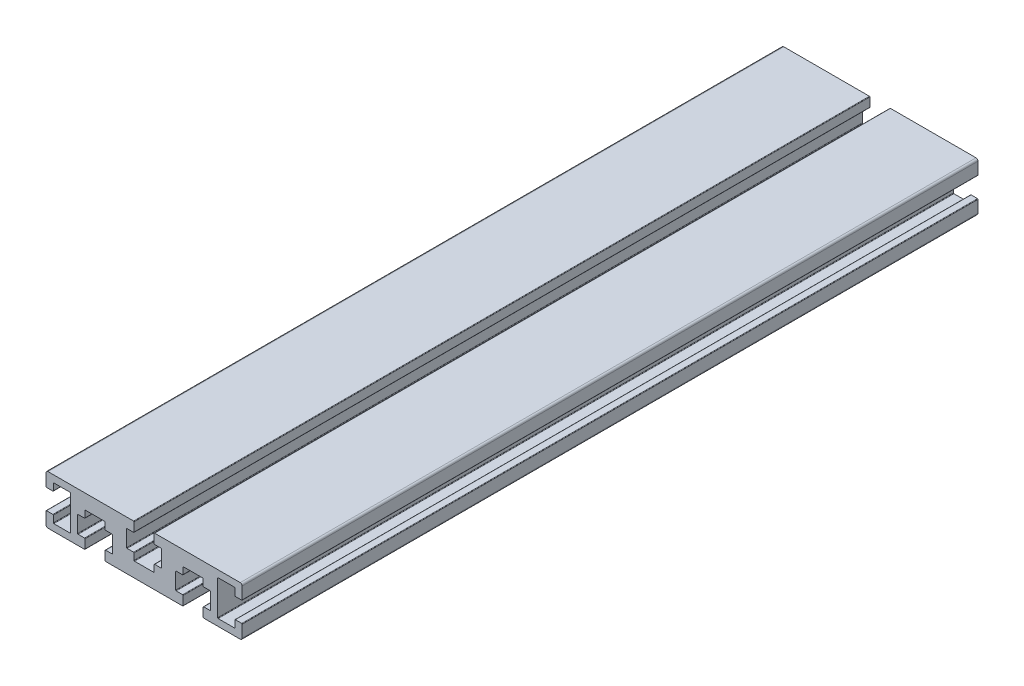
ISO-10303-21;
HEADER;
FILE_DESCRIPTION(('STEP AP214'),'2;1');
FILE_NAME('part.step','',(''),(''),'','','');
FILE_SCHEMA(('AUTOMOTIVE_DESIGN { 1 0 10303 214 1 1 1 1 }'));
ENDSEC;
DATA;
#1=APPLICATION_CONTEXT('core data for automotive mechanical design processes');
#2=APPLICATION_PROTOCOL_DEFINITION('international standard','automotive_design',2000,#1);
#3=PRODUCT_CONTEXT('',#1,'mechanical');
#4=PRODUCT('Part','Part','',(#3));
#5=PRODUCT_RELATED_PRODUCT_CATEGORY('part','',(#4));
#6=PRODUCT_DEFINITION_FORMATION('','',#4);
#7=PRODUCT_DEFINITION_CONTEXT('part definition',#1,'design');
#8=PRODUCT_DEFINITION('design','',#6,#7);
#9=PRODUCT_DEFINITION_SHAPE('','',#8);
#10=(LENGTH_UNIT() NAMED_UNIT(*) SI_UNIT(.MILLI.,.METRE.));
#11=(NAMED_UNIT(*) PLANE_ANGLE_UNIT() SI_UNIT($,.RADIAN.));
#12=(NAMED_UNIT(*) SI_UNIT($,.STERADIAN.) SOLID_ANGLE_UNIT());
#13=UNCERTAINTY_MEASURE_WITH_UNIT(LENGTH_MEASURE(1.E-05),#10,'distance_accuracy_value','');
#14=(GEOMETRIC_REPRESENTATION_CONTEXT(3) GLOBAL_UNCERTAINTY_ASSIGNED_CONTEXT((#13)) GLOBAL_UNIT_ASSIGNED_CONTEXT((#10,
#11,#12)) REPRESENTATION_CONTEXT('',''));
#15=CARTESIAN_POINT('',(0.,0.,0.));
#16=DIRECTION('',(0.,0.,1.));
#17=DIRECTION('',(1.,0.,0.));
#18=AXIS2_PLACEMENT_3D('',#15,#16,#17);
#19=CARTESIAN_POINT('',(39.2000000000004,9.19999999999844,150.));
#20=DIRECTION('',(0.,0.,-1.));
#21=DIRECTION('',(-1.,0.,0.));
#22=AXIS2_PLACEMENT_3D('',#19,#20,#21);
#23=CYLINDRICAL_SURFACE('',#22,0.800000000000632);
#24=CARTESIAN_POINT('',(39.2000000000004,9.19999999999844,-150.));
#25=DIRECTION('',(0.,0.,1.));
#26=DIRECTION('',(1.,0.,0.));
#27=AXIS2_PLACEMENT_3D('',#24,#25,#26);
#28=CIRCLE('',#27,0.800000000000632);
#29=CARTESIAN_POINT('',(40.000000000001,9.19999999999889,-150.));
#30=VERTEX_POINT('',#29);
#31=CARTESIAN_POINT('',(39.2000000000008,9.99999999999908,-150.));
#32=VERTEX_POINT('',#31);
#33=EDGE_CURVE('E755',#30,#32,#28,.T.);
#34=ORIENTED_EDGE('',*,*,#33,.T.);
#35=DIRECTION('',(0.,0.,-1.));
#36=VECTOR('',#35,1.);
#37=CARTESIAN_POINT('',(39.2000000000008,9.99999999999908,150.));
#38=LINE('',#37,#36);
#39=CARTESIAN_POINT('',(39.2000000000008,9.99999999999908,150.));
#40=VERTEX_POINT('',#39);
#41=EDGE_CURVE('E11',#40,#32,#38,.T.);
#42=ORIENTED_EDGE('',*,*,#41,.F.);
#43=CARTESIAN_POINT('',(39.2000000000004,9.19999999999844,150.));
#44=DIRECTION('',(0.,0.,1.));
#45=DIRECTION('',(1.,0.,0.));
#46=AXIS2_PLACEMENT_3D('',#43,#44,#45);
#47=CIRCLE('',#46,0.800000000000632);
#48=CARTESIAN_POINT('',(40.000000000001,9.19999999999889,150.));
#49=VERTEX_POINT('',#48);
#50=EDGE_CURVE('E977',#49,#40,#47,.T.);
#51=ORIENTED_EDGE('',*,*,#50,.F.);
#52=DIRECTION('',(0.,0.,-1.));
#53=VECTOR('',#52,1.);
#54=CARTESIAN_POINT('',(40.000000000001,9.19999999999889,150.));
#55=LINE('',#54,#53);
#56=EDGE_CURVE('E751',#49,#30,#55,.T.);
#57=ORIENTED_EDGE('',*,*,#56,.T.);
#58=EDGE_LOOP('',(#34,#42,#51,#57));
#59=FACE_BOUND('',#58,.T.);
#60=ADVANCED_FACE('F35',(#59),#23,.T.);
#61=CARTESIAN_POINT('',(39.2000000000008,9.99999999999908,150.));
#62=DIRECTION('',(0.,-1.,0.));
#63=DIRECTION('',(0.,0.,-1.));
#64=AXIS2_PLACEMENT_3D('',#61,#62,#63);
#65=PLANE('',#64);
#66=DIRECTION('',(-1.,0.,0.));
#67=VECTOR('',#66,1.);
#68=CARTESIAN_POINT('',(39.2000000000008,9.99999999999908,-150.));
#69=LINE('',#68,#67);
#70=CARTESIAN_POINT('',(4.30000000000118,9.99999999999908,-150.));
#71=VERTEX_POINT('',#70);
#72=EDGE_CURVE('E758',#32,#71,#69,.T.);
#73=ORIENTED_EDGE('',*,*,#72,.T.);
#74=DIRECTION('',(0.,0.,-1.));
#75=VECTOR('',#74,1.);
#76=CARTESIAN_POINT('',(4.30000000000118,9.99999999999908,150.));
#77=LINE('',#76,#75);
#78=CARTESIAN_POINT('',(4.30000000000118,9.99999999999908,150.));
#79=VERTEX_POINT('',#78);
#80=EDGE_CURVE('E43',#79,#71,#77,.T.);
#81=ORIENTED_EDGE('',*,*,#80,.F.);
#82=DIRECTION('',(-1.,0.,0.));
#83=VECTOR('',#82,1.);
#84=CARTESIAN_POINT('',(39.2000000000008,9.99999999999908,150.));
#85=LINE('',#84,#83);
#86=EDGE_CURVE('E406',#40,#79,#85,.T.);
#87=ORIENTED_EDGE('',*,*,#86,.F.);
#88=ORIENTED_EDGE('',*,*,#41,.T.);
#89=EDGE_LOOP('',(#73,#81,#87,#88));
#90=FACE_BOUND('',#89,.T.);
#91=ADVANCED_FACE('F1555',(#90),#65,.F.);
#92=CARTESIAN_POINT('',(4.30000000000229,9.79999999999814,150.));
#93=DIRECTION('',(0.,0.,-1.));
#94=DIRECTION('',(-1.,0.,0.));
#95=AXIS2_PLACEMENT_3D('',#92,#93,#94);
#96=CYLINDRICAL_SURFACE('',#95,0.200000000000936);
#97=CARTESIAN_POINT('',(4.30000000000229,9.79999999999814,-150.));
#98=DIRECTION('',(0.,0.,1.));
#99=DIRECTION('',(1.,0.,0.));
#100=AXIS2_PLACEMENT_3D('',#97,#98,#99);
#101=CIRCLE('',#100,0.200000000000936);
#102=CARTESIAN_POINT('',(4.10000000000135,9.79999999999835,-150.));
#103=VERTEX_POINT('',#102);
#104=EDGE_CURVE('E760',#71,#103,#101,.T.);
#105=ORIENTED_EDGE('',*,*,#104,.T.);
#106=DIRECTION('',(0.,0.,-1.));
#107=VECTOR('',#106,1.);
#108=CARTESIAN_POINT('',(4.10000000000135,9.79999999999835,150.));
#109=LINE('',#108,#107);
#110=CARTESIAN_POINT('',(4.10000000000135,9.79999999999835,150.));
#111=VERTEX_POINT('',#110);
#112=EDGE_CURVE('E1296',#111,#103,#109,.T.);
#113=ORIENTED_EDGE('',*,*,#112,.F.);
#114=CARTESIAN_POINT('',(4.30000000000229,9.79999999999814,150.));
#115=DIRECTION('',(0.,0.,1.));
#116=DIRECTION('',(1.,0.,0.));
#117=AXIS2_PLACEMENT_3D('',#114,#115,#116);
#118=CIRCLE('',#117,0.200000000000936);
#119=EDGE_CURVE('E1304',#79,#111,#118,.T.);
#120=ORIENTED_EDGE('',*,*,#119,.F.);
#121=ORIENTED_EDGE('',*,*,#80,.T.);
#122=EDGE_LOOP('',(#105,#113,#120,#121));
#123=FACE_BOUND('',#122,.T.);
#124=ADVANCED_FACE('F1302',(#123),#96,.T.);
#125=CARTESIAN_POINT('',(4.10000000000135,9.79999999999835,150.));
#126=DIRECTION('',(1.,0.,0.));
#127=DIRECTION('',(0.,0.,-1.));
#128=AXIS2_PLACEMENT_3D('',#125,#126,#127);
#129=PLANE('',#128);
#130=DIRECTION('',(0.,-1.,0.));
#131=VECTOR('',#130,1.);
#132=CARTESIAN_POINT('',(4.10000000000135,9.79999999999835,-150.));
#133=LINE('',#132,#131);
#134=CARTESIAN_POINT('',(4.10000000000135,6.19999999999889,-150.));
#135=VERTEX_POINT('',#134);
#136=EDGE_CURVE('E762',#103,#135,#133,.T.);
#137=ORIENTED_EDGE('',*,*,#136,.T.);
#138=DIRECTION('',(0.,0.,-1.));
#139=VECTOR('',#138,1.);
#140=CARTESIAN_POINT('',(4.10000000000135,6.19999999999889,150.));
#141=LINE('',#140,#139);
#142=CARTESIAN_POINT('',(4.10000000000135,6.19999999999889,150.));
#143=VERTEX_POINT('',#142);
#144=EDGE_CURVE('E1293',#143,#135,#141,.T.);
#145=ORIENTED_EDGE('',*,*,#144,.F.);
#146=DIRECTION('',(0.,-1.,0.));
#147=VECTOR('',#146,1.);
#148=CARTESIAN_POINT('',(4.10000000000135,9.79999999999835,150.));
#149=LINE('',#148,#147);
#150=EDGE_CURVE('E1322',#111,#143,#149,.T.);
#151=ORIENTED_EDGE('',*,*,#150,.F.);
#152=ORIENTED_EDGE('',*,*,#112,.T.);
#153=EDGE_LOOP('',(#137,#145,#151,#152));
#154=FACE_BOUND('',#153,.T.);
#155=ADVANCED_FACE('F1313',(#154),#129,.F.);
#156=CARTESIAN_POINT('',(4.30000000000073,6.19999999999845,150.));
#157=DIRECTION('',(0.,0.,-1.));
#158=DIRECTION('',(-1.,0.,0.));
#159=AXIS2_PLACEMENT_3D('',#156,#157,#158);
#160=CYLINDRICAL_SURFACE('',#159,0.199999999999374);
#161=CARTESIAN_POINT('',(4.30000000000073,6.19999999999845,-150.));
#162=DIRECTION('',(0.,0.,1.));
#163=DIRECTION('',(1.,0.,0.));
#164=AXIS2_PLACEMENT_3D('',#161,#162,#163);
#165=CIRCLE('',#164,0.199999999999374);
#166=CARTESIAN_POINT('',(4.30000000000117,5.99999999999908,-150.));
#167=VERTEX_POINT('',#166);
#168=EDGE_CURVE('E764',#135,#167,#165,.T.);
#169=ORIENTED_EDGE('',*,*,#168,.T.);
#170=DIRECTION('',(0.,0.,-1.));
#171=VECTOR('',#170,1.);
#172=CARTESIAN_POINT('',(4.30000000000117,5.99999999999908,150.));
#173=LINE('',#172,#171);
#174=CARTESIAN_POINT('',(4.30000000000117,5.99999999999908,150.));
#175=VERTEX_POINT('',#174);
#176=EDGE_CURVE('E1290',#175,#167,#173,.T.);
#177=ORIENTED_EDGE('',*,*,#176,.F.);
#178=CARTESIAN_POINT('',(4.30000000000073,6.19999999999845,150.));
#179=DIRECTION('',(0.,0.,1.));
#180=DIRECTION('',(1.,0.,0.));
#181=AXIS2_PLACEMENT_3D('',#178,#179,#180);
#182=CIRCLE('',#181,0.199999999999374);
#183=EDGE_CURVE('E1319',#143,#175,#182,.T.);
#184=ORIENTED_EDGE('',*,*,#183,.F.);
#185=ORIENTED_EDGE('',*,*,#144,.T.);
#186=EDGE_LOOP('',(#169,#177,#184,#185));
#187=FACE_BOUND('',#186,.T.);
#188=ADVANCED_FACE('F1317',(#187),#160,.T.);
#189=CARTESIAN_POINT('',(4.30000000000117,5.99999999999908,150.));
#190=DIRECTION('',(0.,1.,0.));
#191=DIRECTION('',(0.,0.,1.));
#192=AXIS2_PLACEMENT_3D('',#189,#190,#191);
#193=PLANE('',#192);
#194=DIRECTION('',(1.,0.,0.));
#195=VECTOR('',#194,1.);
#196=CARTESIAN_POINT('',(4.30000000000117,5.99999999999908,-150.));
#197=LINE('',#196,#195);
#198=CARTESIAN_POINT('',(6.90000000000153,5.99999999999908,-150.));
#199=VERTEX_POINT('',#198);
#200=EDGE_CURVE('E766',#167,#199,#197,.T.);
#201=ORIENTED_EDGE('',*,*,#200,.T.);
#202=DIRECTION('',(0.,0.,-1.));
#203=VECTOR('',#202,1.);
#204=CARTESIAN_POINT('',(6.90000000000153,5.99999999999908,150.));
#205=LINE('',#204,#203);
#206=CARTESIAN_POINT('',(6.90000000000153,5.99999999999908,150.));
#207=VERTEX_POINT('',#206);
#208=EDGE_CURVE('E1287',#207,#199,#205,.T.);
#209=ORIENTED_EDGE('',*,*,#208,.F.);
#210=DIRECTION('',(1.,0.,0.));
#211=VECTOR('',#210,1.);
#212=CARTESIAN_POINT('',(4.30000000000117,5.99999999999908,150.));
#213=LINE('',#212,#211);
#214=EDGE_CURVE('E1321',#175,#207,#213,.T.);
#215=ORIENTED_EDGE('',*,*,#214,.F.);
#216=ORIENTED_EDGE('',*,*,#176,.T.);
#217=EDGE_LOOP('',(#201,#209,#215,#216));
#218=FACE_BOUND('',#217,.T.);
#219=ADVANCED_FACE('F1568',(#218),#193,.F.);
#220=CARTESIAN_POINT('',(6.90000000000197,5.7999999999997,150.));
#221=DIRECTION('',(0.,0.,-1.));
#222=DIRECTION('',(-1.,0.,0.));
#223=AXIS2_PLACEMENT_3D('',#220,#221,#222);
#224=CYLINDRICAL_SURFACE('',#223,0.19999999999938);
#225=CARTESIAN_POINT('',(6.90000000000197,5.7999999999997,-150.));
#226=DIRECTION('',(0.,0.,-1.));
#227=DIRECTION('',(1.,0.,0.));
#228=AXIS2_PLACEMENT_3D('',#225,#226,#227);
#229=CIRCLE('',#228,0.19999999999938);
#230=CARTESIAN_POINT('',(7.10000000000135,5.79999999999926,-150.));
#231=VERTEX_POINT('',#230);
#232=EDGE_CURVE('E768',#199,#231,#229,.T.);
#233=ORIENTED_EDGE('',*,*,#232,.T.);
#234=DIRECTION('',(0.,0.,-1.));
#235=VECTOR('',#234,1.);
#236=CARTESIAN_POINT('',(7.10000000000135,5.79999999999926,150.));
#237=LINE('',#236,#235);
#238=CARTESIAN_POINT('',(7.10000000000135,5.79999999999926,150.));
#239=VERTEX_POINT('',#238);
#240=EDGE_CURVE('E1284',#239,#231,#237,.T.);
#241=ORIENTED_EDGE('',*,*,#240,.F.);
#242=CARTESIAN_POINT('',(6.90000000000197,5.7999999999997,150.));
#243=DIRECTION('',(0.,0.,-1.));
#244=DIRECTION('',(1.,0.,0.));
#245=AXIS2_PLACEMENT_3D('',#242,#243,#244);
#246=CIRCLE('',#245,0.19999999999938);
#247=EDGE_CURVE('E1324',#207,#239,#246,.T.);
#248=ORIENTED_EDGE('',*,*,#247,.F.);
#249=ORIENTED_EDGE('',*,*,#208,.T.);
#250=EDGE_LOOP('',(#233,#241,#248,#249));
#251=FACE_BOUND('',#250,.T.);
#252=ADVANCED_FACE('F1571',(#251),#224,.F.);
#253=CARTESIAN_POINT('',(7.10000000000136,5.79999999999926,150.));
#254=DIRECTION('',(1.,0.,0.));
#255=DIRECTION('',(0.,0.,-1.));
#256=AXIS2_PLACEMENT_3D('',#253,#254,#255);
#257=PLANE('',#256);
#258=DIRECTION('',(0.,-1.,0.));
#259=VECTOR('',#258,1.);
#260=CARTESIAN_POINT('',(7.10000000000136,5.79999999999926,-150.));
#261=LINE('',#260,#259);
#262=CARTESIAN_POINT('',(7.10000000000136,-0.800000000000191,-150.));
#263=VERTEX_POINT('',#262);
#264=EDGE_CURVE('E770',#231,#263,#261,.T.);
#265=ORIENTED_EDGE('',*,*,#264,.T.);
#266=DIRECTION('',(0.,0.,-1.));
#267=VECTOR('',#266,1.);
#268=CARTESIAN_POINT('',(7.10000000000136,-0.800000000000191,150.));
#269=LINE('',#268,#267);
#270=CARTESIAN_POINT('',(7.10000000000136,-0.800000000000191,150.));
#271=VERTEX_POINT('',#270);
#272=EDGE_CURVE('E1281',#271,#263,#269,.T.);
#273=ORIENTED_EDGE('',*,*,#272,.F.);
#274=DIRECTION('',(0.,-1.,0.));
#275=VECTOR('',#274,1.);
#276=CARTESIAN_POINT('',(7.10000000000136,5.79999999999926,150.));
#277=LINE('',#276,#275);
#278=EDGE_CURVE('E1330',#239,#271,#277,.T.);
#279=ORIENTED_EDGE('',*,*,#278,.F.);
#280=ORIENTED_EDGE('',*,*,#240,.T.);
#281=EDGE_LOOP('',(#265,#273,#279,#280));
#282=FACE_BOUND('',#281,.T.);
#283=ADVANCED_FACE('F1575',(#282),#257,.F.);
#284=CARTESIAN_POINT('',(6.90000000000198,-0.80000000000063,150.));
#285=DIRECTION('',(0.,0.,-1.));
#286=DIRECTION('',(-1.,0.,0.));
#287=AXIS2_PLACEMENT_3D('',#284,#285,#286);
#288=CYLINDRICAL_SURFACE('',#287,0.199999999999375);
#289=CARTESIAN_POINT('',(6.90000000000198,-0.80000000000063,-150.));
#290=DIRECTION('',(0.,0.,-1.));
#291=DIRECTION('',(1.,0.,0.));
#292=AXIS2_PLACEMENT_3D('',#289,#290,#291);
#293=CIRCLE('',#292,0.199999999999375);
#294=CARTESIAN_POINT('',(6.90000000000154,-1.00000000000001,-150.));
#295=VERTEX_POINT('',#294);
#296=EDGE_CURVE('E772',#263,#295,#293,.T.);
#297=ORIENTED_EDGE('',*,*,#296,.T.);
#298=DIRECTION('',(0.,0.,-1.));
#299=VECTOR('',#298,1.);
#300=CARTESIAN_POINT('',(6.90000000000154,-1.00000000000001,150.));
#301=LINE('',#300,#299);
#302=CARTESIAN_POINT('',(6.90000000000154,-1.00000000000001,150.));
#303=VERTEX_POINT('',#302);
#304=EDGE_CURVE('E1278',#303,#295,#301,.T.);
#305=ORIENTED_EDGE('',*,*,#304,.F.);
#306=CARTESIAN_POINT('',(6.90000000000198,-0.80000000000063,150.));
#307=DIRECTION('',(0.,0.,-1.));
#308=DIRECTION('',(1.,0.,0.));
#309=AXIS2_PLACEMENT_3D('',#306,#307,#308);
#310=CIRCLE('',#309,0.199999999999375);
#311=EDGE_CURVE('E1332',#271,#303,#310,.T.);
#312=ORIENTED_EDGE('',*,*,#311,.F.);
#313=ORIENTED_EDGE('',*,*,#272,.T.);
#314=EDGE_LOOP('',(#297,#305,#312,#313));
#315=FACE_BOUND('',#314,.T.);
#316=ADVANCED_FACE('F1579',(#315),#288,.F.);
#317=CARTESIAN_POINT('',(6.90000000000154,-1.00000000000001,150.));
#318=DIRECTION('',(0.,-1.,0.));
#319=DIRECTION('',(0.,0.,-1.));
#320=AXIS2_PLACEMENT_3D('',#317,#318,#319);
#321=PLANE('',#320);
#322=DIRECTION('',(-1.,0.,0.));
#323=VECTOR('',#322,1.);
#324=CARTESIAN_POINT('',(6.90000000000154,-1.00000000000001,-150.));
#325=LINE('',#324,#323);
#326=CARTESIAN_POINT('',(4.30000000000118,-1.00000000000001,-150.));
#327=VERTEX_POINT('',#326);
#328=EDGE_CURVE('E774',#295,#327,#325,.T.);
#329=ORIENTED_EDGE('',*,*,#328,.T.);
#330=DIRECTION('',(0.,0.,-1.));
#331=VECTOR('',#330,1.);
#332=CARTESIAN_POINT('',(4.30000000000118,-1.00000000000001,150.));
#333=LINE('',#332,#331);
#334=CARTESIAN_POINT('',(4.30000000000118,-1.00000000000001,150.));
#335=VERTEX_POINT('',#334);
#336=EDGE_CURVE('E1275',#335,#327,#333,.T.);
#337=ORIENTED_EDGE('',*,*,#336,.F.);
#338=DIRECTION('',(-1.,0.,0.));
#339=VECTOR('',#338,1.);
#340=CARTESIAN_POINT('',(6.90000000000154,-1.00000000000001,150.));
#341=LINE('',#340,#339);
#342=EDGE_CURVE('E1334',#303,#335,#341,.T.);
#343=ORIENTED_EDGE('',*,*,#342,.F.);
#344=ORIENTED_EDGE('',*,*,#304,.T.);
#345=EDGE_LOOP('',(#329,#337,#343,#344));
#346=FACE_BOUND('',#345,.T.);
#347=ADVANCED_FACE('F1583',(#346),#321,.F.);
#348=CARTESIAN_POINT('',(4.30000000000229,-1.20000000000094,150.));
#349=DIRECTION('',(0.,0.,-1.));
#350=DIRECTION('',(-1.,0.,0.));
#351=AXIS2_PLACEMENT_3D('',#348,#349,#350);
#352=CYLINDRICAL_SURFACE('',#351,0.200000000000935);
#353=CARTESIAN_POINT('',(4.30000000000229,-1.20000000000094,-150.));
#354=DIRECTION('',(0.,0.,1.));
#355=DIRECTION('',(1.,0.,0.));
#356=AXIS2_PLACEMENT_3D('',#353,#354,#355);
#357=CIRCLE('',#356,0.200000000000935);
#358=CARTESIAN_POINT('',(4.10000000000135,-1.20000000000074,-150.));
#359=VERTEX_POINT('',#358);
#360=EDGE_CURVE('E776',#327,#359,#357,.T.);
#361=ORIENTED_EDGE('',*,*,#360,.T.);
#362=DIRECTION('',(0.,0.,-1.));
#363=VECTOR('',#362,1.);
#364=CARTESIAN_POINT('',(4.10000000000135,-1.20000000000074,150.));
#365=LINE('',#364,#363);
#366=CARTESIAN_POINT('',(4.10000000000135,-1.20000000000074,150.));
#367=VERTEX_POINT('',#366);
#368=EDGE_CURVE('E1272',#367,#359,#365,.T.);
#369=ORIENTED_EDGE('',*,*,#368,.F.);
#370=CARTESIAN_POINT('',(4.30000000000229,-1.20000000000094,150.));
#371=DIRECTION('',(0.,0.,1.));
#372=DIRECTION('',(1.,0.,0.));
#373=AXIS2_PLACEMENT_3D('',#370,#371,#372);
#374=CIRCLE('',#373,0.200000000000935);
#375=EDGE_CURVE('E1336',#335,#367,#374,.T.);
#376=ORIENTED_EDGE('',*,*,#375,.F.);
#377=ORIENTED_EDGE('',*,*,#336,.T.);
#378=EDGE_LOOP('',(#361,#369,#376,#377));
#379=FACE_BOUND('',#378,.T.);
#380=ADVANCED_FACE('F1587',(#379),#352,.T.);
#381=CARTESIAN_POINT('',(4.10000000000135,-1.20000000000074,150.));
#382=DIRECTION('',(1.,0.,0.));
#383=DIRECTION('',(0.,0.,-1.));
#384=AXIS2_PLACEMENT_3D('',#381,#382,#383);
#385=PLANE('',#384);
#386=DIRECTION('',(0.,-1.,0.));
#387=VECTOR('',#386,1.);
#388=CARTESIAN_POINT('',(4.10000000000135,-1.20000000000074,-150.));
#389=LINE('',#388,#387);
#390=CARTESIAN_POINT('',(4.10000000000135,-3.8000000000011,-150.));
#391=VERTEX_POINT('',#390);
#392=EDGE_CURVE('E778',#359,#391,#389,.T.);
#393=ORIENTED_EDGE('',*,*,#392,.T.);
#394=DIRECTION('',(0.,0.,-1.));
#395=VECTOR('',#394,1.);
#396=CARTESIAN_POINT('',(4.10000000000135,-3.8000000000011,150.));
#397=LINE('',#396,#395);
#398=CARTESIAN_POINT('',(4.10000000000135,-3.8000000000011,150.));
#399=VERTEX_POINT('',#398);
#400=EDGE_CURVE('E1269',#399,#391,#397,.T.);
#401=ORIENTED_EDGE('',*,*,#400,.F.);
#402=DIRECTION('',(0.,-1.,0.));
#403=VECTOR('',#402,1.);
#404=CARTESIAN_POINT('',(4.10000000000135,-1.20000000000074,150.));
#405=LINE('',#404,#403);
#406=EDGE_CURVE('E1338',#367,#399,#405,.T.);
#407=ORIENTED_EDGE('',*,*,#406,.F.);
#408=ORIENTED_EDGE('',*,*,#368,.T.);
#409=EDGE_LOOP('',(#393,#401,#407,#408));
#410=FACE_BOUND('',#409,.T.);
#411=ADVANCED_FACE('F1591',(#410),#385,.F.);
#412=CARTESIAN_POINT('',(3.90000000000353,-3.80000000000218,150.));
#413=DIRECTION('',(0.,0.,-1.));
#414=DIRECTION('',(-1.,0.,0.));
#415=AXIS2_PLACEMENT_3D('',#412,#413,#414);
#416=CYLINDRICAL_SURFACE('',#415,0.19999999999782);
#417=CARTESIAN_POINT('',(3.90000000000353,-3.80000000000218,-150.));
#418=DIRECTION('',(0.,0.,-1.));
#419=DIRECTION('',(1.,0.,0.));
#420=AXIS2_PLACEMENT_3D('',#417,#418,#419);
#421=CIRCLE('',#420,0.19999999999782);
#422=CARTESIAN_POINT('',(3.90000000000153,-4.,-150.));
#423=VERTEX_POINT('',#422);
#424=EDGE_CURVE('E780',#391,#423,#421,.T.);
#425=ORIENTED_EDGE('',*,*,#424,.T.);
#426=DIRECTION('',(0.,0.,-1.));
#427=VECTOR('',#426,1.);
#428=CARTESIAN_POINT('',(3.90000000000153,-4.,150.));
#429=LINE('',#428,#427);
#430=CARTESIAN_POINT('',(3.90000000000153,-4.,150.));
#431=VERTEX_POINT('',#430);
#432=EDGE_CURVE('E1266',#431,#423,#429,.T.);
#433=ORIENTED_EDGE('',*,*,#432,.F.);
#434=CARTESIAN_POINT('',(3.90000000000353,-3.80000000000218,150.));
#435=DIRECTION('',(0.,0.,-1.));
#436=DIRECTION('',(1.,0.,0.));
#437=AXIS2_PLACEMENT_3D('',#434,#435,#436);
#438=CIRCLE('',#437,0.19999999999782);
#439=EDGE_CURVE('E1340',#399,#431,#438,.T.);
#440=ORIENTED_EDGE('',*,*,#439,.F.);
#441=ORIENTED_EDGE('',*,*,#400,.T.);
#442=EDGE_LOOP('',(#425,#433,#440,#441));
#443=FACE_BOUND('',#442,.T.);
#444=ADVANCED_FACE('F1595',(#443),#416,.F.);
#445=CARTESIAN_POINT('',(3.90000000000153,-4.,150.));
#446=DIRECTION('',(0.,-1.,0.));
#447=DIRECTION('',(0.,0.,-1.));
#448=AXIS2_PLACEMENT_3D('',#445,#446,#447);
#449=PLANE('',#448);
#450=DIRECTION('',(-1.,0.,0.));
#451=VECTOR('',#450,1.);
#452=CARTESIAN_POINT('',(3.90000000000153,-4.,-150.));
#453=LINE('',#452,#451);
#454=CARTESIAN_POINT('',(-3.89999999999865,-4.,-150.));
#455=VERTEX_POINT('',#454);
#456=EDGE_CURVE('E782',#423,#455,#453,.T.);
#457=ORIENTED_EDGE('',*,*,#456,.T.);
#458=DIRECTION('',(0.,0.,-1.));
#459=VECTOR('',#458,1.);
#460=CARTESIAN_POINT('',(-3.89999999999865,-4.,150.));
#461=LINE('',#460,#459);
#462=CARTESIAN_POINT('',(-3.89999999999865,-4.,150.));
#463=VERTEX_POINT('',#462);
#464=EDGE_CURVE('E1263',#463,#455,#461,.T.);
#465=ORIENTED_EDGE('',*,*,#464,.F.);
#466=DIRECTION('',(-1.,0.,0.));
#467=VECTOR('',#466,1.);
#468=CARTESIAN_POINT('',(3.90000000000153,-4.,150.));
#469=LINE('',#468,#467);
#470=EDGE_CURVE('E1342',#431,#463,#469,.T.);
#471=ORIENTED_EDGE('',*,*,#470,.F.);
#472=ORIENTED_EDGE('',*,*,#432,.T.);
#473=EDGE_LOOP('',(#457,#465,#471,#472));
#474=FACE_BOUND('',#473,.T.);
#475=ADVANCED_FACE('F1599',(#474),#449,.F.);
#476=CARTESIAN_POINT('',(-3.90000000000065,-3.80000000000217,150.));
#477=DIRECTION('',(0.,0.,-1.));
#478=DIRECTION('',(-1.,0.,0.));
#479=AXIS2_PLACEMENT_3D('',#476,#477,#478);
#480=CYLINDRICAL_SURFACE('',#479,0.199999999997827);
#481=CARTESIAN_POINT('',(-3.90000000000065,-3.80000000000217,-150.));
#482=DIRECTION('',(0.,0.,-1.));
#483=DIRECTION('',(1.,0.,0.));
#484=AXIS2_PLACEMENT_3D('',#481,#482,#483);
#485=CIRCLE('',#484,0.199999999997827);
#486=CARTESIAN_POINT('',(-4.09999999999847,-3.80000000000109,-150.));
#487=VERTEX_POINT('',#486);
#488=EDGE_CURVE('E784',#455,#487,#485,.T.);
#489=ORIENTED_EDGE('',*,*,#488,.T.);
#490=DIRECTION('',(0.,0.,-1.));
#491=VECTOR('',#490,1.);
#492=CARTESIAN_POINT('',(-4.09999999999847,-3.80000000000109,150.));
#493=LINE('',#492,#491);
#494=CARTESIAN_POINT('',(-4.09999999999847,-3.80000000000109,150.));
#495=VERTEX_POINT('',#494);
#496=EDGE_CURVE('E1260',#495,#487,#493,.T.);
#497=ORIENTED_EDGE('',*,*,#496,.F.);
#498=CARTESIAN_POINT('',(-3.90000000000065,-3.80000000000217,150.));
#499=DIRECTION('',(0.,0.,-1.));
#500=DIRECTION('',(1.,0.,0.));
#501=AXIS2_PLACEMENT_3D('',#498,#499,#500);
#502=CIRCLE('',#501,0.199999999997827);
#503=EDGE_CURVE('E1344',#463,#495,#502,.T.);
#504=ORIENTED_EDGE('',*,*,#503,.F.);
#505=ORIENTED_EDGE('',*,*,#464,.T.);
#506=EDGE_LOOP('',(#489,#497,#504,#505));
#507=FACE_BOUND('',#506,.T.);
#508=ADVANCED_FACE('F1603',(#507),#480,.F.);
#509=CARTESIAN_POINT('',(-4.09999999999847,-3.80000000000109,150.));
#510=DIRECTION('',(-1.,0.,0.));
#511=DIRECTION('',(0.,0.,1.));
#512=AXIS2_PLACEMENT_3D('',#509,#510,#511);
#513=PLANE('',#512);
#514=DIRECTION('',(0.,1.,0.));
#515=VECTOR('',#514,1.);
#516=CARTESIAN_POINT('',(-4.09999999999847,-3.80000000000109,-150.));
#517=LINE('',#516,#515);
#518=CARTESIAN_POINT('',(-4.09999999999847,-1.20000000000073,-150.));
#519=VERTEX_POINT('',#518);
#520=EDGE_CURVE('E786',#487,#519,#517,.T.);
#521=ORIENTED_EDGE('',*,*,#520,.T.);
#522=DIRECTION('',(0.,0.,-1.));
#523=VECTOR('',#522,1.);
#524=CARTESIAN_POINT('',(-4.09999999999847,-1.20000000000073,150.));
#525=LINE('',#524,#523);
#526=CARTESIAN_POINT('',(-4.09999999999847,-1.20000000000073,150.));
#527=VERTEX_POINT('',#526);
#528=EDGE_CURVE('E1257',#527,#519,#525,.T.);
#529=ORIENTED_EDGE('',*,*,#528,.F.);
#530=DIRECTION('',(0.,1.,0.));
#531=VECTOR('',#530,1.);
#532=CARTESIAN_POINT('',(-4.09999999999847,-3.80000000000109,150.));
#533=LINE('',#532,#531);
#534=EDGE_CURVE('E1346',#495,#527,#533,.T.);
#535=ORIENTED_EDGE('',*,*,#534,.F.);
#536=ORIENTED_EDGE('',*,*,#496,.T.);
#537=EDGE_LOOP('',(#521,#529,#535,#536));
#538=FACE_BOUND('',#537,.T.);
#539=ADVANCED_FACE('F1607',(#538),#513,.F.);
#540=CARTESIAN_POINT('',(-4.2999999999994,-1.20000000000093,150.));
#541=DIRECTION('',(0.,0.,-1.));
#542=DIRECTION('',(-1.,0.,0.));
#543=AXIS2_PLACEMENT_3D('',#540,#541,#542);
#544=CYLINDRICAL_SURFACE('',#543,0.200000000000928);
#545=CARTESIAN_POINT('',(-4.2999999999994,-1.20000000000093,-150.));
#546=DIRECTION('',(0.,0.,1.));
#547=DIRECTION('',(1.,0.,0.));
#548=AXIS2_PLACEMENT_3D('',#545,#546,#547);
#549=CIRCLE('',#548,0.200000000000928);
#550=CARTESIAN_POINT('',(-4.29999999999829,-1.00000000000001,-150.));
#551=VERTEX_POINT('',#550);
#552=EDGE_CURVE('E788',#519,#551,#549,.T.);
#553=ORIENTED_EDGE('',*,*,#552,.T.);
#554=DIRECTION('',(0.,0.,-1.));
#555=VECTOR('',#554,1.);
#556=CARTESIAN_POINT('',(-4.29999999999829,-1.00000000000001,150.));
#557=LINE('',#556,#555);
#558=CARTESIAN_POINT('',(-4.29999999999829,-1.00000000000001,150.));
#559=VERTEX_POINT('',#558);
#560=EDGE_CURVE('E1254',#559,#551,#557,.T.);
#561=ORIENTED_EDGE('',*,*,#560,.F.);
#562=CARTESIAN_POINT('',(-4.2999999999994,-1.20000000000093,150.));
#563=DIRECTION('',(0.,0.,1.));
#564=DIRECTION('',(1.,0.,0.));
#565=AXIS2_PLACEMENT_3D('',#562,#563,#564);
#566=CIRCLE('',#565,0.200000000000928);
#567=EDGE_CURVE('E1348',#527,#559,#566,.T.);
#568=ORIENTED_EDGE('',*,*,#567,.F.);
#569=ORIENTED_EDGE('',*,*,#528,.T.);
#570=EDGE_LOOP('',(#553,#561,#568,#569));
#571=FACE_BOUND('',#570,.T.);
#572=ADVANCED_FACE('F1611',(#571),#544,.T.);
#573=CARTESIAN_POINT('',(-4.29999999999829,-1.00000000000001,150.));
#574=DIRECTION('',(0.,-1.,0.));
#575=DIRECTION('',(0.,0.,-1.));
#576=AXIS2_PLACEMENT_3D('',#573,#574,#575);
#577=PLANE('',#576);
#578=DIRECTION('',(-1.,0.,0.));
#579=VECTOR('',#578,1.);
#580=CARTESIAN_POINT('',(-4.29999999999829,-1.00000000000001,-150.));
#581=LINE('',#580,#579);
#582=CARTESIAN_POINT('',(-6.89999999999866,-1.00000000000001,-150.));
#583=VERTEX_POINT('',#582);
#584=EDGE_CURVE('E790',#551,#583,#581,.T.);
#585=ORIENTED_EDGE('',*,*,#584,.T.);
#586=DIRECTION('',(0.,0.,-1.));
#587=VECTOR('',#586,1.);
#588=CARTESIAN_POINT('',(-6.89999999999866,-1.00000000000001,150.));
#589=LINE('',#588,#587);
#590=CARTESIAN_POINT('',(-6.89999999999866,-1.00000000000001,150.));
#591=VERTEX_POINT('',#590);
#592=EDGE_CURVE('E1251',#591,#583,#589,.T.);
#593=ORIENTED_EDGE('',*,*,#592,.F.);
#594=DIRECTION('',(-1.,0.,0.));
#595=VECTOR('',#594,1.);
#596=CARTESIAN_POINT('',(-4.29999999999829,-1.00000000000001,150.));
#597=LINE('',#596,#595);
#598=EDGE_CURVE('E1350',#559,#591,#597,.T.);
#599=ORIENTED_EDGE('',*,*,#598,.F.);
#600=ORIENTED_EDGE('',*,*,#560,.T.);
#601=EDGE_LOOP('',(#585,#593,#599,#600));
#602=FACE_BOUND('',#601,.T.);
#603=ADVANCED_FACE('F1615',(#602),#577,.F.);
#604=CARTESIAN_POINT('',(-6.89999999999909,-0.800000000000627,150.));
#605=DIRECTION('',(0.,0.,-1.));
#606=DIRECTION('',(-1.,0.,0.));
#607=AXIS2_PLACEMENT_3D('',#604,#605,#606);
#608=CYLINDRICAL_SURFACE('',#607,0.19999999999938);
#609=CARTESIAN_POINT('',(-6.89999999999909,-0.800000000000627,-150.));
#610=DIRECTION('',(0.,0.,-1.));
#611=DIRECTION('',(1.,0.,0.));
#612=AXIS2_PLACEMENT_3D('',#609,#610,#611);
#613=CIRCLE('',#612,0.19999999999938);
#614=CARTESIAN_POINT('',(-7.09999999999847,-0.800000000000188,-150.));
#615=VERTEX_POINT('',#614);
#616=EDGE_CURVE('E792',#583,#615,#613,.T.);
#617=ORIENTED_EDGE('',*,*,#616,.T.);
#618=DIRECTION('',(0.,0.,-1.));
#619=VECTOR('',#618,1.);
#620=CARTESIAN_POINT('',(-7.09999999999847,-0.800000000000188,150.));
#621=LINE('',#620,#619);
#622=CARTESIAN_POINT('',(-7.09999999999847,-0.800000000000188,150.));
#623=VERTEX_POINT('',#622);
#624=EDGE_CURVE('E1248',#623,#615,#621,.T.);
#625=ORIENTED_EDGE('',*,*,#624,.F.);
#626=CARTESIAN_POINT('',(-6.89999999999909,-0.800000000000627,150.));
#627=DIRECTION('',(0.,0.,-1.));
#628=DIRECTION('',(1.,0.,0.));
#629=AXIS2_PLACEMENT_3D('',#626,#627,#628);
#630=CIRCLE('',#629,0.19999999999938);
#631=EDGE_CURVE('E1352',#591,#623,#630,.T.);
#632=ORIENTED_EDGE('',*,*,#631,.F.);
#633=ORIENTED_EDGE('',*,*,#592,.T.);
#634=EDGE_LOOP('',(#617,#625,#632,#633));
#635=FACE_BOUND('',#634,.T.);
#636=ADVANCED_FACE('F1619',(#635),#608,.F.);
#637=CARTESIAN_POINT('',(-7.09999999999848,-0.800000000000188,150.));
#638=DIRECTION('',(-1.,0.,0.));
#639=DIRECTION('',(0.,0.,1.));
#640=AXIS2_PLACEMENT_3D('',#637,#638,#639);
#641=PLANE('',#640);
#642=DIRECTION('',(0.,1.,0.));
#643=VECTOR('',#642,1.);
#644=CARTESIAN_POINT('',(-7.09999999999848,-0.800000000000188,-150.));
#645=LINE('',#644,#643);
#646=CARTESIAN_POINT('',(-7.09999999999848,5.80000000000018,-150.));
#647=VERTEX_POINT('',#646);
#648=EDGE_CURVE('E794',#615,#647,#645,.T.);
#649=ORIENTED_EDGE('',*,*,#648,.T.);
#650=DIRECTION('',(0.,0.,-1.));
#651=VECTOR('',#650,1.);
#652=CARTESIAN_POINT('',(-7.09999999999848,5.80000000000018,150.));
#653=LINE('',#652,#651);
#654=CARTESIAN_POINT('',(-7.09999999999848,5.80000000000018,150.));
#655=VERTEX_POINT('',#654);
#656=EDGE_CURVE('E1245',#655,#647,#653,.T.);
#657=ORIENTED_EDGE('',*,*,#656,.F.);
#658=DIRECTION('',(0.,1.,0.));
#659=VECTOR('',#658,1.);
#660=CARTESIAN_POINT('',(-7.09999999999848,-0.800000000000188,150.));
#661=LINE('',#660,#659);
#662=EDGE_CURVE('E1354',#623,#655,#661,.T.);
#663=ORIENTED_EDGE('',*,*,#662,.F.);
#664=ORIENTED_EDGE('',*,*,#624,.T.);
#665=EDGE_LOOP('',(#649,#657,#663,#664));
#666=FACE_BOUND('',#665,.T.);
#667=ADVANCED_FACE('F1623',(#666),#641,.F.);
#668=CARTESIAN_POINT('',(-6.89999999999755,5.79999999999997,150.));
#669=DIRECTION('',(0.,0.,-1.));
#670=DIRECTION('',(-1.,0.,0.));
#671=AXIS2_PLACEMENT_3D('',#668,#669,#670);
#672=CYLINDRICAL_SURFACE('',#671,0.200000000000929);
#673=CARTESIAN_POINT('',(-6.89999999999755,5.79999999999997,-150.));
#674=DIRECTION('',(0.,0.,-1.));
#675=DIRECTION('',(1.,0.,0.));
#676=AXIS2_PLACEMENT_3D('',#673,#674,#675);
#677=CIRCLE('',#676,0.200000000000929);
#678=CARTESIAN_POINT('',(-6.89999999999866,6.0000000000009,-150.));
#679=VERTEX_POINT('',#678);
#680=EDGE_CURVE('E796',#647,#679,#677,.T.);
#681=ORIENTED_EDGE('',*,*,#680,.T.);
#682=DIRECTION('',(0.,0.,-1.));
#683=VECTOR('',#682,1.);
#684=CARTESIAN_POINT('',(-6.89999999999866,6.0000000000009,150.));
#685=LINE('',#684,#683);
#686=CARTESIAN_POINT('',(-6.89999999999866,6.0000000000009,150.));
#687=VERTEX_POINT('',#686);
#688=EDGE_CURVE('E1242',#687,#679,#685,.T.);
#689=ORIENTED_EDGE('',*,*,#688,.F.);
#690=CARTESIAN_POINT('',(-6.89999999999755,5.79999999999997,150.));
#691=DIRECTION('',(0.,0.,-1.));
#692=DIRECTION('',(1.,0.,0.));
#693=AXIS2_PLACEMENT_3D('',#690,#691,#692);
#694=CIRCLE('',#693,0.200000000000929);
#695=EDGE_CURVE('E1356',#655,#687,#694,.T.);
#696=ORIENTED_EDGE('',*,*,#695,.F.);
#697=ORIENTED_EDGE('',*,*,#656,.T.);
#698=EDGE_LOOP('',(#681,#689,#696,#697));
#699=FACE_BOUND('',#698,.T.);
#700=ADVANCED_FACE('F1627',(#699),#672,.F.);
#701=CARTESIAN_POINT('',(-6.89999999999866,6.0000000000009,150.));
#702=DIRECTION('',(0.,1.,0.));
#703=DIRECTION('',(0.,0.,1.));
#704=AXIS2_PLACEMENT_3D('',#701,#702,#703);
#705=PLANE('',#704);
#706=DIRECTION('',(1.,0.,0.));
#707=VECTOR('',#706,1.);
#708=CARTESIAN_POINT('',(-6.89999999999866,6.0000000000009,-150.));
#709=LINE('',#708,#707);
#710=CARTESIAN_POINT('',(-4.29999999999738,6.0000000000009,-150.));
#711=VERTEX_POINT('',#710);
#712=EDGE_CURVE('E798',#679,#711,#709,.T.);
#713=ORIENTED_EDGE('',*,*,#712,.T.);
#714=DIRECTION('',(0.,0.,-1.));
#715=VECTOR('',#714,1.);
#716=CARTESIAN_POINT('',(-4.29999999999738,6.0000000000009,150.));
#717=LINE('',#716,#715);
#718=CARTESIAN_POINT('',(-4.29999999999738,6.0000000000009,150.));
#719=VERTEX_POINT('',#718);
#720=EDGE_CURVE('E1239',#719,#711,#717,.T.);
#721=ORIENTED_EDGE('',*,*,#720,.F.);
#722=DIRECTION('',(1.,0.,0.));
#723=VECTOR('',#722,1.);
#724=CARTESIAN_POINT('',(-6.89999999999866,6.0000000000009,150.));
#725=LINE('',#724,#723);
#726=EDGE_CURVE('E1358',#687,#719,#725,.T.);
#727=ORIENTED_EDGE('',*,*,#726,.F.);
#728=ORIENTED_EDGE('',*,*,#688,.T.);
#729=EDGE_LOOP('',(#713,#721,#727,#728));
#730=FACE_BOUND('',#729,.T.);
#731=ADVANCED_FACE('F1631',(#730),#705,.F.);
#732=CARTESIAN_POINT('',(-4.29999999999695,6.20000000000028,150.));
#733=DIRECTION('',(0.,0.,-1.));
#734=DIRECTION('',(-1.,0.,0.));
#735=AXIS2_PLACEMENT_3D('',#732,#733,#734);
#736=CYLINDRICAL_SURFACE('',#735,0.199999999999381);
#737=CARTESIAN_POINT('',(-4.29999999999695,6.20000000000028,-150.));
#738=DIRECTION('',(0.,0.,1.));
#739=DIRECTION('',(1.,0.,0.));
#740=AXIS2_PLACEMENT_3D('',#737,#738,#739);
#741=CIRCLE('',#740,0.199999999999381);
#742=CARTESIAN_POINT('',(-4.09999999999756,6.20000000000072,-150.));
#743=VERTEX_POINT('',#742);
#744=EDGE_CURVE('E800',#711,#743,#741,.T.);
#745=ORIENTED_EDGE('',*,*,#744,.T.);
#746=DIRECTION('',(0.,0.,-1.));
#747=VECTOR('',#746,1.);
#748=CARTESIAN_POINT('',(-4.09999999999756,6.20000000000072,150.));
#749=LINE('',#748,#747);
#750=CARTESIAN_POINT('',(-4.09999999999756,6.20000000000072,150.));
#751=VERTEX_POINT('',#750);
#752=EDGE_CURVE('E1236',#751,#743,#749,.T.);
#753=ORIENTED_EDGE('',*,*,#752,.F.);
#754=CARTESIAN_POINT('',(-4.29999999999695,6.20000000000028,150.));
#755=DIRECTION('',(0.,0.,1.));
#756=DIRECTION('',(1.,0.,0.));
#757=AXIS2_PLACEMENT_3D('',#754,#755,#756);
#758=CIRCLE('',#757,0.199999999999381);
#759=EDGE_CURVE('E1360',#719,#751,#758,.T.);
#760=ORIENTED_EDGE('',*,*,#759,.F.);
#761=ORIENTED_EDGE('',*,*,#720,.T.);
#762=EDGE_LOOP('',(#745,#753,#760,#761));
#763=FACE_BOUND('',#762,.T.);
#764=ADVANCED_FACE('F1635',(#763),#736,.T.);
#765=CARTESIAN_POINT('',(-4.09999999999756,6.20000000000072,150.));
#766=DIRECTION('',(-1.,0.,0.));
#767=DIRECTION('',(0.,0.,1.));
#768=AXIS2_PLACEMENT_3D('',#765,#766,#767);
#769=PLANE('',#768);
#770=DIRECTION('',(0.,1.,0.));
#771=VECTOR('',#770,1.);
#772=CARTESIAN_POINT('',(-4.09999999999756,6.20000000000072,-150.));
#773=LINE('',#772,#771);
#774=CARTESIAN_POINT('',(-4.09999999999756,9.80000000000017,-150.));
#775=VERTEX_POINT('',#774);
#776=EDGE_CURVE('E802',#743,#775,#773,.T.);
#777=ORIENTED_EDGE('',*,*,#776,.T.);
#778=DIRECTION('',(0.,0.,-1.));
#779=VECTOR('',#778,1.);
#780=CARTESIAN_POINT('',(-4.09999999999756,9.80000000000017,150.));
#781=LINE('',#780,#779);
#782=CARTESIAN_POINT('',(-4.09999999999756,9.80000000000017,150.));
#783=VERTEX_POINT('',#782);
#784=EDGE_CURVE('E1233',#783,#775,#781,.T.);
#785=ORIENTED_EDGE('',*,*,#784,.F.);
#786=DIRECTION('',(0.,1.,0.));
#787=VECTOR('',#786,1.);
#788=CARTESIAN_POINT('',(-4.09999999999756,6.20000000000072,150.));
#789=LINE('',#788,#787);
#790=EDGE_CURVE('E1362',#751,#783,#789,.T.);
#791=ORIENTED_EDGE('',*,*,#790,.F.);
#792=ORIENTED_EDGE('',*,*,#752,.T.);
#793=EDGE_LOOP('',(#777,#785,#791,#792));
#794=FACE_BOUND('',#793,.T.);
#795=ADVANCED_FACE('F1639',(#794),#769,.F.);
#796=CARTESIAN_POINT('',(-4.29999999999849,9.79999999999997,150.));
#797=DIRECTION('',(0.,0.,-1.));
#798=DIRECTION('',(-1.,0.,0.));
#799=AXIS2_PLACEMENT_3D('',#796,#797,#798);
#800=CYLINDRICAL_SURFACE('',#799,0.200000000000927);
#801=CARTESIAN_POINT('',(-4.29999999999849,9.79999999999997,-150.));
#802=DIRECTION('',(0.,0.,1.));
#803=DIRECTION('',(1.,0.,0.));
#804=AXIS2_PLACEMENT_3D('',#801,#802,#803);
#805=CIRCLE('',#804,0.200000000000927);
#806=CARTESIAN_POINT('',(-4.29999999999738,10.0000000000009,-150.));
#807=VERTEX_POINT('',#806);
#808=EDGE_CURVE('E804',#775,#807,#805,.T.);
#809=ORIENTED_EDGE('',*,*,#808,.T.);
#810=DIRECTION('',(0.,0.,-1.));
#811=VECTOR('',#810,1.);
#812=CARTESIAN_POINT('',(-4.29999999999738,10.0000000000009,150.));
#813=LINE('',#812,#811);
#814=CARTESIAN_POINT('',(-4.29999999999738,10.0000000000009,150.));
#815=VERTEX_POINT('',#814);
#816=EDGE_CURVE('E1230',#815,#807,#813,.T.);
#817=ORIENTED_EDGE('',*,*,#816,.F.);
#818=CARTESIAN_POINT('',(-4.29999999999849,9.79999999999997,150.));
#819=DIRECTION('',(0.,0.,1.));
#820=DIRECTION('',(1.,0.,0.));
#821=AXIS2_PLACEMENT_3D('',#818,#819,#820);
#822=CIRCLE('',#821,0.200000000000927);
#823=EDGE_CURVE('E1364',#783,#815,#822,.T.);
#824=ORIENTED_EDGE('',*,*,#823,.F.);
#825=ORIENTED_EDGE('',*,*,#784,.T.);
#826=EDGE_LOOP('',(#809,#817,#824,#825));
#827=FACE_BOUND('',#826,.T.);
#828=ADVANCED_FACE('F1643',(#827),#800,.T.);
#829=CARTESIAN_POINT('',(-4.29999999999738,10.0000000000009,150.));
#830=DIRECTION('',(0.,-1.,0.));
#831=DIRECTION('',(0.,0.,-1.));
#832=AXIS2_PLACEMENT_3D('',#829,#830,#831);
#833=PLANE('',#832);
#834=DIRECTION('',(-1.,0.,0.));
#835=VECTOR('',#834,1.);
#836=CARTESIAN_POINT('',(-4.29999999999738,10.0000000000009,-150.));
#837=LINE('',#836,#835);
#838=CARTESIAN_POINT('',(-39.1999999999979,10.0000000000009,-150.));
#839=VERTEX_POINT('',#838);
#840=EDGE_CURVE('E806',#807,#839,#837,.T.);
#841=ORIENTED_EDGE('',*,*,#840,.T.);
#842=DIRECTION('',(0.,0.,-1.));
#843=VECTOR('',#842,1.);
#844=CARTESIAN_POINT('',(-39.1999999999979,10.0000000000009,150.));
#845=LINE('',#844,#843);
#846=CARTESIAN_POINT('',(-39.1999999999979,10.0000000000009,150.));
#847=VERTEX_POINT('',#846);
#848=EDGE_CURVE('E1227',#847,#839,#845,.T.);
#849=ORIENTED_EDGE('',*,*,#848,.F.);
#850=DIRECTION('',(-1.,0.,0.));
#851=VECTOR('',#850,1.);
#852=CARTESIAN_POINT('',(-4.29999999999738,10.0000000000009,150.));
#853=LINE('',#852,#851);
#854=EDGE_CURVE('E1366',#815,#847,#853,.T.);
#855=ORIENTED_EDGE('',*,*,#854,.F.);
#856=ORIENTED_EDGE('',*,*,#816,.T.);
#857=EDGE_LOOP('',(#841,#849,#855,#856));
#858=FACE_BOUND('',#857,.T.);
#859=ADVANCED_FACE('F1647',(#858),#833,.F.);
#860=CARTESIAN_POINT('',(-39.1999999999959,9.19999999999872,150.));
#861=DIRECTION('',(0.,0.,-1.));
#862=DIRECTION('',(-1.,0.,0.));
#863=AXIS2_PLACEMENT_3D('',#860,#861,#862);
#864=CYLINDRICAL_SURFACE('',#863,0.800000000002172);
#865=CARTESIAN_POINT('',(-39.1999999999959,9.19999999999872,-150.));
#866=DIRECTION('',(0.,0.,1.));
#867=DIRECTION('',(1.,0.,0.));
#868=AXIS2_PLACEMENT_3D('',#865,#866,#867);
#869=CIRCLE('',#868,0.800000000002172);
#870=CARTESIAN_POINT('',(-39.9999999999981,9.1999999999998,-150.));
#871=VERTEX_POINT('',#870);
#872=EDGE_CURVE('E808',#839,#871,#869,.T.);
#873=ORIENTED_EDGE('',*,*,#872,.T.);
#874=DIRECTION('',(0.,0.,-1.));
#875=VECTOR('',#874,1.);
#876=CARTESIAN_POINT('',(-39.9999999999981,9.1999999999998,150.));
#877=LINE('',#876,#875);
#878=CARTESIAN_POINT('',(-39.9999999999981,9.1999999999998,150.));
#879=VERTEX_POINT('',#878);
#880=EDGE_CURVE('E1224',#879,#871,#877,.T.);
#881=ORIENTED_EDGE('',*,*,#880,.F.);
#882=CARTESIAN_POINT('',(-39.1999999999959,9.19999999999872,150.));
#883=DIRECTION('',(0.,0.,1.));
#884=DIRECTION('',(1.,0.,0.));
#885=AXIS2_PLACEMENT_3D('',#882,#883,#884);
#886=CIRCLE('',#885,0.800000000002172);
#887=EDGE_CURVE('E1368',#847,#879,#886,.T.);
#888=ORIENTED_EDGE('',*,*,#887,.F.);
#889=ORIENTED_EDGE('',*,*,#848,.T.);
#890=EDGE_LOOP('',(#873,#881,#888,#889));
#891=FACE_BOUND('',#890,.T.);
#892=ADVANCED_FACE('F1651',(#891),#864,.T.);
#893=CARTESIAN_POINT('',(-39.9999999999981,9.1999999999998,150.));
#894=DIRECTION('',(1.,0.,0.));
#895=DIRECTION('',(0.,0.,-1.));
#896=AXIS2_PLACEMENT_3D('',#893,#894,#895);
#897=PLANE('',#896);
#898=DIRECTION('',(0.,-1.,0.));
#899=VECTOR('',#898,1.);
#900=CARTESIAN_POINT('',(-39.9999999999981,9.1999999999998,-150.));
#901=LINE('',#900,#899);
#902=CARTESIAN_POINT('',(-39.9999999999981,4.30000000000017,-150.));
#903=VERTEX_POINT('',#902);
#904=EDGE_CURVE('E810',#871,#903,#901,.T.);
#905=ORIENTED_EDGE('',*,*,#904,.T.);
#906=DIRECTION('',(0.,0.,-1.));
#907=VECTOR('',#906,1.);
#908=CARTESIAN_POINT('',(-39.9999999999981,4.30000000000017,150.));
#909=LINE('',#908,#907);
#910=CARTESIAN_POINT('',(-39.9999999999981,4.30000000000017,150.));
#911=VERTEX_POINT('',#910);
#912=EDGE_CURVE('E1221',#911,#903,#909,.T.);
#913=ORIENTED_EDGE('',*,*,#912,.F.);
#914=DIRECTION('',(0.,-1.,0.));
#915=VECTOR('',#914,1.);
#916=CARTESIAN_POINT('',(-39.9999999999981,9.1999999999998,150.));
#917=LINE('',#916,#915);
#918=EDGE_CURVE('E1370',#879,#911,#917,.T.);
#919=ORIENTED_EDGE('',*,*,#918,.F.);
#920=ORIENTED_EDGE('',*,*,#880,.T.);
#921=EDGE_LOOP('',(#905,#913,#919,#920));
#922=FACE_BOUND('',#921,.T.);
#923=ADVANCED_FACE('F1655',(#922),#897,.F.);
#924=CARTESIAN_POINT('',(-39.7999999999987,4.29999999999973,150.));
#925=DIRECTION('',(0.,0.,-1.));
#926=DIRECTION('',(-1.,0.,0.));
#927=AXIS2_PLACEMENT_3D('',#924,#925,#926);
#928=CYLINDRICAL_SURFACE('',#927,0.19999999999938);
#929=CARTESIAN_POINT('',(-39.7999999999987,4.29999999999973,-150.));
#930=DIRECTION('',(0.,0.,1.));
#931=DIRECTION('',(1.,0.,0.));
#932=AXIS2_PLACEMENT_3D('',#929,#930,#931);
#933=CIRCLE('',#932,0.19999999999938);
#934=CARTESIAN_POINT('',(-39.7999999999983,4.10000000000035,-150.));
#935=VERTEX_POINT('',#934);
#936=EDGE_CURVE('E812',#903,#935,#933,.T.);
#937=ORIENTED_EDGE('',*,*,#936,.T.);
#938=DIRECTION('',(0.,0.,-1.));
#939=VECTOR('',#938,1.);
#940=CARTESIAN_POINT('',(-39.7999999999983,4.10000000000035,150.));
#941=LINE('',#940,#939);
#942=CARTESIAN_POINT('',(-39.7999999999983,4.10000000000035,150.));
#943=VERTEX_POINT('',#942);
#944=EDGE_CURVE('E1218',#943,#935,#941,.T.);
#945=ORIENTED_EDGE('',*,*,#944,.F.);
#946=CARTESIAN_POINT('',(-39.7999999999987,4.29999999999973,150.));
#947=DIRECTION('',(0.,0.,1.));
#948=DIRECTION('',(1.,0.,0.));
#949=AXIS2_PLACEMENT_3D('',#946,#947,#948);
#950=CIRCLE('',#949,0.19999999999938);
#951=EDGE_CURVE('E1372',#911,#943,#950,.T.);
#952=ORIENTED_EDGE('',*,*,#951,.F.);
#953=ORIENTED_EDGE('',*,*,#912,.T.);
#954=EDGE_LOOP('',(#937,#945,#952,#953));
#955=FACE_BOUND('',#954,.T.);
#956=ADVANCED_FACE('F1659',(#955),#928,.T.);
#957=CARTESIAN_POINT('',(-39.7999999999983,4.10000000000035,150.));
#958=DIRECTION('',(0.,1.,0.));
#959=DIRECTION('',(0.,0.,1.));
#960=AXIS2_PLACEMENT_3D('',#957,#958,#959);
#961=PLANE('',#960);
#962=DIRECTION('',(1.,0.,0.));
#963=VECTOR('',#962,1.);
#964=CARTESIAN_POINT('',(-39.7999999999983,4.10000000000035,-150.));
#965=LINE('',#964,#963);
#966=CARTESIAN_POINT('',(-37.1999999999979,4.10000000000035,-150.));
#967=VERTEX_POINT('',#966);
#968=EDGE_CURVE('E814',#935,#967,#965,.T.);
#969=ORIENTED_EDGE('',*,*,#968,.T.);
#970=DIRECTION('',(0.,0.,-1.));
#971=VECTOR('',#970,1.);
#972=CARTESIAN_POINT('',(-37.1999999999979,4.10000000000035,150.));
#973=LINE('',#972,#971);
#974=CARTESIAN_POINT('',(-37.1999999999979,4.10000000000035,150.));
#975=VERTEX_POINT('',#974);
#976=EDGE_CURVE('E1215',#975,#967,#973,.T.);
#977=ORIENTED_EDGE('',*,*,#976,.F.);
#978=DIRECTION('',(1.,0.,0.));
#979=VECTOR('',#978,1.);
#980=CARTESIAN_POINT('',(-39.7999999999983,4.10000000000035,150.));
#981=LINE('',#980,#979);
#982=EDGE_CURVE('E1374',#943,#975,#981,.T.);
#983=ORIENTED_EDGE('',*,*,#982,.F.);
#984=ORIENTED_EDGE('',*,*,#944,.T.);
#985=EDGE_LOOP('',(#969,#977,#983,#984));
#986=FACE_BOUND('',#985,.T.);
#987=ADVANCED_FACE('F1663',(#986),#961,.F.);
#988=CARTESIAN_POINT('',(-37.1999999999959,4.29999999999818,150.));
#989=DIRECTION('',(0.,0.,-1.));
#990=DIRECTION('',(-1.,0.,0.));
#991=AXIS2_PLACEMENT_3D('',#988,#989,#990);
#992=CYLINDRICAL_SURFACE('',#991,0.199999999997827);
#993=CARTESIAN_POINT('',(-37.1999999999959,4.29999999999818,-150.));
#994=DIRECTION('',(0.,0.,1.));
#995=DIRECTION('',(1.,0.,0.));
#996=AXIS2_PLACEMENT_3D('',#993,#994,#995);
#997=CIRCLE('',#996,0.199999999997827);
#998=CARTESIAN_POINT('',(-36.9999999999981,4.29999999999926,-150.));
#999=VERTEX_POINT('',#998);
#1000=EDGE_CURVE('E816',#967,#999,#997,.T.);
#1001=ORIENTED_EDGE('',*,*,#1000,.T.);
#1002=DIRECTION('',(0.,0.,-1.));
#1003=VECTOR('',#1002,1.);
#1004=CARTESIAN_POINT('',(-36.9999999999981,4.29999999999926,150.));
#1005=LINE('',#1004,#1003);
#1006=CARTESIAN_POINT('',(-36.9999999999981,4.29999999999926,150.));
#1007=VERTEX_POINT('',#1006);
#1008=EDGE_CURVE('E1212',#1007,#999,#1005,.T.);
#1009=ORIENTED_EDGE('',*,*,#1008,.F.);
#1010=CARTESIAN_POINT('',(-37.1999999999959,4.29999999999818,150.));
#1011=DIRECTION('',(0.,0.,1.));
#1012=DIRECTION('',(1.,0.,0.));
#1013=AXIS2_PLACEMENT_3D('',#1010,#1011,#1012);
#1014=CIRCLE('',#1013,0.199999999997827);
#1015=EDGE_CURVE('E1376',#975,#1007,#1014,.T.);
#1016=ORIENTED_EDGE('',*,*,#1015,.F.);
#1017=ORIENTED_EDGE('',*,*,#976,.T.);
#1018=EDGE_LOOP('',(#1001,#1009,#1016,#1017));
#1019=FACE_BOUND('',#1018,.T.);
#1020=ADVANCED_FACE('F1667',(#1019),#992,.T.);
#1021=CARTESIAN_POINT('',(-36.9999999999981,4.29999999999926,150.));
#1022=DIRECTION('',(-1.,0.,0.));
#1023=DIRECTION('',(0.,0.,1.));
#1024=AXIS2_PLACEMENT_3D('',#1021,#1022,#1023);
#1025=PLANE('',#1024);
#1026=DIRECTION('',(0.,1.,0.));
#1027=VECTOR('',#1026,1.);
#1028=CARTESIAN_POINT('',(-36.9999999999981,4.29999999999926,-150.));
#1029=LINE('',#1028,#1027);
#1030=CARTESIAN_POINT('',(-36.9999999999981,6.99999999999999,-150.));
#1031=VERTEX_POINT('',#1030);
#1032=EDGE_CURVE('E818',#999,#1031,#1029,.T.);
#1033=ORIENTED_EDGE('',*,*,#1032,.T.);
#1034=DIRECTION('',(0.,0.,-1.));
#1035=VECTOR('',#1034,1.);
#1036=CARTESIAN_POINT('',(-36.9999999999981,6.99999999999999,150.));
#1037=LINE('',#1036,#1035);
#1038=CARTESIAN_POINT('',(-36.9999999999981,6.99999999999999,150.));
#1039=VERTEX_POINT('',#1038);
#1040=EDGE_CURVE('E1209',#1039,#1031,#1037,.T.);
#1041=ORIENTED_EDGE('',*,*,#1040,.F.);
#1042=DIRECTION('',(0.,1.,0.));
#1043=VECTOR('',#1042,1.);
#1044=CARTESIAN_POINT('',(-36.9999999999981,4.29999999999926,150.));
#1045=LINE('',#1044,#1043);
#1046=EDGE_CURVE('E1378',#1007,#1039,#1045,.T.);
#1047=ORIENTED_EDGE('',*,*,#1046,.F.);
#1048=ORIENTED_EDGE('',*,*,#1008,.T.);
#1049=EDGE_LOOP('',(#1033,#1041,#1047,#1048));
#1050=FACE_BOUND('',#1049,.T.);
#1051=ADVANCED_FACE('F1671',(#1050),#1025,.F.);
#1052=CARTESIAN_POINT('',(-36.7999999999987,7.00000000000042,150.));
#1053=DIRECTION('',(0.,0.,-1.));
#1054=DIRECTION('',(-1.,0.,0.));
#1055=AXIS2_PLACEMENT_3D('',#1052,#1053,#1054);
#1056=CYLINDRICAL_SURFACE('',#1055,0.199999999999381);
#1057=CARTESIAN_POINT('',(-36.7999999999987,7.00000000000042,-150.));
#1058=DIRECTION('',(0.,0.,-1.));
#1059=DIRECTION('',(1.,0.,0.));
#1060=AXIS2_PLACEMENT_3D('',#1057,#1058,#1059);
#1061=CIRCLE('',#1060,0.199999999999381);
#1062=CARTESIAN_POINT('',(-36.7999999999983,7.1999999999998,-150.));
#1063=VERTEX_POINT('',#1062);
#1064=EDGE_CURVE('E820',#1031,#1063,#1061,.T.);
#1065=ORIENTED_EDGE('',*,*,#1064,.T.);
#1066=DIRECTION('',(0.,0.,-1.));
#1067=VECTOR('',#1066,1.);
#1068=CARTESIAN_POINT('',(-36.7999999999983,7.1999999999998,150.));
#1069=LINE('',#1068,#1067);
#1070=CARTESIAN_POINT('',(-36.7999999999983,7.1999999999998,150.));
#1071=VERTEX_POINT('',#1070);
#1072=EDGE_CURVE('E1206',#1071,#1063,#1069,.T.);
#1073=ORIENTED_EDGE('',*,*,#1072,.F.);
#1074=CARTESIAN_POINT('',(-36.7999999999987,7.00000000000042,150.));
#1075=DIRECTION('',(0.,0.,-1.));
#1076=DIRECTION('',(1.,0.,0.));
#1077=AXIS2_PLACEMENT_3D('',#1074,#1075,#1076);
#1078=CIRCLE('',#1077,0.199999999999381);
#1079=EDGE_CURVE('E1380',#1039,#1071,#1078,.T.);
#1080=ORIENTED_EDGE('',*,*,#1079,.F.);
#1081=ORIENTED_EDGE('',*,*,#1040,.T.);
#1082=EDGE_LOOP('',(#1065,#1073,#1080,#1081));
#1083=FACE_BOUND('',#1082,.T.);
#1084=ADVANCED_FACE('F1675',(#1083),#1056,.F.);
#1085=CARTESIAN_POINT('',(-36.7999999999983,7.1999999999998,150.));
#1086=DIRECTION('',(0.,1.,0.));
#1087=DIRECTION('',(0.,0.,1.));
#1088=AXIS2_PLACEMENT_3D('',#1085,#1086,#1087);
#1089=PLANE('',#1088);
#1090=DIRECTION('',(1.,0.,0.));
#1091=VECTOR('',#1090,1.);
#1092=CARTESIAN_POINT('',(-36.7999999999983,7.1999999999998,-150.));
#1093=LINE('',#1092,#1091);
#1094=CARTESIAN_POINT('',(-30.1999999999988,7.1999999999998,-150.));
#1095=VERTEX_POINT('',#1094);
#1096=EDGE_CURVE('E822',#1063,#1095,#1093,.T.);
#1097=ORIENTED_EDGE('',*,*,#1096,.T.);
#1098=DIRECTION('',(0.,0.,-1.));
#1099=VECTOR('',#1098,1.);
#1100=CARTESIAN_POINT('',(-30.1999999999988,7.1999999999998,150.));
#1101=LINE('',#1100,#1099);
#1102=CARTESIAN_POINT('',(-30.1999999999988,7.1999999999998,150.));
#1103=VERTEX_POINT('',#1102);
#1104=EDGE_CURVE('E1203',#1103,#1095,#1101,.T.);
#1105=ORIENTED_EDGE('',*,*,#1104,.F.);
#1106=DIRECTION('',(1.,0.,0.));
#1107=VECTOR('',#1106,1.);
#1108=CARTESIAN_POINT('',(-36.7999999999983,7.1999999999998,150.));
#1109=LINE('',#1108,#1107);
#1110=EDGE_CURVE('E1382',#1071,#1103,#1109,.T.);
#1111=ORIENTED_EDGE('',*,*,#1110,.F.);
#1112=ORIENTED_EDGE('',*,*,#1072,.T.);
#1113=EDGE_LOOP('',(#1097,#1105,#1111,#1112));
#1114=FACE_BOUND('',#1113,.T.);
#1115=ADVANCED_FACE('F1679',(#1114),#1089,.F.);
#1116=CARTESIAN_POINT('',(-30.1999999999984,7.00000000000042,150.));
#1117=DIRECTION('',(0.,0.,-1.));
#1118=DIRECTION('',(-1.,0.,0.));
#1119=AXIS2_PLACEMENT_3D('',#1116,#1117,#1118);
#1120=CYLINDRICAL_SURFACE('',#1119,0.19999999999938);
#1121=CARTESIAN_POINT('',(-30.1999999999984,7.00000000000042,-150.));
#1122=DIRECTION('',(0.,0.,-1.));
#1123=DIRECTION('',(1.,0.,0.));
#1124=AXIS2_PLACEMENT_3D('',#1121,#1122,#1123);
#1125=CIRCLE('',#1124,0.19999999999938);
#1126=CARTESIAN_POINT('',(-29.999999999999,6.99999999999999,-150.));
#1127=VERTEX_POINT('',#1126);
#1128=EDGE_CURVE('E824',#1095,#1127,#1125,.T.);
#1129=ORIENTED_EDGE('',*,*,#1128,.T.);
#1130=DIRECTION('',(0.,0.,-1.));
#1131=VECTOR('',#1130,1.);
#1132=CARTESIAN_POINT('',(-29.999999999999,6.99999999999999,150.));
#1133=LINE('',#1132,#1131);
#1134=CARTESIAN_POINT('',(-29.999999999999,6.99999999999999,150.));
#1135=VERTEX_POINT('',#1134);
#1136=EDGE_CURVE('E1200',#1135,#1127,#1133,.T.);
#1137=ORIENTED_EDGE('',*,*,#1136,.F.);
#1138=CARTESIAN_POINT('',(-30.1999999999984,7.00000000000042,150.));
#1139=DIRECTION('',(0.,0.,-1.));
#1140=DIRECTION('',(1.,0.,0.));
#1141=AXIS2_PLACEMENT_3D('',#1138,#1139,#1140);
#1142=CIRCLE('',#1141,0.19999999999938);
#1143=EDGE_CURVE('E1384',#1103,#1135,#1142,.T.);
#1144=ORIENTED_EDGE('',*,*,#1143,.F.);
#1145=ORIENTED_EDGE('',*,*,#1104,.T.);
#1146=EDGE_LOOP('',(#1129,#1137,#1144,#1145));
#1147=FACE_BOUND('',#1146,.T.);
#1148=ADVANCED_FACE('F1683',(#1147),#1120,.F.);
#1149=CARTESIAN_POINT('',(-29.999999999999,6.99999999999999,150.));
#1150=DIRECTION('',(1.,0.,0.));
#1151=DIRECTION('',(0.,0.,-1.));
#1152=AXIS2_PLACEMENT_3D('',#1149,#1150,#1151);
#1153=PLANE('',#1152);
#1154=DIRECTION('',(0.,-1.,0.));
#1155=VECTOR('',#1154,1.);
#1156=CARTESIAN_POINT('',(-29.999999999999,6.99999999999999,-150.));
#1157=LINE('',#1156,#1155);
#1158=CARTESIAN_POINT('',(-29.999999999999,-7.00000000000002,-150.));
#1159=VERTEX_POINT('',#1158);
#1160=EDGE_CURVE('E826',#1127,#1159,#1157,.T.);
#1161=ORIENTED_EDGE('',*,*,#1160,.T.);
#1162=DIRECTION('',(0.,0.,-1.));
#1163=VECTOR('',#1162,1.);
#1164=CARTESIAN_POINT('',(-29.999999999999,-7.00000000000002,150.));
#1165=LINE('',#1164,#1163);
#1166=CARTESIAN_POINT('',(-29.999999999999,-7.00000000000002,150.));
#1167=VERTEX_POINT('',#1166);
#1168=EDGE_CURVE('E1197',#1167,#1159,#1165,.T.);
#1169=ORIENTED_EDGE('',*,*,#1168,.F.);
#1170=DIRECTION('',(0.,-1.,0.));
#1171=VECTOR('',#1170,1.);
#1172=CARTESIAN_POINT('',(-29.999999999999,6.99999999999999,150.));
#1173=LINE('',#1172,#1171);
#1174=EDGE_CURVE('E1386',#1135,#1167,#1173,.T.);
#1175=ORIENTED_EDGE('',*,*,#1174,.F.);
#1176=ORIENTED_EDGE('',*,*,#1136,.T.);
#1177=EDGE_LOOP('',(#1161,#1169,#1175,#1176));
#1178=FACE_BOUND('',#1177,.T.);
#1179=ADVANCED_FACE('F1687',(#1178),#1153,.F.);
#1180=CARTESIAN_POINT('',(-30.1999999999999,-6.99999999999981,150.));
#1181=DIRECTION('',(0.,0.,-1.));
#1182=DIRECTION('',(-1.,0.,0.));
#1183=AXIS2_PLACEMENT_3D('',#1180,#1181,#1182);
#1184=CYLINDRICAL_SURFACE('',#1183,0.20000000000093);
#1185=CARTESIAN_POINT('',(-30.1999999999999,-6.99999999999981,-150.));
#1186=DIRECTION('',(0.,0.,-1.));
#1187=DIRECTION('',(1.,0.,0.));
#1188=AXIS2_PLACEMENT_3D('',#1185,#1186,#1187);
#1189=CIRCLE('',#1188,0.20000000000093);
#1190=CARTESIAN_POINT('',(-30.1999999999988,-7.20000000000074,-150.));
#1191=VERTEX_POINT('',#1190);
#1192=EDGE_CURVE('E828',#1159,#1191,#1189,.T.);
#1193=ORIENTED_EDGE('',*,*,#1192,.T.);
#1194=DIRECTION('',(0.,0.,-1.));
#1195=VECTOR('',#1194,1.);
#1196=CARTESIAN_POINT('',(-30.1999999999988,-7.20000000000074,150.));
#1197=LINE('',#1196,#1195);
#1198=CARTESIAN_POINT('',(-30.1999999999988,-7.20000000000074,150.));
#1199=VERTEX_POINT('',#1198);
#1200=EDGE_CURVE('E1194',#1199,#1191,#1197,.T.);
#1201=ORIENTED_EDGE('',*,*,#1200,.F.);
#1202=CARTESIAN_POINT('',(-30.1999999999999,-6.99999999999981,150.));
#1203=DIRECTION('',(0.,0.,-1.));
#1204=DIRECTION('',(1.,0.,0.));
#1205=AXIS2_PLACEMENT_3D('',#1202,#1203,#1204);
#1206=CIRCLE('',#1205,0.20000000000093);
#1207=EDGE_CURVE('E1388',#1167,#1199,#1206,.T.);
#1208=ORIENTED_EDGE('',*,*,#1207,.F.);
#1209=ORIENTED_EDGE('',*,*,#1168,.T.);
#1210=EDGE_LOOP('',(#1193,#1201,#1208,#1209));
#1211=FACE_BOUND('',#1210,.T.);
#1212=ADVANCED_FACE('F1691',(#1211),#1184,.F.);
#1213=CARTESIAN_POINT('',(-30.1999999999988,-7.20000000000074,150.));
#1214=DIRECTION('',(0.,-1.,0.));
#1215=DIRECTION('',(1.,0.,0.));
#1216=AXIS2_PLACEMENT_3D('',#1213,#1214,#1215);
#1217=PLANE('',#1216);
#1218=DIRECTION('',(-1.,0.,0.));
#1219=VECTOR('',#1218,1.);
#1220=CARTESIAN_POINT('',(-30.1999999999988,-7.20000000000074,-150.));
#1221=LINE('',#1220,#1219);
#1222=CARTESIAN_POINT('',(-36.7999999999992,-7.20000000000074,-150.));
#1223=VERTEX_POINT('',#1222);
#1224=EDGE_CURVE('E830',#1191,#1223,#1221,.T.);
#1225=ORIENTED_EDGE('',*,*,#1224,.T.);
#1226=DIRECTION('',(0.,0.,-1.));
#1227=VECTOR('',#1226,1.);
#1228=CARTESIAN_POINT('',(-36.7999999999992,-7.20000000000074,150.));
#1229=LINE('',#1228,#1227);
#1230=CARTESIAN_POINT('',(-36.7999999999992,-7.20000000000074,150.));
#1231=VERTEX_POINT('',#1230);
#1232=EDGE_CURVE('E1191',#1231,#1223,#1229,.T.);
#1233=ORIENTED_EDGE('',*,*,#1232,.F.);
#1234=DIRECTION('',(-1.,0.,0.));
#1235=VECTOR('',#1234,1.);
#1236=CARTESIAN_POINT('',(-30.1999999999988,-7.20000000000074,150.));
#1237=LINE('',#1236,#1235);
#1238=EDGE_CURVE('E1390',#1199,#1231,#1237,.T.);
#1239=ORIENTED_EDGE('',*,*,#1238,.F.);
#1240=ORIENTED_EDGE('',*,*,#1200,.T.);
#1241=EDGE_LOOP('',(#1225,#1233,#1239,#1240));
#1242=FACE_BOUND('',#1241,.T.);
#1243=ADVANCED_FACE('F1695',(#1242),#1217,.F.);
#1244=CARTESIAN_POINT('',(-36.7999999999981,-6.99999999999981,150.));
#1245=DIRECTION('',(0.,0.,-1.));
#1246=DIRECTION('',(-1.,0.,0.));
#1247=AXIS2_PLACEMENT_3D('',#1244,#1245,#1246);
#1248=CYLINDRICAL_SURFACE('',#1247,0.20000000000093);
#1249=CARTESIAN_POINT('',(-36.7999999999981,-6.99999999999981,-150.));
#1250=DIRECTION('',(0.,0.,-1.));
#1251=DIRECTION('',(1.,0.,0.));
#1252=AXIS2_PLACEMENT_3D('',#1249,#1250,#1251);
#1253=CIRCLE('',#1252,0.20000000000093);
#1254=CARTESIAN_POINT('',(-36.999999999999,-7.00000000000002,-150.));
#1255=VERTEX_POINT('',#1254);
#1256=EDGE_CURVE('E832',#1223,#1255,#1253,.T.);
#1257=ORIENTED_EDGE('',*,*,#1256,.T.);
#1258=DIRECTION('',(0.,0.,-1.));
#1259=VECTOR('',#1258,1.);
#1260=CARTESIAN_POINT('',(-36.999999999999,-7.00000000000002,150.));
#1261=LINE('',#1260,#1259);
#1262=CARTESIAN_POINT('',(-36.999999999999,-7.00000000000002,150.));
#1263=VERTEX_POINT('',#1262);
#1264=EDGE_CURVE('E1188',#1263,#1255,#1261,.T.);
#1265=ORIENTED_EDGE('',*,*,#1264,.F.);
#1266=CARTESIAN_POINT('',(-36.7999999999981,-6.99999999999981,150.));
#1267=DIRECTION('',(0.,0.,-1.));
#1268=DIRECTION('',(1.,0.,0.));
#1269=AXIS2_PLACEMENT_3D('',#1266,#1267,#1268);
#1270=CIRCLE('',#1269,0.20000000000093);
#1271=EDGE_CURVE('E1392',#1231,#1263,#1270,.T.);
#1272=ORIENTED_EDGE('',*,*,#1271,.F.);
#1273=ORIENTED_EDGE('',*,*,#1232,.T.);
#1274=EDGE_LOOP('',(#1257,#1265,#1272,#1273));
#1275=FACE_BOUND('',#1274,.T.);
#1276=ADVANCED_FACE('F1699',(#1275),#1248,.F.);
#1277=CARTESIAN_POINT('',(-36.999999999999,-7.00000000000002,150.));
#1278=DIRECTION('',(-1.,0.,0.));
#1279=DIRECTION('',(0.,0.,1.));
#1280=AXIS2_PLACEMENT_3D('',#1277,#1278,#1279);
#1281=PLANE('',#1280);
#1282=DIRECTION('',(0.,1.,0.));
#1283=VECTOR('',#1282,1.);
#1284=CARTESIAN_POINT('',(-36.999999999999,-7.00000000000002,-150.));
#1285=LINE('',#1284,#1283);
#1286=CARTESIAN_POINT('',(-36.999999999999,-4.3000000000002,-150.));
#1287=VERTEX_POINT('',#1286);
#1288=EDGE_CURVE('E834',#1255,#1287,#1285,.T.);
#1289=ORIENTED_EDGE('',*,*,#1288,.T.);
#1290=DIRECTION('',(0.,0.,-1.));
#1291=VECTOR('',#1290,1.);
#1292=CARTESIAN_POINT('',(-36.999999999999,-4.3000000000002,150.));
#1293=LINE('',#1292,#1291);
#1294=CARTESIAN_POINT('',(-36.999999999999,-4.3000000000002,150.));
#1295=VERTEX_POINT('',#1294);
#1296=EDGE_CURVE('E1185',#1295,#1287,#1293,.T.);
#1297=ORIENTED_EDGE('',*,*,#1296,.F.);
#1298=DIRECTION('',(0.,1.,0.));
#1299=VECTOR('',#1298,1.);
#1300=CARTESIAN_POINT('',(-36.999999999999,-7.00000000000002,150.));
#1301=LINE('',#1300,#1299);
#1302=EDGE_CURVE('E1394',#1263,#1295,#1301,.T.);
#1303=ORIENTED_EDGE('',*,*,#1302,.F.);
#1304=ORIENTED_EDGE('',*,*,#1264,.T.);
#1305=EDGE_LOOP('',(#1289,#1297,#1303,#1304));
#1306=FACE_BOUND('',#1305,.T.);
#1307=ADVANCED_FACE('F1703',(#1306),#1281,.F.);
#1308=CARTESIAN_POINT('',(-37.1999999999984,-4.29999999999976,150.));
#1309=DIRECTION('',(0.,0.,-1.));
#1310=DIRECTION('',(-1.,0.,0.));
#1311=AXIS2_PLACEMENT_3D('',#1308,#1309,#1310);
#1312=CYLINDRICAL_SURFACE('',#1311,0.199999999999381);
#1313=CARTESIAN_POINT('',(-37.1999999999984,-4.29999999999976,-150.));
#1314=DIRECTION('',(0.,0.,1.));
#1315=DIRECTION('',(1.,0.,0.));
#1316=AXIS2_PLACEMENT_3D('',#1313,#1314,#1315);
#1317=CIRCLE('',#1316,0.199999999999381);
#1318=CARTESIAN_POINT('',(-37.1999999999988,-4.10000000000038,-150.));
#1319=VERTEX_POINT('',#1318);
#1320=EDGE_CURVE('E836',#1287,#1319,#1317,.T.);
#1321=ORIENTED_EDGE('',*,*,#1320,.T.);
#1322=DIRECTION('',(0.,0.,-1.));
#1323=VECTOR('',#1322,1.);
#1324=CARTESIAN_POINT('',(-37.1999999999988,-4.10000000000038,150.));
#1325=LINE('',#1324,#1323);
#1326=CARTESIAN_POINT('',(-37.1999999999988,-4.10000000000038,150.));
#1327=VERTEX_POINT('',#1326);
#1328=EDGE_CURVE('E1182',#1327,#1319,#1325,.T.);
#1329=ORIENTED_EDGE('',*,*,#1328,.F.);
#1330=CARTESIAN_POINT('',(-37.1999999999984,-4.29999999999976,150.));
#1331=DIRECTION('',(0.,0.,1.));
#1332=DIRECTION('',(1.,0.,0.));
#1333=AXIS2_PLACEMENT_3D('',#1330,#1331,#1332);
#1334=CIRCLE('',#1333,0.199999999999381);
#1335=EDGE_CURVE('E1396',#1295,#1327,#1334,.T.);
#1336=ORIENTED_EDGE('',*,*,#1335,.F.);
#1337=ORIENTED_EDGE('',*,*,#1296,.T.);
#1338=EDGE_LOOP('',(#1321,#1329,#1336,#1337));
#1339=FACE_BOUND('',#1338,.T.);
#1340=ADVANCED_FACE('F1707',(#1339),#1312,.T.);
#1341=CARTESIAN_POINT('',(-37.1999999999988,-4.10000000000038,150.));
#1342=DIRECTION('',(0.,-1.,0.));
#1343=DIRECTION('',(0.,0.,-1.));
#1344=AXIS2_PLACEMENT_3D('',#1341,#1342,#1343);
#1345=PLANE('',#1344);
#1346=DIRECTION('',(-1.,0.,0.));
#1347=VECTOR('',#1346,1.);
#1348=CARTESIAN_POINT('',(-37.1999999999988,-4.10000000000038,-150.));
#1349=LINE('',#1348,#1347);
#1350=CARTESIAN_POINT('',(-39.7999999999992,-4.10000000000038,-150.));
#1351=VERTEX_POINT('',#1350);
#1352=EDGE_CURVE('E838',#1319,#1351,#1349,.T.);
#1353=ORIENTED_EDGE('',*,*,#1352,.T.);
#1354=DIRECTION('',(0.,0.,-1.));
#1355=VECTOR('',#1354,1.);
#1356=CARTESIAN_POINT('',(-39.7999999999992,-4.10000000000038,150.));
#1357=LINE('',#1356,#1355);
#1358=CARTESIAN_POINT('',(-39.7999999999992,-4.10000000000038,150.));
#1359=VERTEX_POINT('',#1358);
#1360=EDGE_CURVE('E1179',#1359,#1351,#1357,.T.);
#1361=ORIENTED_EDGE('',*,*,#1360,.F.);
#1362=DIRECTION('',(-1.,0.,0.));
#1363=VECTOR('',#1362,1.);
#1364=CARTESIAN_POINT('',(-37.1999999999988,-4.10000000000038,150.));
#1365=LINE('',#1364,#1363);
#1366=EDGE_CURVE('E1398',#1327,#1359,#1365,.T.);
#1367=ORIENTED_EDGE('',*,*,#1366,.F.);
#1368=ORIENTED_EDGE('',*,*,#1328,.T.);
#1369=EDGE_LOOP('',(#1353,#1361,#1367,#1368));
#1370=FACE_BOUND('',#1369,.T.);
#1371=ADVANCED_FACE('F1711',(#1370),#1345,.F.);
#1372=CARTESIAN_POINT('',(-39.7999999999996,-4.29999999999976,150.));
#1373=DIRECTION('',(0.,0.,-1.));
#1374=DIRECTION('',(-1.,0.,0.));
#1375=AXIS2_PLACEMENT_3D('',#1372,#1373,#1374);
#1376=CYLINDRICAL_SURFACE('',#1375,0.199999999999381);
#1377=CARTESIAN_POINT('',(-39.7999999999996,-4.29999999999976,-150.));
#1378=DIRECTION('',(0.,0.,1.));
#1379=DIRECTION('',(1.,0.,0.));
#1380=AXIS2_PLACEMENT_3D('',#1377,#1378,#1379);
#1381=CIRCLE('',#1380,0.199999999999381);
#1382=CARTESIAN_POINT('',(-39.999999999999,-4.3000000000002,-150.));
#1383=VERTEX_POINT('',#1382);
#1384=EDGE_CURVE('E840',#1351,#1383,#1381,.T.);
#1385=ORIENTED_EDGE('',*,*,#1384,.T.);
#1386=DIRECTION('',(0.,0.,-1.));
#1387=VECTOR('',#1386,1.);
#1388=CARTESIAN_POINT('',(-39.999999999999,-4.3000000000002,150.));
#1389=LINE('',#1388,#1387);
#1390=CARTESIAN_POINT('',(-39.999999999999,-4.3000000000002,150.));
#1391=VERTEX_POINT('',#1390);
#1392=EDGE_CURVE('E1176',#1391,#1383,#1389,.T.);
#1393=ORIENTED_EDGE('',*,*,#1392,.F.);
#1394=CARTESIAN_POINT('',(-39.7999999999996,-4.29999999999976,150.));
#1395=DIRECTION('',(0.,0.,1.));
#1396=DIRECTION('',(1.,0.,0.));
#1397=AXIS2_PLACEMENT_3D('',#1394,#1395,#1396);
#1398=CIRCLE('',#1397,0.199999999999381);
#1399=EDGE_CURVE('E1400',#1359,#1391,#1398,.T.);
#1400=ORIENTED_EDGE('',*,*,#1399,.F.);
#1401=ORIENTED_EDGE('',*,*,#1360,.T.);
#1402=EDGE_LOOP('',(#1385,#1393,#1400,#1401));
#1403=FACE_BOUND('',#1402,.T.);
#1404=ADVANCED_FACE('F1715',(#1403),#1376,.T.);
#1405=CARTESIAN_POINT('',(-39.999999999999,-4.3000000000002,150.));
#1406=DIRECTION('',(1.,0.,0.));
#1407=DIRECTION('',(0.,0.,-1.));
#1408=AXIS2_PLACEMENT_3D('',#1405,#1406,#1407);
#1409=PLANE('',#1408);
#1410=DIRECTION('',(0.,-1.,0.));
#1411=VECTOR('',#1410,1.);
#1412=CARTESIAN_POINT('',(-39.999999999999,-4.3000000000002,-150.));
#1413=LINE('',#1412,#1411);
#1414=CARTESIAN_POINT('',(-39.999999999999,-9.20000000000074,-150.));
#1415=VERTEX_POINT('',#1414);
#1416=EDGE_CURVE('E842',#1383,#1415,#1413,.T.);
#1417=ORIENTED_EDGE('',*,*,#1416,.T.);
#1418=DIRECTION('',(0.,0.,-1.));
#1419=VECTOR('',#1418,1.);
#1420=CARTESIAN_POINT('',(-39.999999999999,-9.20000000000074,150.));
#1421=LINE('',#1420,#1419);
#1422=CARTESIAN_POINT('',(-39.999999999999,-9.20000000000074,150.));
#1423=VERTEX_POINT('',#1422);
#1424=EDGE_CURVE('E1173',#1423,#1415,#1421,.T.);
#1425=ORIENTED_EDGE('',*,*,#1424,.F.);
#1426=DIRECTION('',(0.,-1.,0.));
#1427=VECTOR('',#1426,1.);
#1428=CARTESIAN_POINT('',(-39.999999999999,-4.3000000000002,150.));
#1429=LINE('',#1428,#1427);
#1430=EDGE_CURVE('E1402',#1391,#1423,#1429,.T.);
#1431=ORIENTED_EDGE('',*,*,#1430,.F.);
#1432=ORIENTED_EDGE('',*,*,#1392,.T.);
#1433=EDGE_LOOP('',(#1417,#1425,#1431,#1432));
#1434=FACE_BOUND('',#1433,.T.);
#1435=ADVANCED_FACE('F1719',(#1434),#1409,.F.);
#1436=CARTESIAN_POINT('',(-39.2,-9.20000000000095,150.));
#1437=DIRECTION('',(0.,0.,-1.));
#1438=DIRECTION('',(-1.,0.,0.));
#1439=AXIS2_PLACEMENT_3D('',#1436,#1437,#1438);
#1440=CYLINDRICAL_SURFACE('',#1439,0.799999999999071);
#1441=CARTESIAN_POINT('',(-39.2,-9.20000000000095,-150.));
#1442=DIRECTION('',(0.,0.,1.));
#1443=DIRECTION('',(1.,0.,0.));
#1444=AXIS2_PLACEMENT_3D('',#1441,#1442,#1443);
#1445=CIRCLE('',#1444,0.799999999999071);
#1446=CARTESIAN_POINT('',(-39.1999999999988,-10.,-150.));
#1447=VERTEX_POINT('',#1446);
#1448=EDGE_CURVE('E844',#1415,#1447,#1445,.T.);
#1449=ORIENTED_EDGE('',*,*,#1448,.T.);
#1450=DIRECTION('',(0.,0.,-1.));
#1451=VECTOR('',#1450,1.);
#1452=CARTESIAN_POINT('',(-39.1999999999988,-10.,150.));
#1453=LINE('',#1452,#1451);
#1454=CARTESIAN_POINT('',(-39.1999999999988,-10.,150.));
#1455=VERTEX_POINT('',#1454);
#1456=EDGE_CURVE('E1170',#1455,#1447,#1453,.T.);
#1457=ORIENTED_EDGE('',*,*,#1456,.F.);
#1458=CARTESIAN_POINT('',(-39.2,-9.20000000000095,150.));
#1459=DIRECTION('',(0.,0.,1.));
#1460=DIRECTION('',(1.,0.,0.));
#1461=AXIS2_PLACEMENT_3D('',#1458,#1459,#1460);
#1462=CIRCLE('',#1461,0.799999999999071);
#1463=EDGE_CURVE('E1404',#1423,#1455,#1462,.T.);
#1464=ORIENTED_EDGE('',*,*,#1463,.F.);
#1465=ORIENTED_EDGE('',*,*,#1424,.T.);
#1466=EDGE_LOOP('',(#1449,#1457,#1464,#1465));
#1467=FACE_BOUND('',#1466,.T.);
#1468=ADVANCED_FACE('F1723',(#1467),#1440,.T.);
#1469=CARTESIAN_POINT('',(-39.1999999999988,-10.,150.));
#1470=DIRECTION('',(0.,1.,0.));
#1471=DIRECTION('',(0.,0.,1.));
#1472=AXIS2_PLACEMENT_3D('',#1469,#1470,#1471);
#1473=PLANE('',#1472);
#1474=DIRECTION('',(1.,0.,0.));
#1475=VECTOR('',#1474,1.);
#1476=CARTESIAN_POINT('',(-39.1999999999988,-10.,-150.));
#1477=LINE('',#1476,#1475);
#1478=CARTESIAN_POINT('',(-24.2999999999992,-10.,-150.));
#1479=VERTEX_POINT('',#1478);
#1480=EDGE_CURVE('E846',#1447,#1479,#1477,.T.);
#1481=ORIENTED_EDGE('',*,*,#1480,.T.);
#1482=DIRECTION('',(0.,0.,-1.));
#1483=VECTOR('',#1482,1.);
#1484=CARTESIAN_POINT('',(-24.2999999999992,-10.,150.));
#1485=LINE('',#1484,#1483);
#1486=CARTESIAN_POINT('',(-24.2999999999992,-10.,150.));
#1487=VERTEX_POINT('',#1486);
#1488=EDGE_CURVE('E1167',#1487,#1479,#1485,.T.);
#1489=ORIENTED_EDGE('',*,*,#1488,.F.);
#1490=DIRECTION('',(1.,0.,0.));
#1491=VECTOR('',#1490,1.);
#1492=CARTESIAN_POINT('',(-39.1999999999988,-10.,150.));
#1493=LINE('',#1492,#1491);
#1494=EDGE_CURVE('E1406',#1455,#1487,#1493,.T.);
#1495=ORIENTED_EDGE('',*,*,#1494,.F.);
#1496=ORIENTED_EDGE('',*,*,#1456,.T.);
#1497=EDGE_LOOP('',(#1481,#1489,#1495,#1496));
#1498=FACE_BOUND('',#1497,.T.);
#1499=ADVANCED_FACE('F1727',(#1498),#1473,.F.);
#1500=CARTESIAN_POINT('',(-24.2999999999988,-9.80000000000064,150.));
#1501=DIRECTION('',(0.,0.,-1.));
#1502=DIRECTION('',(-1.,0.,0.));
#1503=AXIS2_PLACEMENT_3D('',#1500,#1501,#1502);
#1504=CYLINDRICAL_SURFACE('',#1503,0.19999999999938);
#1505=CARTESIAN_POINT('',(-24.2999999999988,-9.80000000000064,-150.));
#1506=DIRECTION('',(0.,0.,1.));
#1507=DIRECTION('',(1.,0.,0.));
#1508=AXIS2_PLACEMENT_3D('',#1505,#1506,#1507);
#1509=CIRCLE('',#1508,0.19999999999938);
#1510=CARTESIAN_POINT('',(-24.0999999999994,-9.8000000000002,-150.));
#1511=VERTEX_POINT('',#1510);
#1512=EDGE_CURVE('E848',#1479,#1511,#1509,.T.);
#1513=ORIENTED_EDGE('',*,*,#1512,.T.);
#1514=DIRECTION('',(0.,0.,-1.));
#1515=VECTOR('',#1514,1.);
#1516=CARTESIAN_POINT('',(-24.0999999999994,-9.8000000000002,150.));
#1517=LINE('',#1516,#1515);
#1518=CARTESIAN_POINT('',(-24.0999999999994,-9.8000000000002,150.));
#1519=VERTEX_POINT('',#1518);
#1520=EDGE_CURVE('E1164',#1519,#1511,#1517,.T.);
#1521=ORIENTED_EDGE('',*,*,#1520,.F.);
#1522=CARTESIAN_POINT('',(-24.2999999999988,-9.80000000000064,150.));
#1523=DIRECTION('',(0.,0.,1.));
#1524=DIRECTION('',(1.,0.,0.));
#1525=AXIS2_PLACEMENT_3D('',#1522,#1523,#1524);
#1526=CIRCLE('',#1525,0.19999999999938);
#1527=EDGE_CURVE('E1408',#1487,#1519,#1526,.T.);
#1528=ORIENTED_EDGE('',*,*,#1527,.F.);
#1529=ORIENTED_EDGE('',*,*,#1488,.T.);
#1530=EDGE_LOOP('',(#1513,#1521,#1528,#1529));
#1531=FACE_BOUND('',#1530,.T.);
#1532=ADVANCED_FACE('F1731',(#1531),#1504,.T.);
#1533=CARTESIAN_POINT('',(-24.0999999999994,-9.8000000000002,150.));
#1534=DIRECTION('',(-1.,0.,0.));
#1535=DIRECTION('',(0.,0.,1.));
#1536=AXIS2_PLACEMENT_3D('',#1533,#1534,#1535);
#1537=PLANE('',#1536);
#1538=DIRECTION('',(0.,1.,0.));
#1539=VECTOR('',#1538,1.);
#1540=CARTESIAN_POINT('',(-24.0999999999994,-9.8000000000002,-150.));
#1541=LINE('',#1540,#1539);
#1542=CARTESIAN_POINT('',(-24.0999999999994,-6.20000000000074,-150.));
#1543=VERTEX_POINT('',#1542);
#1544=EDGE_CURVE('E850',#1511,#1543,#1541,.T.);
#1545=ORIENTED_EDGE('',*,*,#1544,.T.);
#1546=DIRECTION('',(0.,0.,-1.));
#1547=VECTOR('',#1546,1.);
#1548=CARTESIAN_POINT('',(-24.0999999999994,-6.20000000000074,150.));
#1549=LINE('',#1548,#1547);
#1550=CARTESIAN_POINT('',(-24.0999999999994,-6.20000000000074,150.));
#1551=VERTEX_POINT('',#1550);
#1552=EDGE_CURVE('E1161',#1551,#1543,#1549,.T.);
#1553=ORIENTED_EDGE('',*,*,#1552,.F.);
#1554=DIRECTION('',(0.,1.,0.));
#1555=VECTOR('',#1554,1.);
#1556=CARTESIAN_POINT('',(-24.0999999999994,-9.8000000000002,150.));
#1557=LINE('',#1556,#1555);
#1558=EDGE_CURVE('E1410',#1519,#1551,#1557,.T.);
#1559=ORIENTED_EDGE('',*,*,#1558,.F.);
#1560=ORIENTED_EDGE('',*,*,#1520,.T.);
#1561=EDGE_LOOP('',(#1545,#1553,#1559,#1560));
#1562=FACE_BOUND('',#1561,.T.);
#1563=ADVANCED_FACE('F1735',(#1562),#1537,.F.);
#1564=CARTESIAN_POINT('',(-24.3000000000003,-6.20000000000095,150.));
#1565=DIRECTION('',(0.,0.,-1.));
#1566=DIRECTION('',(-1.,0.,0.));
#1567=AXIS2_PLACEMENT_3D('',#1564,#1565,#1566);
#1568=CYLINDRICAL_SURFACE('',#1567,0.200000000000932);
#1569=CARTESIAN_POINT('',(-24.3000000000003,-6.20000000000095,-150.));
#1570=DIRECTION('',(0.,0.,1.));
#1571=DIRECTION('',(1.,0.,0.));
#1572=AXIS2_PLACEMENT_3D('',#1569,#1570,#1571);
#1573=CIRCLE('',#1572,0.200000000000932);
#1574=CARTESIAN_POINT('',(-24.2999999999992,-6.00000000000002,-150.));
#1575=VERTEX_POINT('',#1574);
#1576=EDGE_CURVE('E852',#1543,#1575,#1573,.T.);
#1577=ORIENTED_EDGE('',*,*,#1576,.T.);
#1578=DIRECTION('',(0.,0.,-1.));
#1579=VECTOR('',#1578,1.);
#1580=CARTESIAN_POINT('',(-24.2999999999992,-6.00000000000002,150.));
#1581=LINE('',#1580,#1579);
#1582=CARTESIAN_POINT('',(-24.2999999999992,-6.00000000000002,150.));
#1583=VERTEX_POINT('',#1582);
#1584=EDGE_CURVE('E1158',#1583,#1575,#1581,.T.);
#1585=ORIENTED_EDGE('',*,*,#1584,.F.);
#1586=CARTESIAN_POINT('',(-24.3000000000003,-6.20000000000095,150.));
#1587=DIRECTION('',(0.,0.,1.));
#1588=DIRECTION('',(1.,0.,0.));
#1589=AXIS2_PLACEMENT_3D('',#1586,#1587,#1588);
#1590=CIRCLE('',#1589,0.200000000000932);
#1591=EDGE_CURVE('E1412',#1551,#1583,#1590,.T.);
#1592=ORIENTED_EDGE('',*,*,#1591,.F.);
#1593=ORIENTED_EDGE('',*,*,#1552,.T.);
#1594=EDGE_LOOP('',(#1577,#1585,#1592,#1593));
#1595=FACE_BOUND('',#1594,.T.);
#1596=ADVANCED_FACE('F1739',(#1595),#1568,.T.);
#1597=CARTESIAN_POINT('',(-24.2999999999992,-6.00000000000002,150.));
#1598=DIRECTION('',(0.,-1.,0.));
#1599=DIRECTION('',(1.,0.,0.));
#1600=AXIS2_PLACEMENT_3D('',#1597,#1598,#1599);
#1601=PLANE('',#1600);
#1602=DIRECTION('',(-1.,0.,0.));
#1603=VECTOR('',#1602,1.);
#1604=CARTESIAN_POINT('',(-24.2999999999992,-6.00000000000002,-150.));
#1605=LINE('',#1604,#1603);
#1606=CARTESIAN_POINT('',(-26.8999999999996,-6.00000000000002,-150.));
#1607=VERTEX_POINT('',#1606);
#1608=EDGE_CURVE('E854',#1575,#1607,#1605,.T.);
#1609=ORIENTED_EDGE('',*,*,#1608,.T.);
#1610=DIRECTION('',(0.,0.,-1.));
#1611=VECTOR('',#1610,1.);
#1612=CARTESIAN_POINT('',(-26.8999999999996,-6.00000000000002,150.));
#1613=LINE('',#1612,#1611);
#1614=CARTESIAN_POINT('',(-26.8999999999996,-6.00000000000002,150.));
#1615=VERTEX_POINT('',#1614);
#1616=EDGE_CURVE('E1155',#1615,#1607,#1613,.T.);
#1617=ORIENTED_EDGE('',*,*,#1616,.F.);
#1618=DIRECTION('',(-1.,0.,0.));
#1619=VECTOR('',#1618,1.);
#1620=CARTESIAN_POINT('',(-24.2999999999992,-6.00000000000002,150.));
#1621=LINE('',#1620,#1619);
#1622=EDGE_CURVE('E1414',#1583,#1615,#1621,.T.);
#1623=ORIENTED_EDGE('',*,*,#1622,.F.);
#1624=ORIENTED_EDGE('',*,*,#1584,.T.);
#1625=EDGE_LOOP('',(#1609,#1617,#1623,#1624));
#1626=FACE_BOUND('',#1625,.T.);
#1627=ADVANCED_FACE('F1743',(#1626),#1601,.F.);
#1628=CARTESIAN_POINT('',(-26.9,-5.80000000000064,150.));
#1629=DIRECTION('',(0.,0.,-1.));
#1630=DIRECTION('',(-1.,0.,0.));
#1631=AXIS2_PLACEMENT_3D('',#1628,#1629,#1630);
#1632=CYLINDRICAL_SURFACE('',#1631,0.199999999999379);
#1633=CARTESIAN_POINT('',(-26.9,-5.80000000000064,-150.));
#1634=DIRECTION('',(0.,0.,-1.));
#1635=DIRECTION('',(1.,0.,0.));
#1636=AXIS2_PLACEMENT_3D('',#1633,#1634,#1635);
#1637=CIRCLE('',#1636,0.199999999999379);
#1638=CARTESIAN_POINT('',(-27.0999999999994,-5.8000000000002,-150.));
#1639=VERTEX_POINT('',#1638);
#1640=EDGE_CURVE('E856',#1607,#1639,#1637,.T.);
#1641=ORIENTED_EDGE('',*,*,#1640,.T.);
#1642=DIRECTION('',(0.,0.,-1.));
#1643=VECTOR('',#1642,1.);
#1644=CARTESIAN_POINT('',(-27.0999999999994,-5.8000000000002,150.));
#1645=LINE('',#1644,#1643);
#1646=CARTESIAN_POINT('',(-27.0999999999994,-5.8000000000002,150.));
#1647=VERTEX_POINT('',#1646);
#1648=EDGE_CURVE('E1152',#1647,#1639,#1645,.T.);
#1649=ORIENTED_EDGE('',*,*,#1648,.F.);
#1650=CARTESIAN_POINT('',(-26.9,-5.80000000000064,150.));
#1651=DIRECTION('',(0.,0.,-1.));
#1652=DIRECTION('',(1.,0.,0.));
#1653=AXIS2_PLACEMENT_3D('',#1650,#1651,#1652);
#1654=CIRCLE('',#1653,0.199999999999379);
#1655=EDGE_CURVE('E1416',#1615,#1647,#1654,.T.);
#1656=ORIENTED_EDGE('',*,*,#1655,.F.);
#1657=ORIENTED_EDGE('',*,*,#1616,.T.);
#1658=EDGE_LOOP('',(#1641,#1649,#1656,#1657));
#1659=FACE_BOUND('',#1658,.T.);
#1660=ADVANCED_FACE('F1747',(#1659),#1632,.F.);
#1661=CARTESIAN_POINT('',(-27.0999999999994,-5.8000000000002,150.));
#1662=DIRECTION('',(-1.,0.,0.));
#1663=DIRECTION('',(0.,0.,1.));
#1664=AXIS2_PLACEMENT_3D('',#1661,#1662,#1663);
#1665=PLANE('',#1664);
#1666=DIRECTION('',(0.,1.,0.));
#1667=VECTOR('',#1666,1.);
#1668=CARTESIAN_POINT('',(-27.0999999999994,-5.8000000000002,-150.));
#1669=LINE('',#1668,#1667);
#1670=CARTESIAN_POINT('',(-27.0999999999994,0.799999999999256,-150.));
#1671=VERTEX_POINT('',#1670);
#1672=EDGE_CURVE('E858',#1639,#1671,#1669,.T.);
#1673=ORIENTED_EDGE('',*,*,#1672,.T.);
#1674=DIRECTION('',(0.,0.,-1.));
#1675=VECTOR('',#1674,1.);
#1676=CARTESIAN_POINT('',(-27.0999999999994,0.799999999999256,150.));
#1677=LINE('',#1676,#1675);
#1678=CARTESIAN_POINT('',(-27.0999999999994,0.799999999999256,150.));
#1679=VERTEX_POINT('',#1678);
#1680=EDGE_CURVE('E1149',#1679,#1671,#1677,.T.);
#1681=ORIENTED_EDGE('',*,*,#1680,.F.);
#1682=DIRECTION('',(0.,1.,0.));
#1683=VECTOR('',#1682,1.);
#1684=CARTESIAN_POINT('',(-27.0999999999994,-5.8000000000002,150.));
#1685=LINE('',#1684,#1683);
#1686=EDGE_CURVE('E1418',#1647,#1679,#1685,.T.);
#1687=ORIENTED_EDGE('',*,*,#1686,.F.);
#1688=ORIENTED_EDGE('',*,*,#1648,.T.);
#1689=EDGE_LOOP('',(#1673,#1681,#1687,#1688));
#1690=FACE_BOUND('',#1689,.T.);
#1691=ADVANCED_FACE('F1751',(#1690),#1665,.F.);
#1692=CARTESIAN_POINT('',(-26.9,0.799999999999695,150.));
#1693=DIRECTION('',(0.,0.,-1.));
#1694=DIRECTION('',(-1.,0.,0.));
#1695=AXIS2_PLACEMENT_3D('',#1692,#1693,#1694);
#1696=CYLINDRICAL_SURFACE('',#1695,0.199999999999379);
#1697=CARTESIAN_POINT('',(-26.9,0.799999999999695,-150.));
#1698=DIRECTION('',(0.,0.,-1.));
#1699=DIRECTION('',(1.,0.,0.));
#1700=AXIS2_PLACEMENT_3D('',#1697,#1698,#1699);
#1701=CIRCLE('',#1700,0.199999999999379);
#1702=CARTESIAN_POINT('',(-26.8999999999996,0.999999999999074,-150.));
#1703=VERTEX_POINT('',#1702);
#1704=EDGE_CURVE('E860',#1671,#1703,#1701,.T.);
#1705=ORIENTED_EDGE('',*,*,#1704,.T.);
#1706=DIRECTION('',(0.,0.,-1.));
#1707=VECTOR('',#1706,1.);
#1708=CARTESIAN_POINT('',(-26.8999999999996,0.999999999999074,150.));
#1709=LINE('',#1708,#1707);
#1710=CARTESIAN_POINT('',(-26.8999999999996,0.999999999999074,150.));
#1711=VERTEX_POINT('',#1710);
#1712=EDGE_CURVE('E1146',#1711,#1703,#1709,.T.);
#1713=ORIENTED_EDGE('',*,*,#1712,.F.);
#1714=CARTESIAN_POINT('',(-26.9,0.799999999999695,150.));
#1715=DIRECTION('',(0.,0.,-1.));
#1716=DIRECTION('',(1.,0.,0.));
#1717=AXIS2_PLACEMENT_3D('',#1714,#1715,#1716);
#1718=CIRCLE('',#1717,0.199999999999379);
#1719=EDGE_CURVE('E1420',#1679,#1711,#1718,.T.);
#1720=ORIENTED_EDGE('',*,*,#1719,.F.);
#1721=ORIENTED_EDGE('',*,*,#1680,.T.);
#1722=EDGE_LOOP('',(#1705,#1713,#1720,#1721));
#1723=FACE_BOUND('',#1722,.T.);
#1724=ADVANCED_FACE('F1755',(#1723),#1696,.F.);
#1725=CARTESIAN_POINT('',(-26.8999999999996,0.999999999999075,150.));
#1726=DIRECTION('',(0.,1.,0.));
#1727=DIRECTION('',(0.,0.,1.));
#1728=AXIS2_PLACEMENT_3D('',#1725,#1726,#1727);
#1729=PLANE('',#1728);
#1730=DIRECTION('',(1.,0.,0.));
#1731=VECTOR('',#1730,1.);
#1732=CARTESIAN_POINT('',(-26.8999999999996,0.999999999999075,-150.));
#1733=LINE('',#1732,#1731);
#1734=CARTESIAN_POINT('',(-24.2999999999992,0.999999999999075,-150.));
#1735=VERTEX_POINT('',#1734);
#1736=EDGE_CURVE('E862',#1703,#1735,#1733,.T.);
#1737=ORIENTED_EDGE('',*,*,#1736,.T.);
#1738=DIRECTION('',(0.,0.,-1.));
#1739=VECTOR('',#1738,1.);
#1740=CARTESIAN_POINT('',(-24.2999999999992,0.999999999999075,150.));
#1741=LINE('',#1740,#1739);
#1742=CARTESIAN_POINT('',(-24.2999999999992,0.999999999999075,150.));
#1743=VERTEX_POINT('',#1742);
#1744=EDGE_CURVE('E1143',#1743,#1735,#1741,.T.);
#1745=ORIENTED_EDGE('',*,*,#1744,.F.);
#1746=DIRECTION('',(1.,0.,0.));
#1747=VECTOR('',#1746,1.);
#1748=CARTESIAN_POINT('',(-26.8999999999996,0.999999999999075,150.));
#1749=LINE('',#1748,#1747);
#1750=EDGE_CURVE('E1422',#1711,#1743,#1749,.T.);
#1751=ORIENTED_EDGE('',*,*,#1750,.F.);
#1752=ORIENTED_EDGE('',*,*,#1712,.T.);
#1753=EDGE_LOOP('',(#1737,#1745,#1751,#1752));
#1754=FACE_BOUND('',#1753,.T.);
#1755=ADVANCED_FACE('F1759',(#1754),#1729,.F.);
#1756=CARTESIAN_POINT('',(-24.2999999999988,1.19999999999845,150.));
#1757=DIRECTION('',(0.,0.,-1.));
#1758=DIRECTION('',(-1.,0.,0.));
#1759=AXIS2_PLACEMENT_3D('',#1756,#1757,#1758);
#1760=CYLINDRICAL_SURFACE('',#1759,0.19999999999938);
#1761=CARTESIAN_POINT('',(-24.2999999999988,1.19999999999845,-150.));
#1762=DIRECTION('',(0.,0.,1.));
#1763=DIRECTION('',(1.,0.,0.));
#1764=AXIS2_PLACEMENT_3D('',#1761,#1762,#1763);
#1765=CIRCLE('',#1764,0.19999999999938);
#1766=CARTESIAN_POINT('',(-24.0999999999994,1.19999999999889,-150.));
#1767=VERTEX_POINT('',#1766);
#1768=EDGE_CURVE('E864',#1735,#1767,#1765,.T.);
#1769=ORIENTED_EDGE('',*,*,#1768,.T.);
#1770=DIRECTION('',(0.,0.,-1.));
#1771=VECTOR('',#1770,1.);
#1772=CARTESIAN_POINT('',(-24.0999999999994,1.19999999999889,150.));
#1773=LINE('',#1772,#1771);
#1774=CARTESIAN_POINT('',(-24.0999999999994,1.19999999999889,150.));
#1775=VERTEX_POINT('',#1774);
#1776=EDGE_CURVE('E1140',#1775,#1767,#1773,.T.);
#1777=ORIENTED_EDGE('',*,*,#1776,.F.);
#1778=CARTESIAN_POINT('',(-24.2999999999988,1.19999999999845,150.));
#1779=DIRECTION('',(0.,0.,1.));
#1780=DIRECTION('',(1.,0.,0.));
#1781=AXIS2_PLACEMENT_3D('',#1778,#1779,#1780);
#1782=CIRCLE('',#1781,0.19999999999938);
#1783=EDGE_CURVE('E1424',#1743,#1775,#1782,.T.);
#1784=ORIENTED_EDGE('',*,*,#1783,.F.);
#1785=ORIENTED_EDGE('',*,*,#1744,.T.);
#1786=EDGE_LOOP('',(#1769,#1777,#1784,#1785));
#1787=FACE_BOUND('',#1786,.T.);
#1788=ADVANCED_FACE('F1763',(#1787),#1760,.T.);
#1789=CARTESIAN_POINT('',(-24.0999999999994,1.19999999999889,150.));
#1790=DIRECTION('',(-1.,0.,0.));
#1791=DIRECTION('',(0.,0.,1.));
#1792=AXIS2_PLACEMENT_3D('',#1789,#1790,#1791);
#1793=PLANE('',#1792);
#1794=DIRECTION('',(0.,1.,0.));
#1795=VECTOR('',#1794,1.);
#1796=CARTESIAN_POINT('',(-24.0999999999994,1.19999999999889,-150.));
#1797=LINE('',#1796,#1795);
#1798=CARTESIAN_POINT('',(-24.0999999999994,3.79999999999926,-150.));
#1799=VERTEX_POINT('',#1798);
#1800=EDGE_CURVE('E866',#1767,#1799,#1797,.T.);
#1801=ORIENTED_EDGE('',*,*,#1800,.T.);
#1802=DIRECTION('',(0.,0.,-1.));
#1803=VECTOR('',#1802,1.);
#1804=CARTESIAN_POINT('',(-24.0999999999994,3.79999999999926,150.));
#1805=LINE('',#1804,#1803);
#1806=CARTESIAN_POINT('',(-24.0999999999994,3.79999999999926,150.));
#1807=VERTEX_POINT('',#1806);
#1808=EDGE_CURVE('E1137',#1807,#1799,#1805,.T.);
#1809=ORIENTED_EDGE('',*,*,#1808,.F.);
#1810=DIRECTION('',(0.,1.,0.));
#1811=VECTOR('',#1810,1.);
#1812=CARTESIAN_POINT('',(-24.0999999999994,1.19999999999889,150.));
#1813=LINE('',#1812,#1811);
#1814=EDGE_CURVE('E1426',#1775,#1807,#1813,.T.);
#1815=ORIENTED_EDGE('',*,*,#1814,.F.);
#1816=ORIENTED_EDGE('',*,*,#1776,.T.);
#1817=EDGE_LOOP('',(#1801,#1809,#1815,#1816));
#1818=FACE_BOUND('',#1817,.T.);
#1819=ADVANCED_FACE('F1767',(#1818),#1793,.F.);
#1820=CARTESIAN_POINT('',(-23.8999999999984,3.79999999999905,150.));
#1821=DIRECTION('',(0.,0.,-1.));
#1822=DIRECTION('',(-1.,0.,0.));
#1823=AXIS2_PLACEMENT_3D('',#1820,#1821,#1822);
#1824=CYLINDRICAL_SURFACE('',#1823,0.200000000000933);
#1825=CARTESIAN_POINT('',(-23.8999999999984,3.79999999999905,-150.));
#1826=DIRECTION('',(0.,0.,-1.));
#1827=DIRECTION('',(1.,0.,0.));
#1828=AXIS2_PLACEMENT_3D('',#1825,#1826,#1827);
#1829=CIRCLE('',#1828,0.200000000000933);
#1830=CARTESIAN_POINT('',(-23.8999999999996,3.99999999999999,-150.));
#1831=VERTEX_POINT('',#1830);
#1832=EDGE_CURVE('E868',#1799,#1831,#1829,.T.);
#1833=ORIENTED_EDGE('',*,*,#1832,.T.);
#1834=DIRECTION('',(0.,0.,-1.));
#1835=VECTOR('',#1834,1.);
#1836=CARTESIAN_POINT('',(-23.8999999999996,3.99999999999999,150.));
#1837=LINE('',#1836,#1835);
#1838=CARTESIAN_POINT('',(-23.8999999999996,3.99999999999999,150.));
#1839=VERTEX_POINT('',#1838);
#1840=EDGE_CURVE('E1134',#1839,#1831,#1837,.T.);
#1841=ORIENTED_EDGE('',*,*,#1840,.F.);
#1842=CARTESIAN_POINT('',(-23.8999999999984,3.79999999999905,150.));
#1843=DIRECTION('',(0.,0.,-1.));
#1844=DIRECTION('',(1.,0.,0.));
#1845=AXIS2_PLACEMENT_3D('',#1842,#1843,#1844);
#1846=CIRCLE('',#1845,0.200000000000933);
#1847=EDGE_CURVE('E1428',#1807,#1839,#1846,.T.);
#1848=ORIENTED_EDGE('',*,*,#1847,.F.);
#1849=ORIENTED_EDGE('',*,*,#1808,.T.);
#1850=EDGE_LOOP('',(#1833,#1841,#1848,#1849));
#1851=FACE_BOUND('',#1850,.T.);
#1852=ADVANCED_FACE('F1771',(#1851),#1824,.F.);
#1853=CARTESIAN_POINT('',(-23.8999999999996,3.99999999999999,150.));
#1854=DIRECTION('',(0.,1.,0.));
#1855=DIRECTION('',(-1.,0.,0.));
#1856=AXIS2_PLACEMENT_3D('',#1853,#1854,#1855);
#1857=PLANE('',#1856);
#1858=DIRECTION('',(1.,0.,0.));
#1859=VECTOR('',#1858,1.);
#1860=CARTESIAN_POINT('',(-23.8999999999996,3.99999999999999,-150.));
#1861=LINE('',#1860,#1859);
#1862=CARTESIAN_POINT('',(-16.0999999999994,3.99999999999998,-150.));
#1863=VERTEX_POINT('',#1862);
#1864=EDGE_CURVE('E870',#1831,#1863,#1861,.T.);
#1865=ORIENTED_EDGE('',*,*,#1864,.T.);
#1866=DIRECTION('',(0.,0.,-1.));
#1867=VECTOR('',#1866,1.);
#1868=CARTESIAN_POINT('',(-16.0999999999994,3.99999999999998,150.));
#1869=LINE('',#1868,#1867);
#1870=CARTESIAN_POINT('',(-16.0999999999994,3.99999999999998,150.));
#1871=VERTEX_POINT('',#1870);
#1872=EDGE_CURVE('E1131',#1871,#1863,#1869,.T.);
#1873=ORIENTED_EDGE('',*,*,#1872,.F.);
#1874=DIRECTION('',(1.,0.,0.));
#1875=VECTOR('',#1874,1.);
#1876=CARTESIAN_POINT('',(-23.8999999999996,3.99999999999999,150.));
#1877=LINE('',#1876,#1875);
#1878=EDGE_CURVE('E1430',#1839,#1871,#1877,.T.);
#1879=ORIENTED_EDGE('',*,*,#1878,.F.);
#1880=ORIENTED_EDGE('',*,*,#1840,.T.);
#1881=EDGE_LOOP('',(#1865,#1873,#1879,#1880));
#1882=FACE_BOUND('',#1881,.T.);
#1883=ADVANCED_FACE('F1775',(#1882),#1857,.F.);
#1884=CARTESIAN_POINT('',(-16.1000000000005,3.79999999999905,150.));
#1885=DIRECTION('',(0.,0.,-1.));
#1886=DIRECTION('',(-1.,0.,0.));
#1887=AXIS2_PLACEMENT_3D('',#1884,#1885,#1886);
#1888=CYLINDRICAL_SURFACE('',#1887,0.200000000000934);
#1889=CARTESIAN_POINT('',(-16.1000000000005,3.79999999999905,-150.));
#1890=DIRECTION('',(0.,0.,-1.));
#1891=DIRECTION('',(1.,0.,0.));
#1892=AXIS2_PLACEMENT_3D('',#1889,#1890,#1891);
#1893=CIRCLE('',#1892,0.200000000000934);
#1894=CARTESIAN_POINT('',(-15.8999999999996,3.79999999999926,-150.));
#1895=VERTEX_POINT('',#1894);
#1896=EDGE_CURVE('E872',#1863,#1895,#1893,.T.);
#1897=ORIENTED_EDGE('',*,*,#1896,.T.);
#1898=DIRECTION('',(0.,0.,-1.));
#1899=VECTOR('',#1898,1.);
#1900=CARTESIAN_POINT('',(-15.8999999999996,3.79999999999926,150.));
#1901=LINE('',#1900,#1899);
#1902=CARTESIAN_POINT('',(-15.8999999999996,3.79999999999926,150.));
#1903=VERTEX_POINT('',#1902);
#1904=EDGE_CURVE('E1128',#1903,#1895,#1901,.T.);
#1905=ORIENTED_EDGE('',*,*,#1904,.F.);
#1906=CARTESIAN_POINT('',(-16.1000000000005,3.79999999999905,150.));
#1907=DIRECTION('',(0.,0.,-1.));
#1908=DIRECTION('',(1.,0.,0.));
#1909=AXIS2_PLACEMENT_3D('',#1906,#1907,#1908);
#1910=CIRCLE('',#1909,0.200000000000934);
#1911=EDGE_CURVE('E1432',#1871,#1903,#1910,.T.);
#1912=ORIENTED_EDGE('',*,*,#1911,.F.);
#1913=ORIENTED_EDGE('',*,*,#1872,.T.);
#1914=EDGE_LOOP('',(#1897,#1905,#1912,#1913));
#1915=FACE_BOUND('',#1914,.T.);
#1916=ADVANCED_FACE('F1779',(#1915),#1888,.F.);
#1917=CARTESIAN_POINT('',(-15.8999999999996,3.79999999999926,150.));
#1918=DIRECTION('',(1.,0.,0.));
#1919=DIRECTION('',(0.,0.,-1.));
#1920=AXIS2_PLACEMENT_3D('',#1917,#1918,#1919);
#1921=PLANE('',#1920);
#1922=DIRECTION('',(0.,-1.,0.));
#1923=VECTOR('',#1922,1.);
#1924=CARTESIAN_POINT('',(-15.8999999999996,3.79999999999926,-150.));
#1925=LINE('',#1924,#1923);
#1926=CARTESIAN_POINT('',(-15.8999999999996,1.19999999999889,-150.));
#1927=VERTEX_POINT('',#1926);
#1928=EDGE_CURVE('E874',#1895,#1927,#1925,.T.);
#1929=ORIENTED_EDGE('',*,*,#1928,.T.);
#1930=DIRECTION('',(0.,0.,-1.));
#1931=VECTOR('',#1930,1.);
#1932=CARTESIAN_POINT('',(-15.8999999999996,1.19999999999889,150.));
#1933=LINE('',#1932,#1931);
#1934=CARTESIAN_POINT('',(-15.8999999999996,1.19999999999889,150.));
#1935=VERTEX_POINT('',#1934);
#1936=EDGE_CURVE('E1125',#1935,#1927,#1933,.T.);
#1937=ORIENTED_EDGE('',*,*,#1936,.F.);
#1938=DIRECTION('',(0.,-1.,0.));
#1939=VECTOR('',#1938,1.);
#1940=CARTESIAN_POINT('',(-15.8999999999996,3.79999999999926,150.));
#1941=LINE('',#1940,#1939);
#1942=EDGE_CURVE('E1434',#1903,#1935,#1941,.T.);
#1943=ORIENTED_EDGE('',*,*,#1942,.F.);
#1944=ORIENTED_EDGE('',*,*,#1904,.T.);
#1945=EDGE_LOOP('',(#1929,#1937,#1943,#1944));
#1946=FACE_BOUND('',#1945,.T.);
#1947=ADVANCED_FACE('F1783',(#1946),#1921,.F.);
#1948=CARTESIAN_POINT('',(-15.7000000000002,1.19999999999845,150.));
#1949=DIRECTION('',(0.,0.,-1.));
#1950=DIRECTION('',(-1.,0.,0.));
#1951=AXIS2_PLACEMENT_3D('',#1948,#1949,#1950);
#1952=CYLINDRICAL_SURFACE('',#1951,0.199999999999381);
#1953=CARTESIAN_POINT('',(-15.7000000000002,1.19999999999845,-150.));
#1954=DIRECTION('',(0.,0.,1.));
#1955=DIRECTION('',(1.,0.,0.));
#1956=AXIS2_PLACEMENT_3D('',#1953,#1954,#1955);
#1957=CIRCLE('',#1956,0.199999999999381);
#1958=CARTESIAN_POINT('',(-15.6999999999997,0.999999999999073,-150.));
#1959=VERTEX_POINT('',#1958);
#1960=EDGE_CURVE('E876',#1927,#1959,#1957,.T.);
#1961=ORIENTED_EDGE('',*,*,#1960,.T.);
#1962=DIRECTION('',(0.,0.,-1.));
#1963=VECTOR('',#1962,1.);
#1964=CARTESIAN_POINT('',(-15.6999999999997,0.999999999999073,150.));
#1965=LINE('',#1964,#1963);
#1966=CARTESIAN_POINT('',(-15.6999999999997,0.999999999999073,150.));
#1967=VERTEX_POINT('',#1966);
#1968=EDGE_CURVE('E1122',#1967,#1959,#1965,.T.);
#1969=ORIENTED_EDGE('',*,*,#1968,.F.);
#1970=CARTESIAN_POINT('',(-15.7000000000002,1.19999999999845,150.));
#1971=DIRECTION('',(0.,0.,1.));
#1972=DIRECTION('',(1.,0.,0.));
#1973=AXIS2_PLACEMENT_3D('',#1970,#1971,#1972);
#1974=CIRCLE('',#1973,0.199999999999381);
#1975=EDGE_CURVE('E1436',#1935,#1967,#1974,.T.);
#1976=ORIENTED_EDGE('',*,*,#1975,.F.);
#1977=ORIENTED_EDGE('',*,*,#1936,.T.);
#1978=EDGE_LOOP('',(#1961,#1969,#1976,#1977));
#1979=FACE_BOUND('',#1978,.T.);
#1980=ADVANCED_FACE('F1787',(#1979),#1952,.T.);
#1981=CARTESIAN_POINT('',(-15.6999999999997,0.999999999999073,150.));
#1982=DIRECTION('',(0.,1.,0.));
#1983=DIRECTION('',(0.,0.,1.));
#1984=AXIS2_PLACEMENT_3D('',#1981,#1982,#1983);
#1985=PLANE('',#1984);
#1986=DIRECTION('',(1.,0.,0.));
#1987=VECTOR('',#1986,1.);
#1988=CARTESIAN_POINT('',(-15.6999999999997,0.999999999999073,-150.));
#1989=LINE('',#1988,#1987);
#1990=CARTESIAN_POINT('',(-13.0999999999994,0.999999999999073,-150.));
#1991=VERTEX_POINT('',#1990);
#1992=EDGE_CURVE('E878',#1959,#1991,#1989,.T.);
#1993=ORIENTED_EDGE('',*,*,#1992,.T.);
#1994=DIRECTION('',(0.,0.,-1.));
#1995=VECTOR('',#1994,1.);
#1996=CARTESIAN_POINT('',(-13.0999999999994,0.999999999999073,150.));
#1997=LINE('',#1996,#1995);
#1998=CARTESIAN_POINT('',(-13.0999999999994,0.999999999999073,150.));
#1999=VERTEX_POINT('',#1998);
#2000=EDGE_CURVE('E1119',#1999,#1991,#1997,.T.);
#2001=ORIENTED_EDGE('',*,*,#2000,.F.);
#2002=DIRECTION('',(1.,0.,0.));
#2003=VECTOR('',#2002,1.);
#2004=CARTESIAN_POINT('',(-15.6999999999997,0.999999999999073,150.));
#2005=LINE('',#2004,#2003);
#2006=EDGE_CURVE('E1438',#1967,#1999,#2005,.T.);
#2007=ORIENTED_EDGE('',*,*,#2006,.F.);
#2008=ORIENTED_EDGE('',*,*,#1968,.T.);
#2009=EDGE_LOOP('',(#1993,#2001,#2007,#2008));
#2010=FACE_BOUND('',#2009,.T.);
#2011=ADVANCED_FACE('F1791',(#2010),#1985,.F.);
#2012=CARTESIAN_POINT('',(-13.1000000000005,0.799999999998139,150.));
#2013=DIRECTION('',(0.,0.,-1.));
#2014=DIRECTION('',(-1.,0.,0.));
#2015=AXIS2_PLACEMENT_3D('',#2012,#2013,#2014);
#2016=CYLINDRICAL_SURFACE('',#2015,0.200000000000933);
#2017=CARTESIAN_POINT('',(-13.1000000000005,0.799999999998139,-150.));
#2018=DIRECTION('',(0.,0.,-1.));
#2019=DIRECTION('',(1.,0.,0.));
#2020=AXIS2_PLACEMENT_3D('',#2017,#2018,#2019);
#2021=CIRCLE('',#2020,0.200000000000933);
#2022=CARTESIAN_POINT('',(-12.8999999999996,0.799999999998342,-150.));
#2023=VERTEX_POINT('',#2022);
#2024=EDGE_CURVE('E880',#1991,#2023,#2021,.T.);
#2025=ORIENTED_EDGE('',*,*,#2024,.T.);
#2026=DIRECTION('',(0.,0.,-1.));
#2027=VECTOR('',#2026,1.);
#2028=CARTESIAN_POINT('',(-12.8999999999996,0.799999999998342,150.));
#2029=LINE('',#2028,#2027);
#2030=CARTESIAN_POINT('',(-12.8999999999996,0.799999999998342,150.));
#2031=VERTEX_POINT('',#2030);
#2032=EDGE_CURVE('E1116',#2031,#2023,#2029,.T.);
#2033=ORIENTED_EDGE('',*,*,#2032,.F.);
#2034=CARTESIAN_POINT('',(-13.1000000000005,0.799999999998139,150.));
#2035=DIRECTION('',(0.,0.,-1.));
#2036=DIRECTION('',(1.,0.,0.));
#2037=AXIS2_PLACEMENT_3D('',#2034,#2035,#2036);
#2038=CIRCLE('',#2037,0.200000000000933);
#2039=EDGE_CURVE('E1440',#1999,#2031,#2038,.T.);
#2040=ORIENTED_EDGE('',*,*,#2039,.F.);
#2041=ORIENTED_EDGE('',*,*,#2000,.T.);
#2042=EDGE_LOOP('',(#2025,#2033,#2040,#2041));
#2043=FACE_BOUND('',#2042,.T.);
#2044=ADVANCED_FACE('F1795',(#2043),#2016,.F.);
#2045=CARTESIAN_POINT('',(-12.8999999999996,0.799999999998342,150.));
#2046=DIRECTION('',(1.,0.,0.));
#2047=DIRECTION('',(0.,0.,-1.));
#2048=AXIS2_PLACEMENT_3D('',#2045,#2046,#2047);
#2049=PLANE('',#2048);
#2050=DIRECTION('',(0.,-1.,0.));
#2051=VECTOR('',#2050,1.);
#2052=CARTESIAN_POINT('',(-12.8999999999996,0.799999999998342,-150.));
#2053=LINE('',#2052,#2051);
#2054=CARTESIAN_POINT('',(-12.8999999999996,-5.80000000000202,-150.));
#2055=VERTEX_POINT('',#2054);
#2056=EDGE_CURVE('E882',#2023,#2055,#2053,.T.);
#2057=ORIENTED_EDGE('',*,*,#2056,.T.);
#2058=DIRECTION('',(0.,0.,-1.));
#2059=VECTOR('',#2058,1.);
#2060=CARTESIAN_POINT('',(-12.8999999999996,-5.80000000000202,150.));
#2061=LINE('',#2060,#2059);
#2062=CARTESIAN_POINT('',(-12.8999999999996,-5.80000000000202,150.));
#2063=VERTEX_POINT('',#2062);
#2064=EDGE_CURVE('E1113',#2063,#2055,#2061,.T.);
#2065=ORIENTED_EDGE('',*,*,#2064,.F.);
#2066=DIRECTION('',(0.,-1.,0.));
#2067=VECTOR('',#2066,1.);
#2068=CARTESIAN_POINT('',(-12.8999999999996,0.799999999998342,150.));
#2069=LINE('',#2068,#2067);
#2070=EDGE_CURVE('E1442',#2031,#2063,#2069,.T.);
#2071=ORIENTED_EDGE('',*,*,#2070,.F.);
#2072=ORIENTED_EDGE('',*,*,#2032,.T.);
#2073=EDGE_LOOP('',(#2057,#2065,#2071,#2072));
#2074=FACE_BOUND('',#2073,.T.);
#2075=ADVANCED_FACE('F1799',(#2074),#2049,.F.);
#2076=CARTESIAN_POINT('',(-13.0999999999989,-5.80000000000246,150.));
#2077=DIRECTION('',(0.,0.,-1.));
#2078=DIRECTION('',(-1.,0.,0.));
#2079=AXIS2_PLACEMENT_3D('',#2076,#2077,#2078);
#2080=CYLINDRICAL_SURFACE('',#2079,0.199999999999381);
#2081=CARTESIAN_POINT('',(-13.0999999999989,-5.80000000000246,-150.));
#2082=DIRECTION('',(0.,0.,-1.));
#2083=DIRECTION('',(1.,0.,0.));
#2084=AXIS2_PLACEMENT_3D('',#2081,#2082,#2083);
#2085=CIRCLE('',#2084,0.199999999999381);
#2086=CARTESIAN_POINT('',(-13.0999999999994,-6.00000000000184,-150.));
#2087=VERTEX_POINT('',#2086);
#2088=EDGE_CURVE('E884',#2055,#2087,#2085,.T.);
#2089=ORIENTED_EDGE('',*,*,#2088,.T.);
#2090=DIRECTION('',(0.,0.,-1.));
#2091=VECTOR('',#2090,1.);
#2092=CARTESIAN_POINT('',(-13.0999999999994,-6.00000000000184,150.));
#2093=LINE('',#2092,#2091);
#2094=CARTESIAN_POINT('',(-13.0999999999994,-6.00000000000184,150.));
#2095=VERTEX_POINT('',#2094);
#2096=EDGE_CURVE('E1110',#2095,#2087,#2093,.T.);
#2097=ORIENTED_EDGE('',*,*,#2096,.F.);
#2098=CARTESIAN_POINT('',(-13.0999999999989,-5.80000000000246,150.));
#2099=DIRECTION('',(0.,0.,-1.));
#2100=DIRECTION('',(1.,0.,0.));
#2101=AXIS2_PLACEMENT_3D('',#2098,#2099,#2100);
#2102=CIRCLE('',#2101,0.199999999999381);
#2103=EDGE_CURVE('E1444',#2063,#2095,#2102,.T.);
#2104=ORIENTED_EDGE('',*,*,#2103,.F.);
#2105=ORIENTED_EDGE('',*,*,#2064,.T.);
#2106=EDGE_LOOP('',(#2089,#2097,#2104,#2105));
#2107=FACE_BOUND('',#2106,.T.);
#2108=ADVANCED_FACE('F1803',(#2107),#2080,.F.);
#2109=CARTESIAN_POINT('',(-13.0999999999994,-6.00000000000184,150.));
#2110=DIRECTION('',(0.,-1.,0.));
#2111=DIRECTION('',(0.,0.,-1.));
#2112=AXIS2_PLACEMENT_3D('',#2109,#2110,#2111);
#2113=PLANE('',#2112);
#2114=DIRECTION('',(-1.,0.,0.));
#2115=VECTOR('',#2114,1.);
#2116=CARTESIAN_POINT('',(-13.0999999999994,-6.00000000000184,-150.));
#2117=LINE('',#2116,#2115);
#2118=CARTESIAN_POINT('',(-15.6999999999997,-6.00000000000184,-150.));
#2119=VERTEX_POINT('',#2118);
#2120=EDGE_CURVE('E886',#2087,#2119,#2117,.T.);
#2121=ORIENTED_EDGE('',*,*,#2120,.T.);
#2122=DIRECTION('',(0.,0.,-1.));
#2123=VECTOR('',#2122,1.);
#2124=CARTESIAN_POINT('',(-15.6999999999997,-6.00000000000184,150.));
#2125=LINE('',#2124,#2123);
#2126=CARTESIAN_POINT('',(-15.6999999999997,-6.00000000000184,150.));
#2127=VERTEX_POINT('',#2126);
#2128=EDGE_CURVE('E1107',#2127,#2119,#2125,.T.);
#2129=ORIENTED_EDGE('',*,*,#2128,.F.);
#2130=DIRECTION('',(-1.,0.,0.));
#2131=VECTOR('',#2130,1.);
#2132=CARTESIAN_POINT('',(-13.0999999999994,-6.00000000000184,150.));
#2133=LINE('',#2132,#2131);
#2134=EDGE_CURVE('E1446',#2095,#2127,#2133,.T.);
#2135=ORIENTED_EDGE('',*,*,#2134,.F.);
#2136=ORIENTED_EDGE('',*,*,#2096,.T.);
#2137=EDGE_LOOP('',(#2121,#2129,#2135,#2136));
#2138=FACE_BOUND('',#2137,.T.);
#2139=ADVANCED_FACE('F1807',(#2138),#2113,.F.);
#2140=CARTESIAN_POINT('',(-15.7000000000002,-6.20000000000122,150.));
#2141=DIRECTION('',(0.,0.,-1.));
#2142=DIRECTION('',(-1.,0.,0.));
#2143=AXIS2_PLACEMENT_3D('',#2140,#2141,#2142);
#2144=CYLINDRICAL_SURFACE('',#2143,0.199999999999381);
#2145=CARTESIAN_POINT('',(-15.7000000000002,-6.20000000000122,-150.));
#2146=DIRECTION('',(0.,0.,1.));
#2147=DIRECTION('',(1.,0.,0.));
#2148=AXIS2_PLACEMENT_3D('',#2145,#2146,#2147);
#2149=CIRCLE('',#2148,0.199999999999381);
#2150=CARTESIAN_POINT('',(-15.8999999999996,-6.20000000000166,-150.));
#2151=VERTEX_POINT('',#2150);
#2152=EDGE_CURVE('E888',#2119,#2151,#2149,.T.);
#2153=ORIENTED_EDGE('',*,*,#2152,.T.);
#2154=DIRECTION('',(0.,0.,-1.));
#2155=VECTOR('',#2154,1.);
#2156=CARTESIAN_POINT('',(-15.8999999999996,-6.20000000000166,150.));
#2157=LINE('',#2156,#2155);
#2158=CARTESIAN_POINT('',(-15.8999999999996,-6.20000000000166,150.));
#2159=VERTEX_POINT('',#2158);
#2160=EDGE_CURVE('E1104',#2159,#2151,#2157,.T.);
#2161=ORIENTED_EDGE('',*,*,#2160,.F.);
#2162=CARTESIAN_POINT('',(-15.7000000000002,-6.20000000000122,150.));
#2163=DIRECTION('',(0.,0.,1.));
#2164=DIRECTION('',(1.,0.,0.));
#2165=AXIS2_PLACEMENT_3D('',#2162,#2163,#2164);
#2166=CIRCLE('',#2165,0.199999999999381);
#2167=EDGE_CURVE('E1448',#2127,#2159,#2166,.T.);
#2168=ORIENTED_EDGE('',*,*,#2167,.F.);
#2169=ORIENTED_EDGE('',*,*,#2128,.T.);
#2170=EDGE_LOOP('',(#2153,#2161,#2168,#2169));
#2171=FACE_BOUND('',#2170,.T.);
#2172=ADVANCED_FACE('F1811',(#2171),#2144,.T.);
#2173=CARTESIAN_POINT('',(-15.8999999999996,-6.20000000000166,150.));
#2174=DIRECTION('',(1.,0.,0.));
#2175=DIRECTION('',(0.,0.,-1.));
#2176=AXIS2_PLACEMENT_3D('',#2173,#2174,#2175);
#2177=PLANE('',#2176);
#2178=DIRECTION('',(0.,-1.,0.));
#2179=VECTOR('',#2178,1.);
#2180=CARTESIAN_POINT('',(-15.8999999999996,-6.20000000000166,-150.));
#2181=LINE('',#2180,#2179);
#2182=CARTESIAN_POINT('',(-15.8999999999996,-9.80000000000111,-150.));
#2183=VERTEX_POINT('',#2182);
#2184=EDGE_CURVE('E890',#2151,#2183,#2181,.T.);
#2185=ORIENTED_EDGE('',*,*,#2184,.T.);
#2186=DIRECTION('',(0.,0.,-1.));
#2187=VECTOR('',#2186,1.);
#2188=CARTESIAN_POINT('',(-15.8999999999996,-9.80000000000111,150.));
#2189=LINE('',#2188,#2187);
#2190=CARTESIAN_POINT('',(-15.8999999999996,-9.80000000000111,150.));
#2191=VERTEX_POINT('',#2190);
#2192=EDGE_CURVE('E1101',#2191,#2183,#2189,.T.);
#2193=ORIENTED_EDGE('',*,*,#2192,.F.);
#2194=DIRECTION('',(0.,-1.,0.));
#2195=VECTOR('',#2194,1.);
#2196=CARTESIAN_POINT('',(-15.8999999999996,-6.20000000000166,150.));
#2197=LINE('',#2196,#2195);
#2198=EDGE_CURVE('E1450',#2159,#2191,#2197,.T.);
#2199=ORIENTED_EDGE('',*,*,#2198,.F.);
#2200=ORIENTED_EDGE('',*,*,#2160,.T.);
#2201=EDGE_LOOP('',(#2185,#2193,#2199,#2200));
#2202=FACE_BOUND('',#2201,.T.);
#2203=ADVANCED_FACE('F1815',(#2202),#2177,.F.);
#2204=CARTESIAN_POINT('',(-15.7000000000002,-9.80000000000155,150.));
#2205=DIRECTION('',(0.,0.,-1.));
#2206=DIRECTION('',(-1.,0.,0.));
#2207=AXIS2_PLACEMENT_3D('',#2204,#2205,#2206);
#2208=CYLINDRICAL_SURFACE('',#2207,0.199999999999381);
#2209=CARTESIAN_POINT('',(-15.7000000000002,-9.80000000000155,-150.));
#2210=DIRECTION('',(0.,0.,1.));
#2211=DIRECTION('',(1.,0.,0.));
#2212=AXIS2_PLACEMENT_3D('',#2209,#2210,#2211);
#2213=CIRCLE('',#2212,0.199999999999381);
#2214=CARTESIAN_POINT('',(-15.6999999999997,-10.0000000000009,-150.));
#2215=VERTEX_POINT('',#2214);
#2216=EDGE_CURVE('E892',#2183,#2215,#2213,.T.);
#2217=ORIENTED_EDGE('',*,*,#2216,.T.);
#2218=DIRECTION('',(0.,0.,-1.));
#2219=VECTOR('',#2218,1.);
#2220=CARTESIAN_POINT('',(-15.6999999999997,-10.0000000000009,150.));
#2221=LINE('',#2220,#2219);
#2222=CARTESIAN_POINT('',(-15.6999999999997,-10.0000000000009,150.));
#2223=VERTEX_POINT('',#2222);
#2224=EDGE_CURVE('E1098',#2223,#2215,#2221,.T.);
#2225=ORIENTED_EDGE('',*,*,#2224,.F.);
#2226=CARTESIAN_POINT('',(-15.7000000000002,-9.80000000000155,150.));
#2227=DIRECTION('',(0.,0.,1.));
#2228=DIRECTION('',(1.,0.,0.));
#2229=AXIS2_PLACEMENT_3D('',#2226,#2227,#2228);
#2230=CIRCLE('',#2229,0.199999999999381);
#2231=EDGE_CURVE('E1452',#2191,#2223,#2230,.T.);
#2232=ORIENTED_EDGE('',*,*,#2231,.F.);
#2233=ORIENTED_EDGE('',*,*,#2192,.T.);
#2234=EDGE_LOOP('',(#2217,#2225,#2232,#2233));
#2235=FACE_BOUND('',#2234,.T.);
#2236=ADVANCED_FACE('F1819',(#2235),#2208,.T.);
#2237=CARTESIAN_POINT('',(-15.6999999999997,-10.0000000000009,150.));
#2238=DIRECTION('',(0.,1.,0.));
#2239=DIRECTION('',(0.,0.,1.));
#2240=AXIS2_PLACEMENT_3D('',#2237,#2238,#2239);
#2241=PLANE('',#2240);
#2242=DIRECTION('',(1.,0.,0.));
#2243=VECTOR('',#2242,1.);
#2244=CARTESIAN_POINT('',(-15.6999999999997,-10.0000000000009,-150.));
#2245=LINE('',#2244,#2243);
#2246=CARTESIAN_POINT('',(15.7000000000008,-10.0000000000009,-150.));
#2247=VERTEX_POINT('',#2246);
#2248=EDGE_CURVE('E894',#2215,#2247,#2245,.T.);
#2249=ORIENTED_EDGE('',*,*,#2248,.T.);
#2250=DIRECTION('',(0.,0.,-1.));
#2251=VECTOR('',#2250,1.);
#2252=CARTESIAN_POINT('',(15.7000000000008,-10.0000000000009,150.));
#2253=LINE('',#2252,#2251);
#2254=CARTESIAN_POINT('',(15.7000000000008,-10.0000000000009,150.));
#2255=VERTEX_POINT('',#2254);
#2256=EDGE_CURVE('E1095',#2255,#2247,#2253,.T.);
#2257=ORIENTED_EDGE('',*,*,#2256,.F.);
#2258=DIRECTION('',(1.,0.,0.));
#2259=VECTOR('',#2258,1.);
#2260=CARTESIAN_POINT('',(-15.6999999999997,-10.0000000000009,150.));
#2261=LINE('',#2260,#2259);
#2262=EDGE_CURVE('E1454',#2223,#2255,#2261,.T.);
#2263=ORIENTED_EDGE('',*,*,#2262,.F.);
#2264=ORIENTED_EDGE('',*,*,#2224,.T.);
#2265=EDGE_LOOP('',(#2249,#2257,#2263,#2264));
#2266=FACE_BOUND('',#2265,.T.);
#2267=ADVANCED_FACE('F1823',(#2266),#2241,.F.);
#2268=CARTESIAN_POINT('',(15.7000000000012,-9.80000000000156,150.));
#2269=DIRECTION('',(0.,0.,-1.));
#2270=DIRECTION('',(-1.,0.,0.));
#2271=AXIS2_PLACEMENT_3D('',#2268,#2269,#2270);
#2272=CYLINDRICAL_SURFACE('',#2271,0.199999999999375);
#2273=CARTESIAN_POINT('',(15.7000000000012,-9.80000000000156,-150.));
#2274=DIRECTION('',(0.,0.,1.));
#2275=DIRECTION('',(1.,0.,0.));
#2276=AXIS2_PLACEMENT_3D('',#2273,#2274,#2275);
#2277=CIRCLE('',#2276,0.199999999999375);
#2278=CARTESIAN_POINT('',(15.9000000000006,-9.80000000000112,-150.));
#2279=VERTEX_POINT('',#2278);
#2280=EDGE_CURVE('E896',#2247,#2279,#2277,.T.);
#2281=ORIENTED_EDGE('',*,*,#2280,.T.);
#2282=DIRECTION('',(0.,0.,-1.));
#2283=VECTOR('',#2282,1.);
#2284=CARTESIAN_POINT('',(15.9000000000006,-9.80000000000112,150.));
#2285=LINE('',#2284,#2283);
#2286=CARTESIAN_POINT('',(15.9000000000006,-9.80000000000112,150.));
#2287=VERTEX_POINT('',#2286);
#2288=EDGE_CURVE('E1092',#2287,#2279,#2285,.T.);
#2289=ORIENTED_EDGE('',*,*,#2288,.F.);
#2290=CARTESIAN_POINT('',(15.7000000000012,-9.80000000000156,150.));
#2291=DIRECTION('',(0.,0.,1.));
#2292=DIRECTION('',(1.,0.,0.));
#2293=AXIS2_PLACEMENT_3D('',#2290,#2291,#2292);
#2294=CIRCLE('',#2293,0.199999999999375);
#2295=EDGE_CURVE('E1456',#2255,#2287,#2294,.T.);
#2296=ORIENTED_EDGE('',*,*,#2295,.F.);
#2297=ORIENTED_EDGE('',*,*,#2256,.T.);
#2298=EDGE_LOOP('',(#2281,#2289,#2296,#2297));
#2299=FACE_BOUND('',#2298,.T.);
#2300=ADVANCED_FACE('F1827',(#2299),#2272,.T.);
#2301=CARTESIAN_POINT('',(15.9000000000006,-9.80000000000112,150.));
#2302=DIRECTION('',(-1.,0.,0.));
#2303=DIRECTION('',(0.,0.,1.));
#2304=AXIS2_PLACEMENT_3D('',#2301,#2302,#2303);
#2305=PLANE('',#2304);
#2306=DIRECTION('',(0.,1.,0.));
#2307=VECTOR('',#2306,1.);
#2308=CARTESIAN_POINT('',(15.9000000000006,-9.80000000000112,-150.));
#2309=LINE('',#2308,#2307);
#2310=CARTESIAN_POINT('',(15.9000000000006,-6.20000000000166,-150.));
#2311=VERTEX_POINT('',#2310);
#2312=EDGE_CURVE('E898',#2279,#2311,#2309,.T.);
#2313=ORIENTED_EDGE('',*,*,#2312,.T.);
#2314=DIRECTION('',(0.,0.,-1.));
#2315=VECTOR('',#2314,1.);
#2316=CARTESIAN_POINT('',(15.9000000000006,-6.20000000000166,150.));
#2317=LINE('',#2316,#2315);
#2318=CARTESIAN_POINT('',(15.9000000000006,-6.20000000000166,150.));
#2319=VERTEX_POINT('',#2318);
#2320=EDGE_CURVE('E1089',#2319,#2311,#2317,.T.);
#2321=ORIENTED_EDGE('',*,*,#2320,.F.);
#2322=DIRECTION('',(0.,1.,0.));
#2323=VECTOR('',#2322,1.);
#2324=CARTESIAN_POINT('',(15.9000000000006,-9.80000000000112,150.));
#2325=LINE('',#2324,#2323);
#2326=EDGE_CURVE('E1458',#2287,#2319,#2325,.T.);
#2327=ORIENTED_EDGE('',*,*,#2326,.F.);
#2328=ORIENTED_EDGE('',*,*,#2288,.T.);
#2329=EDGE_LOOP('',(#2313,#2321,#2327,#2328));
#2330=FACE_BOUND('',#2329,.T.);
#2331=ADVANCED_FACE('F1831',(#2330),#2305,.F.);
#2332=CARTESIAN_POINT('',(15.6999999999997,-6.20000000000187,150.));
#2333=DIRECTION('',(0.,0.,-1.));
#2334=DIRECTION('',(-1.,0.,0.));
#2335=AXIS2_PLACEMENT_3D('',#2332,#2333,#2334);
#2336=CYLINDRICAL_SURFACE('',#2335,0.200000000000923);
#2337=CARTESIAN_POINT('',(15.6999999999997,-6.20000000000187,-150.));
#2338=DIRECTION('',(0.,0.,1.));
#2339=DIRECTION('',(1.,0.,0.));
#2340=AXIS2_PLACEMENT_3D('',#2337,#2338,#2339);
#2341=CIRCLE('',#2340,0.200000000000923);
#2342=CARTESIAN_POINT('',(15.7000000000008,-6.00000000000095,-150.));
#2343=VERTEX_POINT('',#2342);
#2344=EDGE_CURVE('E900',#2311,#2343,#2341,.T.);
#2345=ORIENTED_EDGE('',*,*,#2344,.T.);
#2346=DIRECTION('',(0.,0.,-1.));
#2347=VECTOR('',#2346,1.);
#2348=CARTESIAN_POINT('',(15.7000000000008,-6.00000000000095,150.));
#2349=LINE('',#2348,#2347);
#2350=CARTESIAN_POINT('',(15.7000000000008,-6.00000000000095,150.));
#2351=VERTEX_POINT('',#2350);
#2352=EDGE_CURVE('E1086',#2351,#2343,#2349,.T.);
#2353=ORIENTED_EDGE('',*,*,#2352,.F.);
#2354=CARTESIAN_POINT('',(15.6999999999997,-6.20000000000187,150.));
#2355=DIRECTION('',(0.,0.,1.));
#2356=DIRECTION('',(1.,0.,0.));
#2357=AXIS2_PLACEMENT_3D('',#2354,#2355,#2356);
#2358=CIRCLE('',#2357,0.200000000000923);
#2359=EDGE_CURVE('E1460',#2319,#2351,#2358,.T.);
#2360=ORIENTED_EDGE('',*,*,#2359,.F.);
#2361=ORIENTED_EDGE('',*,*,#2320,.T.);
#2362=EDGE_LOOP('',(#2345,#2353,#2360,#2361));
#2363=FACE_BOUND('',#2362,.T.);
#2364=ADVANCED_FACE('F1835',(#2363),#2336,.T.);
#2365=CARTESIAN_POINT('',(15.7000000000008,-6.00000000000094,150.));
#2366=DIRECTION('',(0.,-1.,0.));
#2367=DIRECTION('',(0.,0.,-1.));
#2368=AXIS2_PLACEMENT_3D('',#2365,#2366,#2367);
#2369=PLANE('',#2368);
#2370=DIRECTION('',(-1.,0.,0.));
#2371=VECTOR('',#2370,1.);
#2372=CARTESIAN_POINT('',(15.7000000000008,-6.00000000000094,-150.));
#2373=LINE('',#2372,#2371);
#2374=CARTESIAN_POINT('',(13.0999999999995,-6.00000000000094,-150.));
#2375=VERTEX_POINT('',#2374);
#2376=EDGE_CURVE('E902',#2343,#2375,#2373,.T.);
#2377=ORIENTED_EDGE('',*,*,#2376,.T.);
#2378=DIRECTION('',(0.,0.,-1.));
#2379=VECTOR('',#2378,1.);
#2380=CARTESIAN_POINT('',(13.0999999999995,-6.00000000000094,150.));
#2381=LINE('',#2380,#2379);
#2382=CARTESIAN_POINT('',(13.0999999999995,-6.00000000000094,150.));
#2383=VERTEX_POINT('',#2382);
#2384=EDGE_CURVE('E1083',#2383,#2375,#2381,.T.);
#2385=ORIENTED_EDGE('',*,*,#2384,.F.);
#2386=DIRECTION('',(-1.,0.,0.));
#2387=VECTOR('',#2386,1.);
#2388=CARTESIAN_POINT('',(15.7000000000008,-6.00000000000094,150.));
#2389=LINE('',#2388,#2387);
#2390=EDGE_CURVE('E1462',#2351,#2383,#2389,.T.);
#2391=ORIENTED_EDGE('',*,*,#2390,.F.);
#2392=ORIENTED_EDGE('',*,*,#2352,.T.);
#2393=EDGE_LOOP('',(#2377,#2385,#2391,#2392));
#2394=FACE_BOUND('',#2393,.T.);
#2395=ADVANCED_FACE('F1839',(#2394),#2369,.F.);
#2396=CARTESIAN_POINT('',(13.0999999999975,-5.80000000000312,150.));
#2397=DIRECTION('',(0.,0.,-1.));
#2398=DIRECTION('',(-1.,0.,0.));
#2399=AXIS2_PLACEMENT_3D('',#2396,#2397,#2398);
#2400=CYLINDRICAL_SURFACE('',#2399,0.199999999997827);
#2401=CARTESIAN_POINT('',(13.0999999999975,-5.80000000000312,-150.));
#2402=DIRECTION('',(0.,0.,-1.));
#2403=DIRECTION('',(1.,0.,0.));
#2404=AXIS2_PLACEMENT_3D('',#2401,#2402,#2403);
#2405=CIRCLE('',#2404,0.199999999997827);
#2406=CARTESIAN_POINT('',(12.8999999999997,-5.80000000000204,-150.));
#2407=VERTEX_POINT('',#2406);
#2408=EDGE_CURVE('E904',#2375,#2407,#2405,.T.);
#2409=ORIENTED_EDGE('',*,*,#2408,.T.);
#2410=DIRECTION('',(0.,0.,-1.));
#2411=VECTOR('',#2410,1.);
#2412=CARTESIAN_POINT('',(12.8999999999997,-5.80000000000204,150.));
#2413=LINE('',#2412,#2411);
#2414=CARTESIAN_POINT('',(12.8999999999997,-5.80000000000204,150.));
#2415=VERTEX_POINT('',#2414);
#2416=EDGE_CURVE('E1080',#2415,#2407,#2413,.T.);
#2417=ORIENTED_EDGE('',*,*,#2416,.F.);
#2418=CARTESIAN_POINT('',(13.0999999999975,-5.80000000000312,150.));
#2419=DIRECTION('',(0.,0.,-1.));
#2420=DIRECTION('',(1.,0.,0.));
#2421=AXIS2_PLACEMENT_3D('',#2418,#2419,#2420);
#2422=CIRCLE('',#2421,0.199999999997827);
#2423=EDGE_CURVE('E1464',#2383,#2415,#2422,.T.);
#2424=ORIENTED_EDGE('',*,*,#2423,.F.);
#2425=ORIENTED_EDGE('',*,*,#2384,.T.);
#2426=EDGE_LOOP('',(#2409,#2417,#2424,#2425));
#2427=FACE_BOUND('',#2426,.T.);
#2428=ADVANCED_FACE('F1843',(#2427),#2400,.F.);
#2429=CARTESIAN_POINT('',(12.8999999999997,-5.80000000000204,150.));
#2430=DIRECTION('',(-1.,0.,0.));
#2431=DIRECTION('',(0.,0.,1.));
#2432=AXIS2_PLACEMENT_3D('',#2429,#2430,#2431);
#2433=PLANE('',#2432);
#2434=DIRECTION('',(0.,1.,0.));
#2435=VECTOR('',#2434,1.);
#2436=CARTESIAN_POINT('',(12.8999999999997,-5.80000000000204,-150.));
#2437=LINE('',#2436,#2435);
#2438=CARTESIAN_POINT('',(12.8999999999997,0.799999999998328,-150.));
#2439=VERTEX_POINT('',#2438);
#2440=EDGE_CURVE('E906',#2407,#2439,#2437,.T.);
#2441=ORIENTED_EDGE('',*,*,#2440,.T.);
#2442=DIRECTION('',(0.,0.,-1.));
#2443=VECTOR('',#2442,1.);
#2444=CARTESIAN_POINT('',(12.8999999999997,0.799999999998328,150.));
#2445=LINE('',#2444,#2443);
#2446=CARTESIAN_POINT('',(12.8999999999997,0.799999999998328,150.));
#2447=VERTEX_POINT('',#2446);
#2448=EDGE_CURVE('E1077',#2447,#2439,#2445,.T.);
#2449=ORIENTED_EDGE('',*,*,#2448,.F.);
#2450=DIRECTION('',(0.,1.,0.));
#2451=VECTOR('',#2450,1.);
#2452=CARTESIAN_POINT('',(12.8999999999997,-5.80000000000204,150.));
#2453=LINE('',#2452,#2451);
#2454=EDGE_CURVE('E1466',#2415,#2447,#2453,.T.);
#2455=ORIENTED_EDGE('',*,*,#2454,.F.);
#2456=ORIENTED_EDGE('',*,*,#2416,.T.);
#2457=EDGE_LOOP('',(#2441,#2449,#2455,#2456));
#2458=FACE_BOUND('',#2457,.T.);
#2459=ADVANCED_FACE('F1847',(#2458),#2433,.F.);
#2460=CARTESIAN_POINT('',(13.0999999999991,0.799999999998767,150.));
#2461=DIRECTION('',(0.,0.,-1.));
#2462=DIRECTION('',(-1.,0.,0.));
#2463=AXIS2_PLACEMENT_3D('',#2460,#2461,#2462);
#2464=CYLINDRICAL_SURFACE('',#2463,0.199999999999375);
#2465=CARTESIAN_POINT('',(13.0999999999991,0.799999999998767,-150.));
#2466=DIRECTION('',(0.,0.,-1.));
#2467=DIRECTION('',(1.,0.,0.));
#2468=AXIS2_PLACEMENT_3D('',#2465,#2466,#2467);
#2469=CIRCLE('',#2468,0.199999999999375);
#2470=CARTESIAN_POINT('',(13.0999999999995,0.999999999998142,-150.));
#2471=VERTEX_POINT('',#2470);
#2472=EDGE_CURVE('E908',#2439,#2471,#2469,.T.);
#2473=ORIENTED_EDGE('',*,*,#2472,.T.);
#2474=DIRECTION('',(0.,0.,-1.));
#2475=VECTOR('',#2474,1.);
#2476=CARTESIAN_POINT('',(13.0999999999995,0.999999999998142,150.));
#2477=LINE('',#2476,#2475);
#2478=CARTESIAN_POINT('',(13.0999999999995,0.999999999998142,150.));
#2479=VERTEX_POINT('',#2478);
#2480=EDGE_CURVE('E1074',#2479,#2471,#2477,.T.);
#2481=ORIENTED_EDGE('',*,*,#2480,.F.);
#2482=CARTESIAN_POINT('',(13.0999999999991,0.799999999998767,150.));
#2483=DIRECTION('',(0.,0.,-1.));
#2484=DIRECTION('',(1.,0.,0.));
#2485=AXIS2_PLACEMENT_3D('',#2482,#2483,#2484);
#2486=CIRCLE('',#2485,0.199999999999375);
#2487=EDGE_CURVE('E1468',#2447,#2479,#2486,.T.);
#2488=ORIENTED_EDGE('',*,*,#2487,.F.);
#2489=ORIENTED_EDGE('',*,*,#2448,.T.);
#2490=EDGE_LOOP('',(#2473,#2481,#2488,#2489));
#2491=FACE_BOUND('',#2490,.T.);
#2492=ADVANCED_FACE('F1851',(#2491),#2464,.F.);
#2493=CARTESIAN_POINT('',(13.0999999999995,0.999999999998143,150.));
#2494=DIRECTION('',(0.,1.,0.));
#2495=DIRECTION('',(0.,0.,1.));
#2496=AXIS2_PLACEMENT_3D('',#2493,#2494,#2495);
#2497=PLANE('',#2496);
#2498=DIRECTION('',(1.,0.,0.));
#2499=VECTOR('',#2498,1.);
#2500=CARTESIAN_POINT('',(13.0999999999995,0.999999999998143,-150.));
#2501=LINE('',#2500,#2499);
#2502=CARTESIAN_POINT('',(15.6999999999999,0.999999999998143,-150.));
#2503=VERTEX_POINT('',#2502);
#2504=EDGE_CURVE('E910',#2471,#2503,#2501,.T.);
#2505=ORIENTED_EDGE('',*,*,#2504,.T.);
#2506=DIRECTION('',(0.,0.,-1.));
#2507=VECTOR('',#2506,1.);
#2508=CARTESIAN_POINT('',(15.6999999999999,0.999999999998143,150.));
#2509=LINE('',#2508,#2507);
#2510=CARTESIAN_POINT('',(15.6999999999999,0.999999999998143,150.));
#2511=VERTEX_POINT('',#2510);
#2512=EDGE_CURVE('E1071',#2511,#2503,#2509,.T.);
#2513=ORIENTED_EDGE('',*,*,#2512,.F.);
#2514=DIRECTION('',(1.,0.,0.));
#2515=VECTOR('',#2514,1.);
#2516=CARTESIAN_POINT('',(13.0999999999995,0.999999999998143,150.));
#2517=LINE('',#2516,#2515);
#2518=EDGE_CURVE('E1470',#2479,#2511,#2517,.T.);
#2519=ORIENTED_EDGE('',*,*,#2518,.F.);
#2520=ORIENTED_EDGE('',*,*,#2480,.T.);
#2521=EDGE_LOOP('',(#2505,#2513,#2519,#2520));
#2522=FACE_BOUND('',#2521,.T.);
#2523=ADVANCED_FACE('F1855',(#2522),#2497,.F.);
#2524=CARTESIAN_POINT('',(15.7000000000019,1.19999999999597,150.));
#2525=DIRECTION('',(0.,0.,-1.));
#2526=DIRECTION('',(-1.,0.,0.));
#2527=AXIS2_PLACEMENT_3D('',#2524,#2525,#2526);
#2528=CYLINDRICAL_SURFACE('',#2527,0.199999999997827);
#2529=CARTESIAN_POINT('',(15.7000000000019,1.19999999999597,-150.));
#2530=DIRECTION('',(0.,0.,1.));
#2531=DIRECTION('',(1.,0.,0.));
#2532=AXIS2_PLACEMENT_3D('',#2529,#2530,#2531);
#2533=CIRCLE('',#2532,0.199999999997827);
#2534=CARTESIAN_POINT('',(15.8999999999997,1.19999999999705,-150.));
#2535=VERTEX_POINT('',#2534);
#2536=EDGE_CURVE('E912',#2503,#2535,#2533,.T.);
#2537=ORIENTED_EDGE('',*,*,#2536,.T.);
#2538=DIRECTION('',(0.,0.,-1.));
#2539=VECTOR('',#2538,1.);
#2540=CARTESIAN_POINT('',(15.8999999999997,1.19999999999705,150.));
#2541=LINE('',#2540,#2539);
#2542=CARTESIAN_POINT('',(15.8999999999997,1.19999999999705,150.));
#2543=VERTEX_POINT('',#2542);
#2544=EDGE_CURVE('E1068',#2543,#2535,#2541,.T.);
#2545=ORIENTED_EDGE('',*,*,#2544,.F.);
#2546=CARTESIAN_POINT('',(15.7000000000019,1.19999999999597,150.));
#2547=DIRECTION('',(0.,0.,1.));
#2548=DIRECTION('',(1.,0.,0.));
#2549=AXIS2_PLACEMENT_3D('',#2546,#2547,#2548);
#2550=CIRCLE('',#2549,0.199999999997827);
#2551=EDGE_CURVE('E1472',#2511,#2543,#2550,.T.);
#2552=ORIENTED_EDGE('',*,*,#2551,.F.);
#2553=ORIENTED_EDGE('',*,*,#2512,.T.);
#2554=EDGE_LOOP('',(#2537,#2545,#2552,#2553));
#2555=FACE_BOUND('',#2554,.T.);
#2556=ADVANCED_FACE('F1859',(#2555),#2528,.T.);
#2557=CARTESIAN_POINT('',(15.8999999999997,1.19999999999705,150.));
#2558=DIRECTION('',(-1.,0.,0.));
#2559=DIRECTION('',(0.,0.,1.));
#2560=AXIS2_PLACEMENT_3D('',#2557,#2558,#2559);
#2561=PLANE('',#2560);
#2562=DIRECTION('',(0.,1.,0.));
#2563=VECTOR('',#2562,1.);
#2564=CARTESIAN_POINT('',(15.8999999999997,1.19999999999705,-150.));
#2565=LINE('',#2564,#2563);
#2566=CARTESIAN_POINT('',(15.8999999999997,3.79999999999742,-150.));
#2567=VERTEX_POINT('',#2566);
#2568=EDGE_CURVE('E914',#2535,#2567,#2565,.T.);
#2569=ORIENTED_EDGE('',*,*,#2568,.T.);
#2570=DIRECTION('',(0.,0.,-1.));
#2571=VECTOR('',#2570,1.);
#2572=CARTESIAN_POINT('',(15.8999999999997,3.79999999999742,150.));
#2573=LINE('',#2572,#2571);
#2574=CARTESIAN_POINT('',(15.8999999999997,3.79999999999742,150.));
#2575=VERTEX_POINT('',#2574);
#2576=EDGE_CURVE('E1065',#2575,#2567,#2573,.T.);
#2577=ORIENTED_EDGE('',*,*,#2576,.F.);
#2578=DIRECTION('',(0.,1.,0.));
#2579=VECTOR('',#2578,1.);
#2580=CARTESIAN_POINT('',(15.8999999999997,1.19999999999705,150.));
#2581=LINE('',#2580,#2579);
#2582=EDGE_CURVE('E1474',#2543,#2575,#2581,.T.);
#2583=ORIENTED_EDGE('',*,*,#2582,.F.);
#2584=ORIENTED_EDGE('',*,*,#2544,.T.);
#2585=EDGE_LOOP('',(#2569,#2577,#2583,#2584));
#2586=FACE_BOUND('',#2585,.T.);
#2587=ADVANCED_FACE('F1863',(#2586),#2561,.F.);
#2588=CARTESIAN_POINT('',(16.1000000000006,3.79999999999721,150.));
#2589=DIRECTION('',(0.,0.,-1.));
#2590=DIRECTION('',(-1.,0.,0.));
#2591=AXIS2_PLACEMENT_3D('',#2588,#2589,#2590);
#2592=CYLINDRICAL_SURFACE('',#2591,0.200000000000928);
#2593=CARTESIAN_POINT('',(16.1000000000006,3.79999999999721,-150.));
#2594=DIRECTION('',(0.,0.,-1.));
#2595=DIRECTION('',(1.,0.,0.));
#2596=AXIS2_PLACEMENT_3D('',#2593,#2594,#2595);
#2597=CIRCLE('',#2596,0.200000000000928);
#2598=CARTESIAN_POINT('',(16.0999999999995,3.99999999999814,-150.));
#2599=VERTEX_POINT('',#2598);
#2600=EDGE_CURVE('E916',#2567,#2599,#2597,.T.);
#2601=ORIENTED_EDGE('',*,*,#2600,.T.);
#2602=DIRECTION('',(0.,0.,-1.));
#2603=VECTOR('',#2602,1.);
#2604=CARTESIAN_POINT('',(16.0999999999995,3.99999999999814,150.));
#2605=LINE('',#2604,#2603);
#2606=CARTESIAN_POINT('',(16.0999999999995,3.99999999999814,150.));
#2607=VERTEX_POINT('',#2606);
#2608=EDGE_CURVE('E1062',#2607,#2599,#2605,.T.);
#2609=ORIENTED_EDGE('',*,*,#2608,.F.);
#2610=CARTESIAN_POINT('',(16.1000000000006,3.79999999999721,150.));
#2611=DIRECTION('',(0.,0.,-1.));
#2612=DIRECTION('',(1.,0.,0.));
#2613=AXIS2_PLACEMENT_3D('',#2610,#2611,#2612);
#2614=CIRCLE('',#2613,0.200000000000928);
#2615=EDGE_CURVE('E1476',#2575,#2607,#2614,.T.);
#2616=ORIENTED_EDGE('',*,*,#2615,.F.);
#2617=ORIENTED_EDGE('',*,*,#2576,.T.);
#2618=EDGE_LOOP('',(#2601,#2609,#2616,#2617));
#2619=FACE_BOUND('',#2618,.T.);
#2620=ADVANCED_FACE('F1867',(#2619),#2592,.F.);
#2621=CARTESIAN_POINT('',(16.0999999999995,3.99999999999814,150.));
#2622=DIRECTION('',(0.,1.,0.));
#2623=DIRECTION('',(0.,0.,1.));
#2624=AXIS2_PLACEMENT_3D('',#2621,#2622,#2623);
#2625=PLANE('',#2624);
#2626=DIRECTION('',(1.,0.,0.));
#2627=VECTOR('',#2626,1.);
#2628=CARTESIAN_POINT('',(16.0999999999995,3.99999999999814,-150.));
#2629=LINE('',#2628,#2627);
#2630=CARTESIAN_POINT('',(23.8999999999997,3.99999999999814,-150.));
#2631=VERTEX_POINT('',#2630);
#2632=EDGE_CURVE('E918',#2599,#2631,#2629,.T.);
#2633=ORIENTED_EDGE('',*,*,#2632,.T.);
#2634=DIRECTION('',(0.,0.,-1.));
#2635=VECTOR('',#2634,1.);
#2636=CARTESIAN_POINT('',(23.8999999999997,3.99999999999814,150.));
#2637=LINE('',#2636,#2635);
#2638=CARTESIAN_POINT('',(23.8999999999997,3.99999999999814,150.));
#2639=VERTEX_POINT('',#2638);
#2640=EDGE_CURVE('E1059',#2639,#2631,#2637,.T.);
#2641=ORIENTED_EDGE('',*,*,#2640,.F.);
#2642=DIRECTION('',(1.,0.,0.));
#2643=VECTOR('',#2642,1.);
#2644=CARTESIAN_POINT('',(16.0999999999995,3.99999999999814,150.));
#2645=LINE('',#2644,#2643);
#2646=EDGE_CURVE('E1478',#2607,#2639,#2645,.T.);
#2647=ORIENTED_EDGE('',*,*,#2646,.F.);
#2648=ORIENTED_EDGE('',*,*,#2608,.T.);
#2649=EDGE_LOOP('',(#2633,#2641,#2647,#2648));
#2650=FACE_BOUND('',#2649,.T.);
#2651=ADVANCED_FACE('F1871',(#2650),#2625,.F.);
#2652=CARTESIAN_POINT('',(23.8999999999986,3.79999999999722,150.));
#2653=DIRECTION('',(0.,0.,-1.));
#2654=DIRECTION('',(-1.,0.,0.));
#2655=AXIS2_PLACEMENT_3D('',#2652,#2653,#2654);
#2656=CYLINDRICAL_SURFACE('',#2655,0.200000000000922);
#2657=CARTESIAN_POINT('',(23.8999999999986,3.79999999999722,-150.));
#2658=DIRECTION('',(0.,0.,-1.));
#2659=DIRECTION('',(1.,0.,0.));
#2660=AXIS2_PLACEMENT_3D('',#2657,#2658,#2659);
#2661=CIRCLE('',#2660,0.200000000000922);
#2662=CARTESIAN_POINT('',(24.0999999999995,3.79999999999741,-150.));
#2663=VERTEX_POINT('',#2662);
#2664=EDGE_CURVE('E920',#2631,#2663,#2661,.T.);
#2665=ORIENTED_EDGE('',*,*,#2664,.T.);
#2666=DIRECTION('',(0.,0.,-1.));
#2667=VECTOR('',#2666,1.);
#2668=CARTESIAN_POINT('',(24.0999999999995,3.79999999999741,150.));
#2669=LINE('',#2668,#2667);
#2670=CARTESIAN_POINT('',(24.0999999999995,3.79999999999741,150.));
#2671=VERTEX_POINT('',#2670);
#2672=EDGE_CURVE('E1056',#2671,#2663,#2669,.T.);
#2673=ORIENTED_EDGE('',*,*,#2672,.F.);
#2674=CARTESIAN_POINT('',(23.8999999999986,3.79999999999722,150.));
#2675=DIRECTION('',(0.,0.,-1.));
#2676=DIRECTION('',(1.,0.,0.));
#2677=AXIS2_PLACEMENT_3D('',#2674,#2675,#2676);
#2678=CIRCLE('',#2677,0.200000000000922);
#2679=EDGE_CURVE('E1480',#2639,#2671,#2678,.T.);
#2680=ORIENTED_EDGE('',*,*,#2679,.F.);
#2681=ORIENTED_EDGE('',*,*,#2640,.T.);
#2682=EDGE_LOOP('',(#2665,#2673,#2680,#2681));
#2683=FACE_BOUND('',#2682,.T.);
#2684=ADVANCED_FACE('F1875',(#2683),#2656,.F.);
#2685=CARTESIAN_POINT('',(24.0999999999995,3.79999999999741,150.));
#2686=DIRECTION('',(1.,0.,0.));
#2687=DIRECTION('',(0.,0.,-1.));
#2688=AXIS2_PLACEMENT_3D('',#2685,#2686,#2687);
#2689=PLANE('',#2688);
#2690=DIRECTION('',(0.,-1.,0.));
#2691=VECTOR('',#2690,1.);
#2692=CARTESIAN_POINT('',(24.0999999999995,3.79999999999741,-150.));
#2693=LINE('',#2692,#2691);
#2694=CARTESIAN_POINT('',(24.0999999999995,1.19999999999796,-150.));
#2695=VERTEX_POINT('',#2694);
#2696=EDGE_CURVE('E922',#2663,#2695,#2693,.T.);
#2697=ORIENTED_EDGE('',*,*,#2696,.T.);
#2698=DIRECTION('',(0.,0.,-1.));
#2699=VECTOR('',#2698,1.);
#2700=CARTESIAN_POINT('',(24.0999999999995,1.19999999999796,150.));
#2701=LINE('',#2700,#2699);
#2702=CARTESIAN_POINT('',(24.0999999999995,1.19999999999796,150.));
#2703=VERTEX_POINT('',#2702);
#2704=EDGE_CURVE('E1053',#2703,#2695,#2701,.T.);
#2705=ORIENTED_EDGE('',*,*,#2704,.F.);
#2706=DIRECTION('',(0.,-1.,0.));
#2707=VECTOR('',#2706,1.);
#2708=CARTESIAN_POINT('',(24.0999999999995,3.79999999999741,150.));
#2709=LINE('',#2708,#2707);
#2710=EDGE_CURVE('E1482',#2671,#2703,#2709,.T.);
#2711=ORIENTED_EDGE('',*,*,#2710,.F.);
#2712=ORIENTED_EDGE('',*,*,#2672,.T.);
#2713=EDGE_LOOP('',(#2697,#2705,#2711,#2712));
#2714=FACE_BOUND('',#2713,.T.);
#2715=ADVANCED_FACE('F1879',(#2714),#2689,.F.);
#2716=CARTESIAN_POINT('',(24.2999999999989,1.19999999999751,150.));
#2717=DIRECTION('',(0.,0.,-1.));
#2718=DIRECTION('',(-1.,0.,0.));
#2719=AXIS2_PLACEMENT_3D('',#2716,#2717,#2718);
#2720=CYLINDRICAL_SURFACE('',#2719,0.199999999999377);
#2721=CARTESIAN_POINT('',(24.2999999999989,1.19999999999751,-150.));
#2722=DIRECTION('',(0.,0.,1.));
#2723=DIRECTION('',(1.,0.,0.));
#2724=AXIS2_PLACEMENT_3D('',#2721,#2722,#2723);
#2725=CIRCLE('',#2724,0.199999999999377);
#2726=CARTESIAN_POINT('',(24.2999999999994,0.999999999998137,-150.));
#2727=VERTEX_POINT('',#2726);
#2728=EDGE_CURVE('E924',#2695,#2727,#2725,.T.);
#2729=ORIENTED_EDGE('',*,*,#2728,.T.);
#2730=DIRECTION('',(0.,0.,-1.));
#2731=VECTOR('',#2730,1.);
#2732=CARTESIAN_POINT('',(24.2999999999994,0.999999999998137,150.));
#2733=LINE('',#2732,#2731);
#2734=CARTESIAN_POINT('',(24.2999999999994,0.999999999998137,150.));
#2735=VERTEX_POINT('',#2734);
#2736=EDGE_CURVE('E1050',#2735,#2727,#2733,.T.);
#2737=ORIENTED_EDGE('',*,*,#2736,.F.);
#2738=CARTESIAN_POINT('',(24.2999999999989,1.19999999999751,150.));
#2739=DIRECTION('',(0.,0.,1.));
#2740=DIRECTION('',(1.,0.,0.));
#2741=AXIS2_PLACEMENT_3D('',#2738,#2739,#2740);
#2742=CIRCLE('',#2741,0.199999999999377);
#2743=EDGE_CURVE('E1484',#2703,#2735,#2742,.T.);
#2744=ORIENTED_EDGE('',*,*,#2743,.F.);
#2745=ORIENTED_EDGE('',*,*,#2704,.T.);
#2746=EDGE_LOOP('',(#2729,#2737,#2744,#2745));
#2747=FACE_BOUND('',#2746,.T.);
#2748=ADVANCED_FACE('F1883',(#2747),#2720,.T.);
#2749=CARTESIAN_POINT('',(24.2999999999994,0.999999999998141,150.));
#2750=DIRECTION('',(0.,1.,0.));
#2751=DIRECTION('',(0.,0.,1.));
#2752=AXIS2_PLACEMENT_3D('',#2749,#2750,#2751);
#2753=PLANE('',#2752);
#2754=DIRECTION('',(1.,0.,0.));
#2755=VECTOR('',#2754,1.);
#2756=CARTESIAN_POINT('',(24.2999999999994,0.999999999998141,-150.));
#2757=LINE('',#2756,#2755);
#2758=CARTESIAN_POINT('',(26.8999999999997,0.999999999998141,-150.));
#2759=VERTEX_POINT('',#2758);
#2760=EDGE_CURVE('E926',#2727,#2759,#2757,.T.);
#2761=ORIENTED_EDGE('',*,*,#2760,.T.);
#2762=DIRECTION('',(0.,0.,-1.));
#2763=VECTOR('',#2762,1.);
#2764=CARTESIAN_POINT('',(26.8999999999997,0.999999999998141,150.));
#2765=LINE('',#2764,#2763);
#2766=CARTESIAN_POINT('',(26.8999999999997,0.999999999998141,150.));
#2767=VERTEX_POINT('',#2766);
#2768=EDGE_CURVE('E1047',#2767,#2759,#2765,.T.);
#2769=ORIENTED_EDGE('',*,*,#2768,.F.);
#2770=DIRECTION('',(1.,0.,0.));
#2771=VECTOR('',#2770,1.);
#2772=CARTESIAN_POINT('',(24.2999999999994,0.999999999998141,150.));
#2773=LINE('',#2772,#2771);
#2774=EDGE_CURVE('E1486',#2735,#2767,#2773,.T.);
#2775=ORIENTED_EDGE('',*,*,#2774,.F.);
#2776=ORIENTED_EDGE('',*,*,#2736,.T.);
#2777=EDGE_LOOP('',(#2761,#2769,#2775,#2776));
#2778=FACE_BOUND('',#2777,.T.);
#2779=ADVANCED_FACE('F1887',(#2778),#2753,.F.);
#2780=CARTESIAN_POINT('',(26.8999999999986,0.799999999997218,150.));
#2781=DIRECTION('',(0.,0.,-1.));
#2782=DIRECTION('',(-1.,0.,0.));
#2783=AXIS2_PLACEMENT_3D('',#2780,#2781,#2782);
#2784=CYLINDRICAL_SURFACE('',#2783,0.200000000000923);
#2785=CARTESIAN_POINT('',(26.8999999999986,0.799999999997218,-150.));
#2786=DIRECTION('',(0.,0.,-1.));
#2787=DIRECTION('',(1.,0.,0.));
#2788=AXIS2_PLACEMENT_3D('',#2785,#2786,#2787);
#2789=CIRCLE('',#2788,0.200000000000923);
#2790=CARTESIAN_POINT('',(27.0999999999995,0.799999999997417,-150.));
#2791=VERTEX_POINT('',#2790);
#2792=EDGE_CURVE('E928',#2759,#2791,#2789,.T.);
#2793=ORIENTED_EDGE('',*,*,#2792,.T.);
#2794=DIRECTION('',(0.,0.,-1.));
#2795=VECTOR('',#2794,1.);
#2796=CARTESIAN_POINT('',(27.0999999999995,0.799999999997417,150.));
#2797=LINE('',#2796,#2795);
#2798=CARTESIAN_POINT('',(27.0999999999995,0.799999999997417,150.));
#2799=VERTEX_POINT('',#2798);
#2800=EDGE_CURVE('E1044',#2799,#2791,#2797,.T.);
#2801=ORIENTED_EDGE('',*,*,#2800,.F.);
#2802=CARTESIAN_POINT('',(26.8999999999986,0.799999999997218,150.));
#2803=DIRECTION('',(0.,0.,-1.));
#2804=DIRECTION('',(1.,0.,0.));
#2805=AXIS2_PLACEMENT_3D('',#2802,#2803,#2804);
#2806=CIRCLE('',#2805,0.200000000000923);
#2807=EDGE_CURVE('E1488',#2767,#2799,#2806,.T.);
#2808=ORIENTED_EDGE('',*,*,#2807,.F.);
#2809=ORIENTED_EDGE('',*,*,#2768,.T.);
#2810=EDGE_LOOP('',(#2793,#2801,#2808,#2809));
#2811=FACE_BOUND('',#2810,.T.);
#2812=ADVANCED_FACE('F1891',(#2811),#2784,.F.);
#2813=CARTESIAN_POINT('',(27.0999999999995,0.799999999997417,150.));
#2814=DIRECTION('',(1.,0.,0.));
#2815=DIRECTION('',(0.,0.,-1.));
#2816=AXIS2_PLACEMENT_3D('',#2813,#2814,#2815);
#2817=PLANE('',#2816);
#2818=DIRECTION('',(0.,-1.,0.));
#2819=VECTOR('',#2818,1.);
#2820=CARTESIAN_POINT('',(27.0999999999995,0.799999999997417,-150.));
#2821=LINE('',#2820,#2819);
#2822=CARTESIAN_POINT('',(27.0999999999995,-5.80000000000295,-150.));
#2823=VERTEX_POINT('',#2822);
#2824=EDGE_CURVE('E930',#2791,#2823,#2821,.T.);
#2825=ORIENTED_EDGE('',*,*,#2824,.T.);
#2826=DIRECTION('',(0.,0.,-1.));
#2827=VECTOR('',#2826,1.);
#2828=CARTESIAN_POINT('',(27.0999999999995,-5.80000000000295,150.));
#2829=LINE('',#2828,#2827);
#2830=CARTESIAN_POINT('',(27.0999999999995,-5.80000000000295,150.));
#2831=VERTEX_POINT('',#2830);
#2832=EDGE_CURVE('E1041',#2831,#2823,#2829,.T.);
#2833=ORIENTED_EDGE('',*,*,#2832,.F.);
#2834=DIRECTION('',(0.,-1.,0.));
#2835=VECTOR('',#2834,1.);
#2836=CARTESIAN_POINT('',(27.0999999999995,0.799999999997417,150.));
#2837=LINE('',#2836,#2835);
#2838=EDGE_CURVE('E1490',#2799,#2831,#2837,.T.);
#2839=ORIENTED_EDGE('',*,*,#2838,.F.);
#2840=ORIENTED_EDGE('',*,*,#2800,.T.);
#2841=EDGE_LOOP('',(#2825,#2833,#2839,#2840));
#2842=FACE_BOUND('',#2841,.T.);
#2843=ADVANCED_FACE('F1895',(#2842),#2817,.F.);
#2844=CARTESIAN_POINT('',(26.9000000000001,-5.80000000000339,150.));
#2845=DIRECTION('',(0.,0.,-1.));
#2846=DIRECTION('',(-1.,0.,0.));
#2847=AXIS2_PLACEMENT_3D('',#2844,#2845,#2846);
#2848=CYLINDRICAL_SURFACE('',#2847,0.19999999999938);
#2849=CARTESIAN_POINT('',(26.9000000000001,-5.80000000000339,-150.));
#2850=DIRECTION('',(0.,0.,-1.));
#2851=DIRECTION('',(1.,0.,0.));
#2852=AXIS2_PLACEMENT_3D('',#2849,#2850,#2851);
#2853=CIRCLE('',#2852,0.19999999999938);
#2854=CARTESIAN_POINT('',(26.8999999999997,-6.00000000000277,-150.));
#2855=VERTEX_POINT('',#2854);
#2856=EDGE_CURVE('E932',#2823,#2855,#2853,.T.);
#2857=ORIENTED_EDGE('',*,*,#2856,.T.);
#2858=DIRECTION('',(0.,0.,-1.));
#2859=VECTOR('',#2858,1.);
#2860=CARTESIAN_POINT('',(26.8999999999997,-6.00000000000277,150.));
#2861=LINE('',#2860,#2859);
#2862=CARTESIAN_POINT('',(26.8999999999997,-6.00000000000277,150.));
#2863=VERTEX_POINT('',#2862);
#2864=EDGE_CURVE('E1038',#2863,#2855,#2861,.T.);
#2865=ORIENTED_EDGE('',*,*,#2864,.F.);
#2866=CARTESIAN_POINT('',(26.9000000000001,-5.80000000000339,150.));
#2867=DIRECTION('',(0.,0.,-1.));
#2868=DIRECTION('',(1.,0.,0.));
#2869=AXIS2_PLACEMENT_3D('',#2866,#2867,#2868);
#2870=CIRCLE('',#2869,0.19999999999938);
#2871=EDGE_CURVE('E1492',#2831,#2863,#2870,.T.);
#2872=ORIENTED_EDGE('',*,*,#2871,.F.);
#2873=ORIENTED_EDGE('',*,*,#2832,.T.);
#2874=EDGE_LOOP('',(#2857,#2865,#2872,#2873));
#2875=FACE_BOUND('',#2874,.T.);
#2876=ADVANCED_FACE('F1899',(#2875),#2848,.F.);
#2877=CARTESIAN_POINT('',(26.8999999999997,-6.00000000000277,150.));
#2878=DIRECTION('',(0.,-1.,0.));
#2879=DIRECTION('',(0.,0.,-1.));
#2880=AXIS2_PLACEMENT_3D('',#2877,#2878,#2879);
#2881=PLANE('',#2880);
#2882=DIRECTION('',(-1.,0.,0.));
#2883=VECTOR('',#2882,1.);
#2884=CARTESIAN_POINT('',(26.8999999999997,-6.00000000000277,-150.));
#2885=LINE('',#2884,#2883);
#2886=CARTESIAN_POINT('',(24.2999999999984,-6.00000000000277,-150.));
#2887=VERTEX_POINT('',#2886);
#2888=EDGE_CURVE('E934',#2855,#2887,#2885,.T.);
#2889=ORIENTED_EDGE('',*,*,#2888,.T.);
#2890=DIRECTION('',(0.,0.,-1.));
#2891=VECTOR('',#2890,1.);
#2892=CARTESIAN_POINT('',(24.2999999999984,-6.00000000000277,150.));
#2893=LINE('',#2892,#2891);
#2894=CARTESIAN_POINT('',(24.2999999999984,-6.00000000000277,150.));
#2895=VERTEX_POINT('',#2894);
#2896=EDGE_CURVE('E1035',#2895,#2887,#2893,.T.);
#2897=ORIENTED_EDGE('',*,*,#2896,.F.);
#2898=DIRECTION('',(-1.,0.,0.));
#2899=VECTOR('',#2898,1.);
#2900=CARTESIAN_POINT('',(26.8999999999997,-6.00000000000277,150.));
#2901=LINE('',#2900,#2899);
#2902=EDGE_CURVE('E1494',#2863,#2895,#2901,.T.);
#2903=ORIENTED_EDGE('',*,*,#2902,.F.);
#2904=ORIENTED_EDGE('',*,*,#2864,.T.);
#2905=EDGE_LOOP('',(#2889,#2897,#2903,#2904));
#2906=FACE_BOUND('',#2905,.T.);
#2907=ADVANCED_FACE('F1903',(#2906),#2881,.F.);
#2908=CARTESIAN_POINT('',(24.299999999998,-6.20000000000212,150.));
#2909=DIRECTION('',(0.,0.,-1.));
#2910=DIRECTION('',(-1.,0.,0.));
#2911=AXIS2_PLACEMENT_3D('',#2908,#2909,#2910);
#2912=CYLINDRICAL_SURFACE('',#2911,0.199999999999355);
#2913=CARTESIAN_POINT('',(24.299999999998,-6.20000000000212,-150.));
#2914=DIRECTION('',(0.,0.,1.));
#2915=DIRECTION('',(1.,0.,0.));
#2916=AXIS2_PLACEMENT_3D('',#2913,#2914,#2915);
#2917=CIRCLE('',#2916,0.199999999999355);
#2918=CARTESIAN_POINT('',(24.0999999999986,-6.20000000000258,-150.));
#2919=VERTEX_POINT('',#2918);
#2920=EDGE_CURVE('E936',#2887,#2919,#2917,.T.);
#2921=ORIENTED_EDGE('',*,*,#2920,.T.);
#2922=DIRECTION('',(0.,0.,-1.));
#2923=VECTOR('',#2922,1.);
#2924=CARTESIAN_POINT('',(24.0999999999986,-6.20000000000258,150.));
#2925=LINE('',#2924,#2923);
#2926=CARTESIAN_POINT('',(24.0999999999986,-6.20000000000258,150.));
#2927=VERTEX_POINT('',#2926);
#2928=EDGE_CURVE('E1032',#2927,#2919,#2925,.T.);
#2929=ORIENTED_EDGE('',*,*,#2928,.F.);
#2930=CARTESIAN_POINT('',(24.299999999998,-6.20000000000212,150.));
#2931=DIRECTION('',(0.,0.,1.));
#2932=DIRECTION('',(1.,0.,0.));
#2933=AXIS2_PLACEMENT_3D('',#2930,#2931,#2932);
#2934=CIRCLE('',#2933,0.199999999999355);
#2935=EDGE_CURVE('E1496',#2895,#2927,#2934,.T.);
#2936=ORIENTED_EDGE('',*,*,#2935,.F.);
#2937=ORIENTED_EDGE('',*,*,#2896,.T.);
#2938=EDGE_LOOP('',(#2921,#2929,#2936,#2937));
#2939=FACE_BOUND('',#2938,.T.);
#2940=ADVANCED_FACE('F1907',(#2939),#2912,.T.);
#2941=CARTESIAN_POINT('',(24.0999999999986,-6.20000000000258,150.));
#2942=DIRECTION('',(1.,0.,0.));
#2943=DIRECTION('',(0.,0.,-1.));
#2944=AXIS2_PLACEMENT_3D('',#2941,#2942,#2943);
#2945=PLANE('',#2944);
#2946=DIRECTION('',(0.,-1.,0.));
#2947=VECTOR('',#2946,1.);
#2948=CARTESIAN_POINT('',(24.0999999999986,-6.20000000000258,-150.));
#2949=LINE('',#2948,#2947);
#2950=CARTESIAN_POINT('',(24.0999999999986,-9.80000000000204,-150.));
#2951=VERTEX_POINT('',#2950);
#2952=EDGE_CURVE('E938',#2919,#2951,#2949,.T.);
#2953=ORIENTED_EDGE('',*,*,#2952,.T.);
#2954=DIRECTION('',(0.,0.,-1.));
#2955=VECTOR('',#2954,1.);
#2956=CARTESIAN_POINT('',(24.0999999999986,-9.80000000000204,150.));
#2957=LINE('',#2956,#2955);
#2958=CARTESIAN_POINT('',(24.0999999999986,-9.80000000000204,150.));
#2959=VERTEX_POINT('',#2958);
#2960=EDGE_CURVE('E1029',#2959,#2951,#2957,.T.);
#2961=ORIENTED_EDGE('',*,*,#2960,.F.);
#2962=DIRECTION('',(0.,-1.,0.));
#2963=VECTOR('',#2962,1.);
#2964=CARTESIAN_POINT('',(24.0999999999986,-6.20000000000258,150.));
#2965=LINE('',#2964,#2963);
#2966=EDGE_CURVE('E1498',#2927,#2959,#2965,.T.);
#2967=ORIENTED_EDGE('',*,*,#2966,.F.);
#2968=ORIENTED_EDGE('',*,*,#2928,.T.);
#2969=EDGE_LOOP('',(#2953,#2961,#2967,#2968));
#2970=FACE_BOUND('',#2969,.T.);
#2971=ADVANCED_FACE('F1911',(#2970),#2945,.F.);
#2972=CARTESIAN_POINT('',(24.2999999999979,-9.8000000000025,150.));
#2973=DIRECTION('',(0.,0.,-1.));
#2974=DIRECTION('',(-1.,0.,0.));
#2975=AXIS2_PLACEMENT_3D('',#2972,#2973,#2974);
#2976=CYLINDRICAL_SURFACE('',#2975,0.199999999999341);
#2977=CARTESIAN_POINT('',(24.2999999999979,-9.8000000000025,-150.));
#2978=DIRECTION('',(0.,0.,1.));
#2979=DIRECTION('',(1.,0.,0.));
#2980=AXIS2_PLACEMENT_3D('',#2977,#2978,#2979);
#2981=CIRCLE('',#2980,0.199999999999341);
#2982=CARTESIAN_POINT('',(24.2999999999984,-10.0000000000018,-150.));
#2983=VERTEX_POINT('',#2982);
#2984=EDGE_CURVE('E940',#2951,#2983,#2981,.T.);
#2985=ORIENTED_EDGE('',*,*,#2984,.T.);
#2986=DIRECTION('',(0.,0.,-1.));
#2987=VECTOR('',#2986,1.);
#2988=CARTESIAN_POINT('',(24.2999999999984,-10.0000000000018,150.));
#2989=LINE('',#2988,#2987);
#2990=CARTESIAN_POINT('',(24.2999999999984,-10.0000000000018,150.));
#2991=VERTEX_POINT('',#2990);
#2992=EDGE_CURVE('E1026',#2991,#2983,#2989,.T.);
#2993=ORIENTED_EDGE('',*,*,#2992,.F.);
#2994=CARTESIAN_POINT('',(24.2999999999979,-9.8000000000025,150.));
#2995=DIRECTION('',(0.,0.,1.));
#2996=DIRECTION('',(1.,0.,0.));
#2997=AXIS2_PLACEMENT_3D('',#2994,#2995,#2996);
#2998=CIRCLE('',#2997,0.199999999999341);
#2999=EDGE_CURVE('E1500',#2959,#2991,#2998,.T.);
#3000=ORIENTED_EDGE('',*,*,#2999,.F.);
#3001=ORIENTED_EDGE('',*,*,#2960,.T.);
#3002=EDGE_LOOP('',(#2985,#2993,#3000,#3001));
#3003=FACE_BOUND('',#3002,.T.);
#3004=ADVANCED_FACE('F1915',(#3003),#2976,.T.);
#3005=CARTESIAN_POINT('',(24.2999999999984,-10.0000000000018,150.));
#3006=DIRECTION('',(0.,1.,0.));
#3007=DIRECTION('',(0.,0.,1.));
#3008=AXIS2_PLACEMENT_3D('',#3005,#3006,#3007);
#3009=PLANE('',#3008);
#3010=DIRECTION('',(1.,0.,0.));
#3011=VECTOR('',#3010,1.);
#3012=CARTESIAN_POINT('',(24.2999999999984,-10.0000000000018,-150.));
#3013=LINE('',#3012,#3011);
#3014=CARTESIAN_POINT('',(39.199999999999,-10.0000000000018,-150.));
#3015=VERTEX_POINT('',#3014);
#3016=EDGE_CURVE('E942',#2983,#3015,#3013,.T.);
#3017=ORIENTED_EDGE('',*,*,#3016,.T.);
#3018=DIRECTION('',(0.,0.,-1.));
#3019=VECTOR('',#3018,1.);
#3020=CARTESIAN_POINT('',(39.199999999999,-10.0000000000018,150.));
#3021=LINE('',#3020,#3019);
#3022=CARTESIAN_POINT('',(39.199999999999,-10.0000000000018,150.));
#3023=VERTEX_POINT('',#3022);
#3024=EDGE_CURVE('E1023',#3023,#3015,#3021,.T.);
#3025=ORIENTED_EDGE('',*,*,#3024,.F.);
#3026=DIRECTION('',(1.,0.,0.));
#3027=VECTOR('',#3026,1.);
#3028=CARTESIAN_POINT('',(24.2999999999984,-10.0000000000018,150.));
#3029=LINE('',#3028,#3027);
#3030=EDGE_CURVE('E1502',#2991,#3023,#3029,.T.);
#3031=ORIENTED_EDGE('',*,*,#3030,.F.);
#3032=ORIENTED_EDGE('',*,*,#2992,.T.);
#3033=EDGE_LOOP('',(#3017,#3025,#3031,#3032));
#3034=FACE_BOUND('',#3033,.T.);
#3035=ADVANCED_FACE('F1919',(#3034),#3009,.F.);
#3036=CARTESIAN_POINT('',(39.2000000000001,-9.20000000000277,150.));
#3037=DIRECTION('',(0.,0.,-1.));
#3038=DIRECTION('',(-1.,0.,0.));
#3039=AXIS2_PLACEMENT_3D('',#3036,#3037,#3038);
#3040=CYLINDRICAL_SURFACE('',#3039,0.799999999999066);
#3041=CARTESIAN_POINT('',(39.2000000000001,-9.20000000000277,-150.));
#3042=DIRECTION('',(0.,0.,1.));
#3043=DIRECTION('',(1.,0.,0.));
#3044=AXIS2_PLACEMENT_3D('',#3041,#3042,#3043);
#3045=CIRCLE('',#3044,0.799999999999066);
#3046=CARTESIAN_POINT('',(39.9999999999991,-9.20000000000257,-150.));
#3047=VERTEX_POINT('',#3046);
#3048=EDGE_CURVE('E944',#3015,#3047,#3045,.T.);
#3049=ORIENTED_EDGE('',*,*,#3048,.T.);
#3050=DIRECTION('',(0.,0.,-1.));
#3051=VECTOR('',#3050,1.);
#3052=CARTESIAN_POINT('',(39.9999999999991,-9.20000000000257,150.));
#3053=LINE('',#3052,#3051);
#3054=CARTESIAN_POINT('',(39.9999999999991,-9.20000000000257,150.));
#3055=VERTEX_POINT('',#3054);
#3056=EDGE_CURVE('E1020',#3055,#3047,#3053,.T.);
#3057=ORIENTED_EDGE('',*,*,#3056,.F.);
#3058=CARTESIAN_POINT('',(39.2000000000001,-9.20000000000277,150.));
#3059=DIRECTION('',(0.,0.,1.));
#3060=DIRECTION('',(1.,0.,0.));
#3061=AXIS2_PLACEMENT_3D('',#3058,#3059,#3060);
#3062=CIRCLE('',#3061,0.799999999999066);
#3063=EDGE_CURVE('E1504',#3023,#3055,#3062,.T.);
#3064=ORIENTED_EDGE('',*,*,#3063,.F.);
#3065=ORIENTED_EDGE('',*,*,#3024,.T.);
#3066=EDGE_LOOP('',(#3049,#3057,#3064,#3065));
#3067=FACE_BOUND('',#3066,.T.);
#3068=ADVANCED_FACE('F1923',(#3067),#3040,.T.);
#3069=CARTESIAN_POINT('',(39.9999999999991,-9.20000000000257,150.));
#3070=DIRECTION('',(-1.,0.,0.));
#3071=DIRECTION('',(0.,0.,1.));
#3072=AXIS2_PLACEMENT_3D('',#3069,#3070,#3071);
#3073=PLANE('',#3072);
#3074=DIRECTION('',(0.,1.,0.));
#3075=VECTOR('',#3074,1.);
#3076=CARTESIAN_POINT('',(39.9999999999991,-9.20000000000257,-150.));
#3077=LINE('',#3076,#3075);
#3078=CARTESIAN_POINT('',(39.9999999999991,-4.30000000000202,-150.));
#3079=VERTEX_POINT('',#3078);
#3080=EDGE_CURVE('E946',#3047,#3079,#3077,.T.);
#3081=ORIENTED_EDGE('',*,*,#3080,.T.);
#3082=DIRECTION('',(0.,0.,-1.));
#3083=VECTOR('',#3082,1.);
#3084=CARTESIAN_POINT('',(39.9999999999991,-4.30000000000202,150.));
#3085=LINE('',#3084,#3083);
#3086=CARTESIAN_POINT('',(39.9999999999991,-4.30000000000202,150.));
#3087=VERTEX_POINT('',#3086);
#3088=EDGE_CURVE('E1017',#3087,#3079,#3085,.T.);
#3089=ORIENTED_EDGE('',*,*,#3088,.F.);
#3090=DIRECTION('',(0.,1.,0.));
#3091=VECTOR('',#3090,1.);
#3092=CARTESIAN_POINT('',(39.9999999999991,-9.20000000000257,150.));
#3093=LINE('',#3092,#3091);
#3094=EDGE_CURVE('E1506',#3055,#3087,#3093,.T.);
#3095=ORIENTED_EDGE('',*,*,#3094,.F.);
#3096=ORIENTED_EDGE('',*,*,#3056,.T.);
#3097=EDGE_LOOP('',(#3081,#3089,#3095,#3096));
#3098=FACE_BOUND('',#3097,.T.);
#3099=ADVANCED_FACE('F1927',(#3098),#3073,.F.);
#3100=CARTESIAN_POINT('',(39.7999999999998,-4.30000000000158,150.));
#3101=DIRECTION('',(0.,0.,-1.));
#3102=DIRECTION('',(-1.,0.,0.));
#3103=AXIS2_PLACEMENT_3D('',#3100,#3101,#3102);
#3104=CYLINDRICAL_SURFACE('',#3103,0.199999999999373);
#3105=CARTESIAN_POINT('',(39.7999999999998,-4.30000000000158,-150.));
#3106=DIRECTION('',(0.,0.,1.));
#3107=DIRECTION('',(1.,0.,0.));
#3108=AXIS2_PLACEMENT_3D('',#3105,#3106,#3107);
#3109=CIRCLE('',#3108,0.199999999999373);
#3110=CARTESIAN_POINT('',(39.7999999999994,-4.10000000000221,-150.));
#3111=VERTEX_POINT('',#3110);
#3112=EDGE_CURVE('E948',#3079,#3111,#3109,.T.);
#3113=ORIENTED_EDGE('',*,*,#3112,.T.);
#3114=DIRECTION('',(0.,0.,-1.));
#3115=VECTOR('',#3114,1.);
#3116=CARTESIAN_POINT('',(39.7999999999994,-4.10000000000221,150.));
#3117=LINE('',#3116,#3115);
#3118=CARTESIAN_POINT('',(39.7999999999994,-4.10000000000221,150.));
#3119=VERTEX_POINT('',#3118);
#3120=EDGE_CURVE('E1014',#3119,#3111,#3117,.T.);
#3121=ORIENTED_EDGE('',*,*,#3120,.F.);
#3122=CARTESIAN_POINT('',(39.7999999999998,-4.30000000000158,150.));
#3123=DIRECTION('',(0.,0.,1.));
#3124=DIRECTION('',(1.,0.,0.));
#3125=AXIS2_PLACEMENT_3D('',#3122,#3123,#3124);
#3126=CIRCLE('',#3125,0.199999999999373);
#3127=EDGE_CURVE('E1508',#3087,#3119,#3126,.T.);
#3128=ORIENTED_EDGE('',*,*,#3127,.F.);
#3129=ORIENTED_EDGE('',*,*,#3088,.T.);
#3130=EDGE_LOOP('',(#3113,#3121,#3128,#3129));
#3131=FACE_BOUND('',#3130,.T.);
#3132=ADVANCED_FACE('F1931',(#3131),#3104,.T.);
#3133=CARTESIAN_POINT('',(39.7999999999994,-4.1000000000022,150.));
#3134=DIRECTION('',(0.,-1.,0.));
#3135=DIRECTION('',(0.,0.,-1.));
#3136=AXIS2_PLACEMENT_3D('',#3133,#3134,#3135);
#3137=PLANE('',#3136);
#3138=DIRECTION('',(-1.,0.,0.));
#3139=VECTOR('',#3138,1.);
#3140=CARTESIAN_POINT('',(39.7999999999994,-4.1000000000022,-150.));
#3141=LINE('',#3140,#3139);
#3142=CARTESIAN_POINT('',(37.1999999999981,-4.1000000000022,-150.));
#3143=VERTEX_POINT('',#3142);
#3144=EDGE_CURVE('E950',#3111,#3143,#3141,.T.);
#3145=ORIENTED_EDGE('',*,*,#3144,.T.);
#3146=DIRECTION('',(0.,0.,-1.));
#3147=VECTOR('',#3146,1.);
#3148=CARTESIAN_POINT('',(37.1999999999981,-4.1000000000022,150.));
#3149=LINE('',#3148,#3147);
#3150=CARTESIAN_POINT('',(37.1999999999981,-4.1000000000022,150.));
#3151=VERTEX_POINT('',#3150);
#3152=EDGE_CURVE('E1011',#3151,#3143,#3149,.T.);
#3153=ORIENTED_EDGE('',*,*,#3152,.F.);
#3154=DIRECTION('',(-1.,0.,0.));
#3155=VECTOR('',#3154,1.);
#3156=CARTESIAN_POINT('',(39.7999999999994,-4.1000000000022,150.));
#3157=LINE('',#3156,#3155);
#3158=EDGE_CURVE('E1510',#3119,#3151,#3157,.T.);
#3159=ORIENTED_EDGE('',*,*,#3158,.F.);
#3160=ORIENTED_EDGE('',*,*,#3120,.T.);
#3161=EDGE_LOOP('',(#3145,#3153,#3159,#3160));
#3162=FACE_BOUND('',#3161,.T.);
#3163=ADVANCED_FACE('F1935',(#3162),#3137,.F.);
#3164=CARTESIAN_POINT('',(37.1999999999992,-4.30000000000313,150.));
#3165=DIRECTION('',(0.,0.,-1.));
#3166=DIRECTION('',(-1.,0.,0.));
#3167=AXIS2_PLACEMENT_3D('',#3164,#3165,#3166);
#3168=CYLINDRICAL_SURFACE('',#3167,0.200000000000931);
#3169=CARTESIAN_POINT('',(37.1999999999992,-4.30000000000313,-150.));
#3170=DIRECTION('',(0.,0.,1.));
#3171=DIRECTION('',(1.,0.,0.));
#3172=AXIS2_PLACEMENT_3D('',#3169,#3170,#3171);
#3173=CIRCLE('',#3172,0.200000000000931);
#3174=CARTESIAN_POINT('',(36.9999999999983,-4.30000000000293,-150.));
#3175=VERTEX_POINT('',#3174);
#3176=EDGE_CURVE('E952',#3143,#3175,#3173,.T.);
#3177=ORIENTED_EDGE('',*,*,#3176,.T.);
#3178=DIRECTION('',(0.,0.,-1.));
#3179=VECTOR('',#3178,1.);
#3180=CARTESIAN_POINT('',(36.9999999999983,-4.30000000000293,150.));
#3181=LINE('',#3180,#3179);
#3182=CARTESIAN_POINT('',(36.9999999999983,-4.30000000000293,150.));
#3183=VERTEX_POINT('',#3182);
#3184=EDGE_CURVE('E1008',#3183,#3175,#3181,.T.);
#3185=ORIENTED_EDGE('',*,*,#3184,.F.);
#3186=CARTESIAN_POINT('',(37.1999999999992,-4.30000000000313,150.));
#3187=DIRECTION('',(0.,0.,1.));
#3188=DIRECTION('',(1.,0.,0.));
#3189=AXIS2_PLACEMENT_3D('',#3186,#3187,#3188);
#3190=CIRCLE('',#3189,0.200000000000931);
#3191=EDGE_CURVE('E1512',#3151,#3183,#3190,.T.);
#3192=ORIENTED_EDGE('',*,*,#3191,.F.);
#3193=ORIENTED_EDGE('',*,*,#3152,.T.);
#3194=EDGE_LOOP('',(#3177,#3185,#3192,#3193));
#3195=FACE_BOUND('',#3194,.T.);
#3196=ADVANCED_FACE('F1939',(#3195),#3168,.T.);
#3197=CARTESIAN_POINT('',(36.9999999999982,-4.30000000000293,150.));
#3198=DIRECTION('',(1.,0.,0.));
#3199=DIRECTION('',(0.,0.,-1.));
#3200=AXIS2_PLACEMENT_3D('',#3197,#3198,#3199);
#3201=PLANE('',#3200);
#3202=DIRECTION('',(0.,-1.,0.));
#3203=VECTOR('',#3202,1.);
#3204=CARTESIAN_POINT('',(36.9999999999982,-4.30000000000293,-150.));
#3205=LINE('',#3204,#3203);
#3206=CARTESIAN_POINT('',(36.9999999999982,-7.00000000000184,-150.));
#3207=VERTEX_POINT('',#3206);
#3208=EDGE_CURVE('E954',#3175,#3207,#3205,.T.);
#3209=ORIENTED_EDGE('',*,*,#3208,.T.);
#3210=DIRECTION('',(0.,0.,-1.));
#3211=VECTOR('',#3210,1.);
#3212=CARTESIAN_POINT('',(36.9999999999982,-7.00000000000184,150.));
#3213=LINE('',#3212,#3211);
#3214=CARTESIAN_POINT('',(36.9999999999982,-7.00000000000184,150.));
#3215=VERTEX_POINT('',#3214);
#3216=EDGE_CURVE('E1005',#3215,#3207,#3213,.T.);
#3217=ORIENTED_EDGE('',*,*,#3216,.F.);
#3218=DIRECTION('',(0.,-1.,0.));
#3219=VECTOR('',#3218,1.);
#3220=CARTESIAN_POINT('',(36.9999999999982,-4.30000000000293,150.));
#3221=LINE('',#3220,#3219);
#3222=EDGE_CURVE('E1514',#3183,#3215,#3221,.T.);
#3223=ORIENTED_EDGE('',*,*,#3222,.F.);
#3224=ORIENTED_EDGE('',*,*,#3184,.T.);
#3225=EDGE_LOOP('',(#3209,#3217,#3223,#3224));
#3226=FACE_BOUND('',#3225,.T.);
#3227=ADVANCED_FACE('F1943',(#3226),#3201,.F.);
#3228=CARTESIAN_POINT('',(36.7999999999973,-7.00000000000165,150.));
#3229=DIRECTION('',(0.,0.,-1.));
#3230=DIRECTION('',(-1.,0.,0.));
#3231=AXIS2_PLACEMENT_3D('',#3228,#3229,#3230);
#3232=CYLINDRICAL_SURFACE('',#3231,0.200000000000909);
#3233=CARTESIAN_POINT('',(36.7999999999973,-7.00000000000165,-150.));
#3234=DIRECTION('',(0.,0.,-1.));
#3235=DIRECTION('',(1.,0.,0.));
#3236=AXIS2_PLACEMENT_3D('',#3233,#3234,#3235);
#3237=CIRCLE('',#3236,0.200000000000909);
#3238=CARTESIAN_POINT('',(36.7999999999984,-7.20000000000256,-150.));
#3239=VERTEX_POINT('',#3238);
#3240=EDGE_CURVE('E956',#3207,#3239,#3237,.T.);
#3241=ORIENTED_EDGE('',*,*,#3240,.T.);
#3242=DIRECTION('',(0.,0.,-1.));
#3243=VECTOR('',#3242,1.);
#3244=CARTESIAN_POINT('',(36.7999999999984,-7.20000000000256,150.));
#3245=LINE('',#3244,#3243);
#3246=CARTESIAN_POINT('',(36.7999999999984,-7.20000000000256,150.));
#3247=VERTEX_POINT('',#3246);
#3248=EDGE_CURVE('E1002',#3247,#3239,#3245,.T.);
#3249=ORIENTED_EDGE('',*,*,#3248,.F.);
#3250=CARTESIAN_POINT('',(36.7999999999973,-7.00000000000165,150.));
#3251=DIRECTION('',(0.,0.,-1.));
#3252=DIRECTION('',(1.,0.,0.));
#3253=AXIS2_PLACEMENT_3D('',#3250,#3251,#3252);
#3254=CIRCLE('',#3253,0.200000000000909);
#3255=EDGE_CURVE('E1516',#3215,#3247,#3254,.T.);
#3256=ORIENTED_EDGE('',*,*,#3255,.F.);
#3257=ORIENTED_EDGE('',*,*,#3216,.T.);
#3258=EDGE_LOOP('',(#3241,#3249,#3256,#3257));
#3259=FACE_BOUND('',#3258,.T.);
#3260=ADVANCED_FACE('F1947',(#3259),#3232,.F.);
#3261=CARTESIAN_POINT('',(36.7999999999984,-7.20000000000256,150.));
#3262=DIRECTION('',(0.,-1.,0.));
#3263=DIRECTION('',(0.,0.,-1.));
#3264=AXIS2_PLACEMENT_3D('',#3261,#3262,#3263);
#3265=PLANE('',#3264);
#3266=DIRECTION('',(-1.,0.,0.));
#3267=VECTOR('',#3266,1.);
#3268=CARTESIAN_POINT('',(36.7999999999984,-7.20000000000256,-150.));
#3269=LINE('',#3268,#3267);
#3270=CARTESIAN_POINT('',(30.199999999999,-7.20000000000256,-150.));
#3271=VERTEX_POINT('',#3270);
#3272=EDGE_CURVE('E958',#3239,#3271,#3269,.T.);
#3273=ORIENTED_EDGE('',*,*,#3272,.T.);
#3274=DIRECTION('',(0.,0.,-1.));
#3275=VECTOR('',#3274,1.);
#3276=CARTESIAN_POINT('',(30.199999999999,-7.20000000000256,150.));
#3277=LINE('',#3276,#3275);
#3278=CARTESIAN_POINT('',(30.199999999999,-7.20000000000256,150.));
#3279=VERTEX_POINT('',#3278);
#3280=EDGE_CURVE('E999',#3279,#3271,#3277,.T.);
#3281=ORIENTED_EDGE('',*,*,#3280,.F.);
#3282=DIRECTION('',(-1.,0.,0.));
#3283=VECTOR('',#3282,1.);
#3284=CARTESIAN_POINT('',(36.7999999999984,-7.20000000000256,150.));
#3285=LINE('',#3284,#3283);
#3286=EDGE_CURVE('E1518',#3247,#3279,#3285,.T.);
#3287=ORIENTED_EDGE('',*,*,#3286,.F.);
#3288=ORIENTED_EDGE('',*,*,#3248,.T.);
#3289=EDGE_LOOP('',(#3273,#3281,#3287,#3288));
#3290=FACE_BOUND('',#3289,.T.);
#3291=ADVANCED_FACE('F1951',(#3290),#3265,.F.);
#3292=CARTESIAN_POINT('',(30.2000000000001,-7.00000000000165,150.));
#3293=DIRECTION('',(0.,0.,-1.));
#3294=DIRECTION('',(-1.,0.,0.));
#3295=AXIS2_PLACEMENT_3D('',#3292,#3293,#3294);
#3296=CYLINDRICAL_SURFACE('',#3295,0.200000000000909);
#3297=CARTESIAN_POINT('',(30.2000000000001,-7.00000000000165,-150.));
#3298=DIRECTION('',(0.,0.,-1.));
#3299=DIRECTION('',(1.,0.,0.));
#3300=AXIS2_PLACEMENT_3D('',#3297,#3298,#3299);
#3301=CIRCLE('',#3300,0.200000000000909);
#3302=CARTESIAN_POINT('',(29.9999999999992,-7.00000000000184,-150.));
#3303=VERTEX_POINT('',#3302);
#3304=EDGE_CURVE('E960',#3271,#3303,#3301,.T.);
#3305=ORIENTED_EDGE('',*,*,#3304,.T.);
#3306=DIRECTION('',(0.,0.,-1.));
#3307=VECTOR('',#3306,1.);
#3308=CARTESIAN_POINT('',(29.9999999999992,-7.00000000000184,150.));
#3309=LINE('',#3308,#3307);
#3310=CARTESIAN_POINT('',(29.9999999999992,-7.00000000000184,150.));
#3311=VERTEX_POINT('',#3310);
#3312=EDGE_CURVE('E996',#3311,#3303,#3309,.T.);
#3313=ORIENTED_EDGE('',*,*,#3312,.F.);
#3314=CARTESIAN_POINT('',(30.2000000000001,-7.00000000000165,150.));
#3315=DIRECTION('',(0.,0.,-1.));
#3316=DIRECTION('',(1.,0.,0.));
#3317=AXIS2_PLACEMENT_3D('',#3314,#3315,#3316);
#3318=CIRCLE('',#3317,0.200000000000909);
#3319=EDGE_CURVE('E1520',#3279,#3311,#3318,.T.);
#3320=ORIENTED_EDGE('',*,*,#3319,.F.);
#3321=ORIENTED_EDGE('',*,*,#3280,.T.);
#3322=EDGE_LOOP('',(#3305,#3313,#3320,#3321));
#3323=FACE_BOUND('',#3322,.T.);
#3324=ADVANCED_FACE('F1955',(#3323),#3296,.F.);
#3325=CARTESIAN_POINT('',(29.9999999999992,-7.00000000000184,150.));
#3326=DIRECTION('',(-1.,0.,0.));
#3327=DIRECTION('',(0.,0.,1.));
#3328=AXIS2_PLACEMENT_3D('',#3325,#3326,#3327);
#3329=PLANE('',#3328);
#3330=DIRECTION('',(0.,1.,0.));
#3331=VECTOR('',#3330,1.);
#3332=CARTESIAN_POINT('',(29.9999999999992,-7.00000000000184,-150.));
#3333=LINE('',#3332,#3331);
#3334=CARTESIAN_POINT('',(29.9999999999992,6.99999999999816,-150.));
#3335=VERTEX_POINT('',#3334);
#3336=EDGE_CURVE('E962',#3303,#3335,#3333,.T.);
#3337=ORIENTED_EDGE('',*,*,#3336,.T.);
#3338=DIRECTION('',(0.,0.,-1.));
#3339=VECTOR('',#3338,1.);
#3340=CARTESIAN_POINT('',(29.9999999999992,6.99999999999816,150.));
#3341=LINE('',#3340,#3339);
#3342=CARTESIAN_POINT('',(29.9999999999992,6.99999999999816,150.));
#3343=VERTEX_POINT('',#3342);
#3344=EDGE_CURVE('E993',#3343,#3335,#3341,.T.);
#3345=ORIENTED_EDGE('',*,*,#3344,.F.);
#3346=DIRECTION('',(0.,1.,0.));
#3347=VECTOR('',#3346,1.);
#3348=CARTESIAN_POINT('',(29.9999999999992,-7.00000000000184,150.));
#3349=LINE('',#3348,#3347);
#3350=EDGE_CURVE('E1522',#3311,#3343,#3349,.T.);
#3351=ORIENTED_EDGE('',*,*,#3350,.F.);
#3352=ORIENTED_EDGE('',*,*,#3312,.T.);
#3353=EDGE_LOOP('',(#3337,#3345,#3351,#3352));
#3354=FACE_BOUND('',#3353,.T.);
#3355=ADVANCED_FACE('F1959',(#3354),#3329,.F.);
#3356=CARTESIAN_POINT('',(30.199999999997,6.99999999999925,150.));
#3357=DIRECTION('',(0.,0.,-1.));
#3358=DIRECTION('',(-1.,0.,0.));
#3359=AXIS2_PLACEMENT_3D('',#3356,#3357,#3358);
#3360=CYLINDRICAL_SURFACE('',#3359,0.199999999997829);
#3361=CARTESIAN_POINT('',(30.199999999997,6.99999999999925,-150.));
#3362=DIRECTION('',(0.,0.,-1.));
#3363=DIRECTION('',(1.,0.,0.));
#3364=AXIS2_PLACEMENT_3D('',#3361,#3362,#3363);
#3365=CIRCLE('',#3364,0.199999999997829);
#3366=CARTESIAN_POINT('',(30.199999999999,7.19999999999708,-150.));
#3367=VERTEX_POINT('',#3366);
#3368=EDGE_CURVE('E964',#3335,#3367,#3365,.T.);
#3369=ORIENTED_EDGE('',*,*,#3368,.T.);
#3370=DIRECTION('',(0.,0.,-1.));
#3371=VECTOR('',#3370,1.);
#3372=CARTESIAN_POINT('',(30.199999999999,7.19999999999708,150.));
#3373=LINE('',#3372,#3371);
#3374=CARTESIAN_POINT('',(30.199999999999,7.19999999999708,150.));
#3375=VERTEX_POINT('',#3374);
#3376=EDGE_CURVE('E990',#3375,#3367,#3373,.T.);
#3377=ORIENTED_EDGE('',*,*,#3376,.F.);
#3378=CARTESIAN_POINT('',(30.199999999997,6.99999999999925,150.));
#3379=DIRECTION('',(0.,0.,-1.));
#3380=DIRECTION('',(1.,0.,0.));
#3381=AXIS2_PLACEMENT_3D('',#3378,#3379,#3380);
#3382=CIRCLE('',#3381,0.199999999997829);
#3383=EDGE_CURVE('E1524',#3343,#3375,#3382,.T.);
#3384=ORIENTED_EDGE('',*,*,#3383,.F.);
#3385=ORIENTED_EDGE('',*,*,#3344,.T.);
#3386=EDGE_LOOP('',(#3369,#3377,#3384,#3385));
#3387=FACE_BOUND('',#3386,.T.);
#3388=ADVANCED_FACE('F1963',(#3387),#3360,.F.);
#3389=CARTESIAN_POINT('',(30.199999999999,7.19999999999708,150.));
#3390=DIRECTION('',(0.,1.,0.));
#3391=DIRECTION('',(0.,0.,1.));
#3392=AXIS2_PLACEMENT_3D('',#3389,#3390,#3391);
#3393=PLANE('',#3392);
#3394=DIRECTION('',(1.,0.,0.));
#3395=VECTOR('',#3394,1.);
#3396=CARTESIAN_POINT('',(30.199999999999,7.19999999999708,-150.));
#3397=LINE('',#3396,#3395);
#3398=CARTESIAN_POINT('',(36.7999999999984,7.19999999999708,-150.));
#3399=VERTEX_POINT('',#3398);
#3400=EDGE_CURVE('E966',#3367,#3399,#3397,.T.);
#3401=ORIENTED_EDGE('',*,*,#3400,.T.);
#3402=DIRECTION('',(0.,0.,-1.));
#3403=VECTOR('',#3402,1.);
#3404=CARTESIAN_POINT('',(36.7999999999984,7.19999999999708,150.));
#3405=LINE('',#3404,#3403);
#3406=CARTESIAN_POINT('',(36.7999999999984,7.19999999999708,150.));
#3407=VERTEX_POINT('',#3406);
#3408=EDGE_CURVE('E987',#3407,#3399,#3405,.T.);
#3409=ORIENTED_EDGE('',*,*,#3408,.F.);
#3410=DIRECTION('',(1.,0.,0.));
#3411=VECTOR('',#3410,1.);
#3412=CARTESIAN_POINT('',(30.199999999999,7.19999999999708,150.));
#3413=LINE('',#3412,#3411);
#3414=EDGE_CURVE('E1526',#3375,#3407,#3413,.T.);
#3415=ORIENTED_EDGE('',*,*,#3414,.F.);
#3416=ORIENTED_EDGE('',*,*,#3376,.T.);
#3417=EDGE_LOOP('',(#3401,#3409,#3415,#3416));
#3418=FACE_BOUND('',#3417,.T.);
#3419=ADVANCED_FACE('F1967',(#3418),#3393,.F.);
#3420=CARTESIAN_POINT('',(36.7999999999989,6.9999999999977,150.));
#3421=DIRECTION('',(0.,0.,-1.));
#3422=DIRECTION('',(-1.,0.,0.));
#3423=AXIS2_PLACEMENT_3D('',#3420,#3421,#3422);
#3424=CYLINDRICAL_SURFACE('',#3423,0.199999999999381);
#3425=CARTESIAN_POINT('',(36.7999999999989,6.9999999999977,-150.));
#3426=DIRECTION('',(0.,0.,-1.));
#3427=DIRECTION('',(1.,0.,0.));
#3428=AXIS2_PLACEMENT_3D('',#3425,#3426,#3427);
#3429=CIRCLE('',#3428,0.199999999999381);
#3430=CARTESIAN_POINT('',(36.9999999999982,6.99999999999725,-150.));
#3431=VERTEX_POINT('',#3430);
#3432=EDGE_CURVE('E968',#3399,#3431,#3429,.T.);
#3433=ORIENTED_EDGE('',*,*,#3432,.T.);
#3434=DIRECTION('',(0.,0.,-1.));
#3435=VECTOR('',#3434,1.);
#3436=CARTESIAN_POINT('',(36.9999999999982,6.99999999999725,150.));
#3437=LINE('',#3436,#3435);
#3438=CARTESIAN_POINT('',(36.9999999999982,6.99999999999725,150.));
#3439=VERTEX_POINT('',#3438);
#3440=EDGE_CURVE('E984',#3439,#3431,#3437,.T.);
#3441=ORIENTED_EDGE('',*,*,#3440,.F.);
#3442=CARTESIAN_POINT('',(36.7999999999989,6.9999999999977,150.));
#3443=DIRECTION('',(0.,0.,-1.));
#3444=DIRECTION('',(1.,0.,0.));
#3445=AXIS2_PLACEMENT_3D('',#3442,#3443,#3444);
#3446=CIRCLE('',#3445,0.199999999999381);
#3447=EDGE_CURVE('E1528',#3407,#3439,#3446,.T.);
#3448=ORIENTED_EDGE('',*,*,#3447,.F.);
#3449=ORIENTED_EDGE('',*,*,#3408,.T.);
#3450=EDGE_LOOP('',(#3433,#3441,#3448,#3449));
#3451=FACE_BOUND('',#3450,.T.);
#3452=ADVANCED_FACE('F1971',(#3451),#3424,.F.);
#3453=CARTESIAN_POINT('',(36.9999999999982,6.99999999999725,150.));
#3454=DIRECTION('',(1.,0.,0.));
#3455=DIRECTION('',(0.,0.,-1.));
#3456=AXIS2_PLACEMENT_3D('',#3453,#3454,#3455);
#3457=PLANE('',#3456);
#3458=DIRECTION('',(0.,-1.,0.));
#3459=VECTOR('',#3458,1.);
#3460=CARTESIAN_POINT('',(36.9999999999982,6.99999999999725,-150.));
#3461=LINE('',#3460,#3459);
#3462=CARTESIAN_POINT('',(36.9999999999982,4.29999999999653,-150.));
#3463=VERTEX_POINT('',#3462);
#3464=EDGE_CURVE('E970',#3431,#3463,#3461,.T.);
#3465=ORIENTED_EDGE('',*,*,#3464,.T.);
#3466=DIRECTION('',(0.,0.,-1.));
#3467=VECTOR('',#3466,1.);
#3468=CARTESIAN_POINT('',(36.9999999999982,4.29999999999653,150.));
#3469=LINE('',#3468,#3467);
#3470=CARTESIAN_POINT('',(36.9999999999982,4.29999999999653,150.));
#3471=VERTEX_POINT('',#3470);
#3472=EDGE_CURVE('E981',#3471,#3463,#3469,.T.);
#3473=ORIENTED_EDGE('',*,*,#3472,.F.);
#3474=DIRECTION('',(0.,-1.,0.));
#3475=VECTOR('',#3474,1.);
#3476=CARTESIAN_POINT('',(36.9999999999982,6.99999999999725,150.));
#3477=LINE('',#3476,#3475);
#3478=EDGE_CURVE('E1530',#3439,#3471,#3477,.T.);
#3479=ORIENTED_EDGE('',*,*,#3478,.F.);
#3480=ORIENTED_EDGE('',*,*,#3440,.T.);
#3481=EDGE_LOOP('',(#3465,#3473,#3479,#3480));
#3482=FACE_BOUND('',#3481,.T.);
#3483=ADVANCED_FACE('F1536',(#3482),#3457,.F.);
#3484=CARTESIAN_POINT('',(37.1999999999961,4.29999999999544,150.));
#3485=DIRECTION('',(0.,0.,-1.));
#3486=DIRECTION('',(-1.,0.,0.));
#3487=AXIS2_PLACEMENT_3D('',#3484,#3485,#3486);
#3488=CYLINDRICAL_SURFACE('',#3487,0.199999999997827);
#3489=CARTESIAN_POINT('',(37.1999999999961,4.29999999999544,-150.));
#3490=DIRECTION('',(0.,0.,1.));
#3491=DIRECTION('',(1.,0.,0.));
#3492=AXIS2_PLACEMENT_3D('',#3489,#3490,#3491);
#3493=CIRCLE('',#3492,0.199999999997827);
#3494=CARTESIAN_POINT('',(37.1999999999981,4.09999999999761,-150.));
#3495=VERTEX_POINT('',#3494);
#3496=EDGE_CURVE('E972',#3463,#3495,#3493,.T.);
#3497=ORIENTED_EDGE('',*,*,#3496,.T.);
#3498=DIRECTION('',(0.,0.,-1.));
#3499=VECTOR('',#3498,1.);
#3500=CARTESIAN_POINT('',(37.1999999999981,4.09999999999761,150.));
#3501=LINE('',#3500,#3499);
#3502=CARTESIAN_POINT('',(37.1999999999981,4.09999999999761,150.));
#3503=VERTEX_POINT('',#3502);
#3504=EDGE_CURVE('E746',#3503,#3495,#3501,.T.);
#3505=ORIENTED_EDGE('',*,*,#3504,.F.);
#3506=CARTESIAN_POINT('',(37.1999999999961,4.29999999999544,150.));
#3507=DIRECTION('',(0.,0.,1.));
#3508=DIRECTION('',(1.,0.,0.));
#3509=AXIS2_PLACEMENT_3D('',#3506,#3507,#3508);
#3510=CIRCLE('',#3509,0.199999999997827);
#3511=EDGE_CURVE('E737',#3471,#3503,#3510,.T.);
#3512=ORIENTED_EDGE('',*,*,#3511,.F.);
#3513=ORIENTED_EDGE('',*,*,#3472,.T.);
#3514=EDGE_LOOP('',(#3497,#3505,#3512,#3513));
#3515=FACE_BOUND('',#3514,.T.);
#3516=ADVANCED_FACE('F1540',(#3515),#3488,.T.);
#3517=CARTESIAN_POINT('',(37.1999999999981,4.09999999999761,150.));
#3518=DIRECTION('',(0.,1.,0.));
#3519=DIRECTION('',(0.,0.,1.));
#3520=AXIS2_PLACEMENT_3D('',#3517,#3518,#3519);
#3521=PLANE('',#3520);
#3522=DIRECTION('',(1.,0.,0.));
#3523=VECTOR('',#3522,1.);
#3524=CARTESIAN_POINT('',(37.1999999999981,4.09999999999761,-150.));
#3525=LINE('',#3524,#3523);
#3526=CARTESIAN_POINT('',(39.7999999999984,4.09999999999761,-150.));
#3527=VERTEX_POINT('',#3526);
#3528=EDGE_CURVE('E745',#3495,#3527,#3525,.T.);
#3529=ORIENTED_EDGE('',*,*,#3528,.T.);
#3530=DIRECTION('',(0.,0.,-1.));
#3531=VECTOR('',#3530,1.);
#3532=CARTESIAN_POINT('',(39.7999999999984,4.09999999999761,150.));
#3533=LINE('',#3532,#3531);
#3534=CARTESIAN_POINT('',(39.7999999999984,4.09999999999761,150.));
#3535=VERTEX_POINT('',#3534);
#3536=EDGE_CURVE('E742',#3535,#3527,#3533,.T.);
#3537=ORIENTED_EDGE('',*,*,#3536,.F.);
#3538=DIRECTION('',(1.,0.,0.));
#3539=VECTOR('',#3538,1.);
#3540=CARTESIAN_POINT('',(37.1999999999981,4.09999999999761,150.));
#3541=LINE('',#3540,#3539);
#3542=EDGE_CURVE('E731',#3503,#3535,#3541,.T.);
#3543=ORIENTED_EDGE('',*,*,#3542,.F.);
#3544=ORIENTED_EDGE('',*,*,#3504,.T.);
#3545=EDGE_LOOP('',(#3529,#3537,#3543,#3544));
#3546=FACE_BOUND('',#3545,.T.);
#3547=ADVANCED_FACE('F743',(#3546),#3521,.F.);
#3548=CARTESIAN_POINT('',(39.8000000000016,4.29999999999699,150.));
#3549=DIRECTION('',(0.,0.,-1.));
#3550=DIRECTION('',(-1.,0.,0.));
#3551=AXIS2_PLACEMENT_3D('',#3548,#3549,#3550);
#3552=CYLINDRICAL_SURFACE('',#3551,0.199999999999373);
#3553=CARTESIAN_POINT('',(39.8000000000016,4.29999999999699,-150.));
#3554=DIRECTION('',(0.,0.,1.));
#3555=DIRECTION('',(1.,0.,0.));
#3556=AXIS2_PLACEMENT_3D('',#3553,#3554,#3555);
#3557=CIRCLE('',#3556,0.199999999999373);
#3558=CARTESIAN_POINT('',(40.000000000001,4.29999999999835,-150.));
#3559=VERTEX_POINT('',#3558);
#3560=EDGE_CURVE('E392',#3527,#3559,#3557,.T.);
#3561=ORIENTED_EDGE('',*,*,#3560,.T.);
#3562=DIRECTION('',(0.,0.,-1.));
#3563=VECTOR('',#3562,1.);
#3564=CARTESIAN_POINT('',(40.000000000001,4.29999999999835,150.));
#3565=LINE('',#3564,#3563);
#3566=CARTESIAN_POINT('',(40.000000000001,4.29999999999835,150.));
#3567=VERTEX_POINT('',#3566);
#3568=EDGE_CURVE('E747',#3567,#3559,#3565,.T.);
#3569=ORIENTED_EDGE('',*,*,#3568,.F.);
#3570=CARTESIAN_POINT('',(39.8000000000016,4.29999999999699,150.));
#3571=DIRECTION('',(0.,0.,1.));
#3572=DIRECTION('',(1.,0.,0.));
#3573=AXIS2_PLACEMENT_3D('',#3570,#3571,#3572);
#3574=CIRCLE('',#3573,0.199999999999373);
#3575=EDGE_CURVE('E735',#3535,#3567,#3574,.T.);
#3576=ORIENTED_EDGE('',*,*,#3575,.F.);
#3577=ORIENTED_EDGE('',*,*,#3536,.T.);
#3578=EDGE_LOOP('',(#3561,#3569,#3576,#3577));
#3579=FACE_BOUND('',#3578,.T.);
#3580=ADVANCED_FACE('F749',(#3579),#3552,.T.);
#3581=CARTESIAN_POINT('',(40.000000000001,4.29999999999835,150.));
#3582=DIRECTION('',(-1.,0.,0.));
#3583=DIRECTION('',(0.,0.,1.));
#3584=AXIS2_PLACEMENT_3D('',#3581,#3582,#3583);
#3585=PLANE('',#3584);
#3586=DIRECTION('',(0.,1.,0.));
#3587=VECTOR('',#3586,1.);
#3588=CARTESIAN_POINT('',(40.000000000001,4.29999999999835,-150.));
#3589=LINE('',#3588,#3587);
#3590=EDGE_CURVE('E398',#3559,#30,#3589,.T.);
#3591=ORIENTED_EDGE('',*,*,#3590,.T.);
#3592=ORIENTED_EDGE('',*,*,#56,.F.);
#3593=DIRECTION('',(0.,1.,0.));
#3594=VECTOR('',#3593,1.);
#3595=CARTESIAN_POINT('',(40.000000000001,4.29999999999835,150.));
#3596=LINE('',#3595,#3594);
#3597=EDGE_CURVE('E51',#3567,#49,#3596,.T.);
#3598=ORIENTED_EDGE('',*,*,#3597,.F.);
#3599=ORIENTED_EDGE('',*,*,#3568,.T.);
#3600=EDGE_LOOP('',(#3591,#3592,#3598,#3599));
#3601=FACE_BOUND('',#3600,.T.);
#3602=ADVANCED_FACE('F1544',(#3601),#3585,.F.);
#3603=CARTESIAN_POINT('',(39.2000000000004,9.19999999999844,150.));
#3604=DIRECTION('',(0.,0.,1.));
#3605=DIRECTION('',(1.,0.,0.));
#3606=AXIS2_PLACEMENT_3D('',#3603,#3604,#3605);
#3607=PLANE('',#3606);
#3608=ORIENTED_EDGE('',*,*,#50,.T.);
#3609=ORIENTED_EDGE('',*,*,#86,.T.);
#3610=ORIENTED_EDGE('',*,*,#119,.T.);
#3611=ORIENTED_EDGE('',*,*,#150,.T.);
#3612=ORIENTED_EDGE('',*,*,#183,.T.);
#3613=ORIENTED_EDGE('',*,*,#214,.T.);
#3614=ORIENTED_EDGE('',*,*,#247,.T.);
#3615=ORIENTED_EDGE('',*,*,#278,.T.);
#3616=ORIENTED_EDGE('',*,*,#311,.T.);
#3617=ORIENTED_EDGE('',*,*,#342,.T.);
#3618=ORIENTED_EDGE('',*,*,#375,.T.);
#3619=ORIENTED_EDGE('',*,*,#406,.T.);
#3620=ORIENTED_EDGE('',*,*,#439,.T.);
#3621=ORIENTED_EDGE('',*,*,#470,.T.);
#3622=ORIENTED_EDGE('',*,*,#503,.T.);
#3623=ORIENTED_EDGE('',*,*,#534,.T.);
#3624=ORIENTED_EDGE('',*,*,#567,.T.);
#3625=ORIENTED_EDGE('',*,*,#598,.T.);
#3626=ORIENTED_EDGE('',*,*,#631,.T.);
#3627=ORIENTED_EDGE('',*,*,#662,.T.);
#3628=ORIENTED_EDGE('',*,*,#695,.T.);
#3629=ORIENTED_EDGE('',*,*,#726,.T.);
#3630=ORIENTED_EDGE('',*,*,#759,.T.);
#3631=ORIENTED_EDGE('',*,*,#790,.T.);
#3632=ORIENTED_EDGE('',*,*,#823,.T.);
#3633=ORIENTED_EDGE('',*,*,#854,.T.);
#3634=ORIENTED_EDGE('',*,*,#887,.T.);
#3635=ORIENTED_EDGE('',*,*,#918,.T.);
#3636=ORIENTED_EDGE('',*,*,#951,.T.);
#3637=ORIENTED_EDGE('',*,*,#982,.T.);
#3638=ORIENTED_EDGE('',*,*,#1015,.T.);
#3639=ORIENTED_EDGE('',*,*,#1046,.T.);
#3640=ORIENTED_EDGE('',*,*,#1079,.T.);
#3641=ORIENTED_EDGE('',*,*,#1110,.T.);
#3642=ORIENTED_EDGE('',*,*,#1143,.T.);
#3643=ORIENTED_EDGE('',*,*,#1174,.T.);
#3644=ORIENTED_EDGE('',*,*,#1207,.T.);
#3645=ORIENTED_EDGE('',*,*,#1238,.T.);
#3646=ORIENTED_EDGE('',*,*,#1271,.T.);
#3647=ORIENTED_EDGE('',*,*,#1302,.T.);
#3648=ORIENTED_EDGE('',*,*,#1335,.T.);
#3649=ORIENTED_EDGE('',*,*,#1366,.T.);
#3650=ORIENTED_EDGE('',*,*,#1399,.T.);
#3651=ORIENTED_EDGE('',*,*,#1430,.T.);
#3652=ORIENTED_EDGE('',*,*,#1463,.T.);
#3653=ORIENTED_EDGE('',*,*,#1494,.T.);
#3654=ORIENTED_EDGE('',*,*,#1527,.T.);
#3655=ORIENTED_EDGE('',*,*,#1558,.T.);
#3656=ORIENTED_EDGE('',*,*,#1591,.T.);
#3657=ORIENTED_EDGE('',*,*,#1622,.T.);
#3658=ORIENTED_EDGE('',*,*,#1655,.T.);
#3659=ORIENTED_EDGE('',*,*,#1686,.T.);
#3660=ORIENTED_EDGE('',*,*,#1719,.T.);
#3661=ORIENTED_EDGE('',*,*,#1750,.T.);
#3662=ORIENTED_EDGE('',*,*,#1783,.T.);
#3663=ORIENTED_EDGE('',*,*,#1814,.T.);
#3664=ORIENTED_EDGE('',*,*,#1847,.T.);
#3665=ORIENTED_EDGE('',*,*,#1878,.T.);
#3666=ORIENTED_EDGE('',*,*,#1911,.T.);
#3667=ORIENTED_EDGE('',*,*,#1942,.T.);
#3668=ORIENTED_EDGE('',*,*,#1975,.T.);
#3669=ORIENTED_EDGE('',*,*,#2006,.T.);
#3670=ORIENTED_EDGE('',*,*,#2039,.T.);
#3671=ORIENTED_EDGE('',*,*,#2070,.T.);
#3672=ORIENTED_EDGE('',*,*,#2103,.T.);
#3673=ORIENTED_EDGE('',*,*,#2134,.T.);
#3674=ORIENTED_EDGE('',*,*,#2167,.T.);
#3675=ORIENTED_EDGE('',*,*,#2198,.T.);
#3676=ORIENTED_EDGE('',*,*,#2231,.T.);
#3677=ORIENTED_EDGE('',*,*,#2262,.T.);
#3678=ORIENTED_EDGE('',*,*,#2295,.T.);
#3679=ORIENTED_EDGE('',*,*,#2326,.T.);
#3680=ORIENTED_EDGE('',*,*,#2359,.T.);
#3681=ORIENTED_EDGE('',*,*,#2390,.T.);
#3682=ORIENTED_EDGE('',*,*,#2423,.T.);
#3683=ORIENTED_EDGE('',*,*,#2454,.T.);
#3684=ORIENTED_EDGE('',*,*,#2487,.T.);
#3685=ORIENTED_EDGE('',*,*,#2518,.T.);
#3686=ORIENTED_EDGE('',*,*,#2551,.T.);
#3687=ORIENTED_EDGE('',*,*,#2582,.T.);
#3688=ORIENTED_EDGE('',*,*,#2615,.T.);
#3689=ORIENTED_EDGE('',*,*,#2646,.T.);
#3690=ORIENTED_EDGE('',*,*,#2679,.T.);
#3691=ORIENTED_EDGE('',*,*,#2710,.T.);
#3692=ORIENTED_EDGE('',*,*,#2743,.T.);
#3693=ORIENTED_EDGE('',*,*,#2774,.T.);
#3694=ORIENTED_EDGE('',*,*,#2807,.T.);
#3695=ORIENTED_EDGE('',*,*,#2838,.T.);
#3696=ORIENTED_EDGE('',*,*,#2871,.T.);
#3697=ORIENTED_EDGE('',*,*,#2902,.T.);
#3698=ORIENTED_EDGE('',*,*,#2935,.T.);
#3699=ORIENTED_EDGE('',*,*,#2966,.T.);
#3700=ORIENTED_EDGE('',*,*,#2999,.T.);
#3701=ORIENTED_EDGE('',*,*,#3030,.T.);
#3702=ORIENTED_EDGE('',*,*,#3063,.T.);
#3703=ORIENTED_EDGE('',*,*,#3094,.T.);
#3704=ORIENTED_EDGE('',*,*,#3127,.T.);
#3705=ORIENTED_EDGE('',*,*,#3158,.T.);
#3706=ORIENTED_EDGE('',*,*,#3191,.T.);
#3707=ORIENTED_EDGE('',*,*,#3222,.T.);
#3708=ORIENTED_EDGE('',*,*,#3255,.T.);
#3709=ORIENTED_EDGE('',*,*,#3286,.T.);
#3710=ORIENTED_EDGE('',*,*,#3319,.T.);
#3711=ORIENTED_EDGE('',*,*,#3350,.T.);
#3712=ORIENTED_EDGE('',*,*,#3383,.T.);
#3713=ORIENTED_EDGE('',*,*,#3414,.T.);
#3714=ORIENTED_EDGE('',*,*,#3447,.T.);
#3715=ORIENTED_EDGE('',*,*,#3478,.T.);
#3716=ORIENTED_EDGE('',*,*,#3511,.T.);
#3717=ORIENTED_EDGE('',*,*,#3542,.T.);
#3718=ORIENTED_EDGE('',*,*,#3575,.T.);
#3719=ORIENTED_EDGE('',*,*,#3597,.T.);
#3720=EDGE_LOOP('',(#3608,#3609,#3610,#3611,#3612,#3613,#3614,#3615,#3616,#3617,#3618,#3619,
#3620,#3621,#3622,#3623,#3624,#3625,#3626,#3627,#3628,#3629,#3630,#3631,#3632,#3633,#3634,#3635,
#3636,#3637,#3638,#3639,#3640,#3641,#3642,#3643,#3644,#3645,#3646,#3647,#3648,#3649,#3650,#3651,
#3652,#3653,#3654,#3655,#3656,#3657,#3658,#3659,#3660,#3661,#3662,#3663,#3664,#3665,#3666,#3667,
#3668,#3669,#3670,#3671,#3672,#3673,#3674,#3675,#3676,#3677,#3678,#3679,#3680,#3681,#3682,#3683,
#3684,#3685,#3686,#3687,#3688,#3689,#3690,#3691,#3692,#3693,#3694,#3695,#3696,#3697,#3698,#3699,
#3700,#3701,#3702,#3703,#3704,#3705,#3706,#3707,#3708,#3709,#3710,#3711,#3712,#3713,#3714,#3715,
#3716,#3717,#3718,#3719));
#3721=FACE_BOUND('',#3720,.T.);
#3722=ADVANCED_FACE('F733',(#3721),#3607,.T.);
#3723=CARTESIAN_POINT('',(39.2000000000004,9.19999999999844,-150.));
#3724=DIRECTION('',(0.,0.,1.));
#3725=DIRECTION('',(1.,0.,0.));
#3726=AXIS2_PLACEMENT_3D('',#3723,#3724,#3725);
#3727=PLANE('',#3726);
#3728=ORIENTED_EDGE('',*,*,#33,.F.);
#3729=ORIENTED_EDGE('',*,*,#3590,.F.);
#3730=ORIENTED_EDGE('',*,*,#3560,.F.);
#3731=ORIENTED_EDGE('',*,*,#3528,.F.);
#3732=ORIENTED_EDGE('',*,*,#3496,.F.);
#3733=ORIENTED_EDGE('',*,*,#3464,.F.);
#3734=ORIENTED_EDGE('',*,*,#3432,.F.);
#3735=ORIENTED_EDGE('',*,*,#3400,.F.);
#3736=ORIENTED_EDGE('',*,*,#3368,.F.);
#3737=ORIENTED_EDGE('',*,*,#3336,.F.);
#3738=ORIENTED_EDGE('',*,*,#3304,.F.);
#3739=ORIENTED_EDGE('',*,*,#3272,.F.);
#3740=ORIENTED_EDGE('',*,*,#3240,.F.);
#3741=ORIENTED_EDGE('',*,*,#3208,.F.);
#3742=ORIENTED_EDGE('',*,*,#3176,.F.);
#3743=ORIENTED_EDGE('',*,*,#3144,.F.);
#3744=ORIENTED_EDGE('',*,*,#3112,.F.);
#3745=ORIENTED_EDGE('',*,*,#3080,.F.);
#3746=ORIENTED_EDGE('',*,*,#3048,.F.);
#3747=ORIENTED_EDGE('',*,*,#3016,.F.);
#3748=ORIENTED_EDGE('',*,*,#2984,.F.);
#3749=ORIENTED_EDGE('',*,*,#2952,.F.);
#3750=ORIENTED_EDGE('',*,*,#2920,.F.);
#3751=ORIENTED_EDGE('',*,*,#2888,.F.);
#3752=ORIENTED_EDGE('',*,*,#2856,.F.);
#3753=ORIENTED_EDGE('',*,*,#2824,.F.);
#3754=ORIENTED_EDGE('',*,*,#2792,.F.);
#3755=ORIENTED_EDGE('',*,*,#2760,.F.);
#3756=ORIENTED_EDGE('',*,*,#2728,.F.);
#3757=ORIENTED_EDGE('',*,*,#2696,.F.);
#3758=ORIENTED_EDGE('',*,*,#2664,.F.);
#3759=ORIENTED_EDGE('',*,*,#2632,.F.);
#3760=ORIENTED_EDGE('',*,*,#2600,.F.);
#3761=ORIENTED_EDGE('',*,*,#2568,.F.);
#3762=ORIENTED_EDGE('',*,*,#2536,.F.);
#3763=ORIENTED_EDGE('',*,*,#2504,.F.);
#3764=ORIENTED_EDGE('',*,*,#2472,.F.);
#3765=ORIENTED_EDGE('',*,*,#2440,.F.);
#3766=ORIENTED_EDGE('',*,*,#2408,.F.);
#3767=ORIENTED_EDGE('',*,*,#2376,.F.);
#3768=ORIENTED_EDGE('',*,*,#2344,.F.);
#3769=ORIENTED_EDGE('',*,*,#2312,.F.);
#3770=ORIENTED_EDGE('',*,*,#2280,.F.);
#3771=ORIENTED_EDGE('',*,*,#2248,.F.);
#3772=ORIENTED_EDGE('',*,*,#2216,.F.);
#3773=ORIENTED_EDGE('',*,*,#2184,.F.);
#3774=ORIENTED_EDGE('',*,*,#2152,.F.);
#3775=ORIENTED_EDGE('',*,*,#2120,.F.);
#3776=ORIENTED_EDGE('',*,*,#2088,.F.);
#3777=ORIENTED_EDGE('',*,*,#2056,.F.);
#3778=ORIENTED_EDGE('',*,*,#2024,.F.);
#3779=ORIENTED_EDGE('',*,*,#1992,.F.);
#3780=ORIENTED_EDGE('',*,*,#1960,.F.);
#3781=ORIENTED_EDGE('',*,*,#1928,.F.);
#3782=ORIENTED_EDGE('',*,*,#1896,.F.);
#3783=ORIENTED_EDGE('',*,*,#1864,.F.);
#3784=ORIENTED_EDGE('',*,*,#1832,.F.);
#3785=ORIENTED_EDGE('',*,*,#1800,.F.);
#3786=ORIENTED_EDGE('',*,*,#1768,.F.);
#3787=ORIENTED_EDGE('',*,*,#1736,.F.);
#3788=ORIENTED_EDGE('',*,*,#1704,.F.);
#3789=ORIENTED_EDGE('',*,*,#1672,.F.);
#3790=ORIENTED_EDGE('',*,*,#1640,.F.);
#3791=ORIENTED_EDGE('',*,*,#1608,.F.);
#3792=ORIENTED_EDGE('',*,*,#1576,.F.);
#3793=ORIENTED_EDGE('',*,*,#1544,.F.);
#3794=ORIENTED_EDGE('',*,*,#1512,.F.);
#3795=ORIENTED_EDGE('',*,*,#1480,.F.);
#3796=ORIENTED_EDGE('',*,*,#1448,.F.);
#3797=ORIENTED_EDGE('',*,*,#1416,.F.);
#3798=ORIENTED_EDGE('',*,*,#1384,.F.);
#3799=ORIENTED_EDGE('',*,*,#1352,.F.);
#3800=ORIENTED_EDGE('',*,*,#1320,.F.);
#3801=ORIENTED_EDGE('',*,*,#1288,.F.);
#3802=ORIENTED_EDGE('',*,*,#1256,.F.);
#3803=ORIENTED_EDGE('',*,*,#1224,.F.);
#3804=ORIENTED_EDGE('',*,*,#1192,.F.);
#3805=ORIENTED_EDGE('',*,*,#1160,.F.);
#3806=ORIENTED_EDGE('',*,*,#1128,.F.);
#3807=ORIENTED_EDGE('',*,*,#1096,.F.);
#3808=ORIENTED_EDGE('',*,*,#1064,.F.);
#3809=ORIENTED_EDGE('',*,*,#1032,.F.);
#3810=ORIENTED_EDGE('',*,*,#1000,.F.);
#3811=ORIENTED_EDGE('',*,*,#968,.F.);
#3812=ORIENTED_EDGE('',*,*,#936,.F.);
#3813=ORIENTED_EDGE('',*,*,#904,.F.);
#3814=ORIENTED_EDGE('',*,*,#872,.F.);
#3815=ORIENTED_EDGE('',*,*,#840,.F.);
#3816=ORIENTED_EDGE('',*,*,#808,.F.);
#3817=ORIENTED_EDGE('',*,*,#776,.F.);
#3818=ORIENTED_EDGE('',*,*,#744,.F.);
#3819=ORIENTED_EDGE('',*,*,#712,.F.);
#3820=ORIENTED_EDGE('',*,*,#680,.F.);
#3821=ORIENTED_EDGE('',*,*,#648,.F.);
#3822=ORIENTED_EDGE('',*,*,#616,.F.);
#3823=ORIENTED_EDGE('',*,*,#584,.F.);
#3824=ORIENTED_EDGE('',*,*,#552,.F.);
#3825=ORIENTED_EDGE('',*,*,#520,.F.);
#3826=ORIENTED_EDGE('',*,*,#488,.F.);
#3827=ORIENTED_EDGE('',*,*,#456,.F.);
#3828=ORIENTED_EDGE('',*,*,#424,.F.);
#3829=ORIENTED_EDGE('',*,*,#392,.F.);
#3830=ORIENTED_EDGE('',*,*,#360,.F.);
#3831=ORIENTED_EDGE('',*,*,#328,.F.);
#3832=ORIENTED_EDGE('',*,*,#296,.F.);
#3833=ORIENTED_EDGE('',*,*,#264,.F.);
#3834=ORIENTED_EDGE('',*,*,#232,.F.);
#3835=ORIENTED_EDGE('',*,*,#200,.F.);
#3836=ORIENTED_EDGE('',*,*,#168,.F.);
#3837=ORIENTED_EDGE('',*,*,#136,.F.);
#3838=ORIENTED_EDGE('',*,*,#104,.F.);
#3839=ORIENTED_EDGE('',*,*,#72,.F.);
#3840=EDGE_LOOP('',(#3728,#3729,#3730,#3731,#3732,#3733,#3734,#3735,#3736,#3737,#3738,#3739,
#3740,#3741,#3742,#3743,#3744,#3745,#3746,#3747,#3748,#3749,#3750,#3751,#3752,#3753,#3754,#3755,
#3756,#3757,#3758,#3759,#3760,#3761,#3762,#3763,#3764,#3765,#3766,#3767,#3768,#3769,#3770,#3771,
#3772,#3773,#3774,#3775,#3776,#3777,#3778,#3779,#3780,#3781,#3782,#3783,#3784,#3785,#3786,#3787,
#3788,#3789,#3790,#3791,#3792,#3793,#3794,#3795,#3796,#3797,#3798,#3799,#3800,#3801,#3802,#3803,
#3804,#3805,#3806,#3807,#3808,#3809,#3810,#3811,#3812,#3813,#3814,#3815,#3816,#3817,#3818,#3819,
#3820,#3821,#3822,#3823,#3824,#3825,#3826,#3827,#3828,#3829,#3830,#3831,#3832,#3833,#3834,#3835,
#3836,#3837,#3838,#3839));
#3841=FACE_BOUND('',#3840,.T.);
#3842=ADVANCED_FACE('F1308',(#3841),#3727,.F.);
#3843=CLOSED_SHELL('',(#60,#91,#124,#155,#188,#219,#252,#283,#316,#347,#380,#411,#444,#475,#508,
#539,#572,#603,#636,#667,#700,#731,#764,#795,#828,#859,#892,#923,#956,#987,#1020,#1051,#1084,
#1115,#1148,#1179,#1212,#1243,#1276,#1307,#1340,#1371,#1404,#1435,#1468,#1499,#1532,#1563,#1596,
#1627,#1660,#1691,#1724,#1755,#1788,#1819,#1852,#1883,#1916,#1947,#1980,#2011,#2044,#2075,#2108,
#2139,#2172,#2203,#2236,#2267,#2300,#2331,#2364,#2395,#2428,#2459,#2492,#2523,#2556,#2587,#2620,
#2651,#2684,#2715,#2748,#2779,#2812,#2843,#2876,#2907,#2940,#2971,#3004,#3035,#3068,#3099,#3132,
#3163,#3196,#3227,#3260,#3291,#3324,#3355,#3388,#3419,#3452,#3483,#3516,#3547,#3580,#3602,#3722,#3842));
#3844=MANIFOLD_SOLID_BREP('B2',#3843);
#3845=ADVANCED_BREP_SHAPE_REPRESENTATION('',(#18,#3844),#14);
#3846=SHAPE_DEFINITION_REPRESENTATION(#9,#3845);
ENDSEC;
END-ISO-10303-21;
